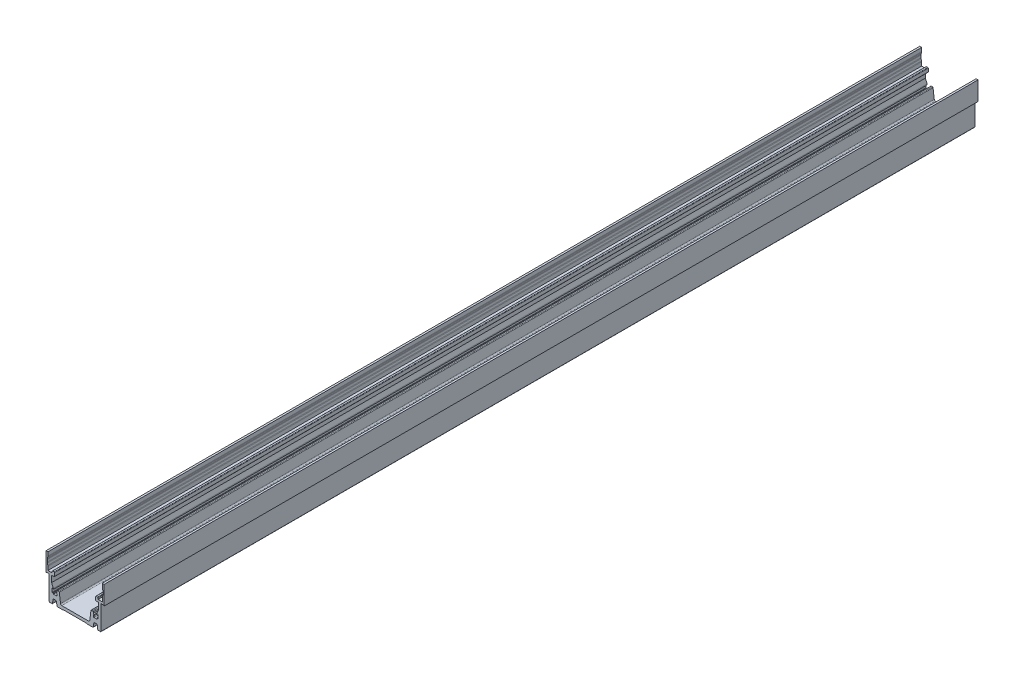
ISO-10303-21;
HEADER;
FILE_DESCRIPTION(('STEP AP214'),'2;1');
FILE_NAME('part.step','',(''),(''),'','','');
FILE_SCHEMA(('AUTOMOTIVE_DESIGN { 1 0 10303 214 1 1 1 1 }'));
ENDSEC;
DATA;
#1=APPLICATION_CONTEXT('core data for automotive mechanical design processes');
#2=APPLICATION_PROTOCOL_DEFINITION('international standard','automotive_design',2000,#1);
#3=PRODUCT_CONTEXT('',#1,'mechanical');
#4=PRODUCT('Part','Part','',(#3));
#5=PRODUCT_RELATED_PRODUCT_CATEGORY('part','',(#4));
#6=PRODUCT_DEFINITION_FORMATION('','',#4);
#7=PRODUCT_DEFINITION_CONTEXT('part definition',#1,'design');
#8=PRODUCT_DEFINITION('design','',#6,#7);
#9=PRODUCT_DEFINITION_SHAPE('','',#8);
#10=(LENGTH_UNIT() NAMED_UNIT(*) SI_UNIT(.MILLI.,.METRE.));
#11=(NAMED_UNIT(*) PLANE_ANGLE_UNIT() SI_UNIT($,.RADIAN.));
#12=(NAMED_UNIT(*) SI_UNIT($,.STERADIAN.) SOLID_ANGLE_UNIT());
#13=UNCERTAINTY_MEASURE_WITH_UNIT(LENGTH_MEASURE(1.E-05),#10,'distance_accuracy_value','');
#14=(GEOMETRIC_REPRESENTATION_CONTEXT(3) GLOBAL_UNCERTAINTY_ASSIGNED_CONTEXT((#13)) GLOBAL_UNIT_ASSIGNED_CONTEXT((#10,
#11,#12)) REPRESENTATION_CONTEXT('',''));
#15=CARTESIAN_POINT('',(0.,0.,0.));
#16=DIRECTION('',(0.,0.,1.));
#17=DIRECTION('',(1.,0.,0.));
#18=AXIS2_PLACEMENT_3D('',#15,#16,#17);
#19=CARTESIAN_POINT('',(-18.,26.302,270.));
#20=DIRECTION('',(1.,0.,0.));
#21=DIRECTION('',(0.,0.,-1.));
#22=AXIS2_PLACEMENT_3D('',#19,#20,#21);
#23=PLANE('',#22);
#24=DIRECTION('',(0.,-1.,0.));
#25=VECTOR('',#24,1.);
#26=CARTESIAN_POINT('',(-18.,26.302,0.));
#27=LINE('',#26,#25);
#28=CARTESIAN_POINT('',(-18.,26.302,0.));
#29=VERTEX_POINT('',#28);
#30=CARTESIAN_POINT('',(-18.,14.6986296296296,0.));
#31=VERTEX_POINT('',#30);
#32=EDGE_CURVE('E688',#29,#31,#27,.T.);
#33=ORIENTED_EDGE('',*,*,#32,.T.);
#34=DIRECTION('',(0.,0.,-1.));
#35=VECTOR('',#34,1.);
#36=CARTESIAN_POINT('',(-18.,14.6986296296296,270.));
#37=LINE('',#36,#35);
#38=CARTESIAN_POINT('',(-18.,14.6986296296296,540.));
#39=VERTEX_POINT('',#38);
#40=EDGE_CURVE('E9',#39,#31,#37,.T.);
#41=ORIENTED_EDGE('',*,*,#40,.F.);
#42=DIRECTION('',(0.,1.,0.));
#43=VECTOR('',#42,1.);
#44=CARTESIAN_POINT('',(-18.,14.6986296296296,540.));
#45=LINE('',#44,#43);
#46=CARTESIAN_POINT('',(-18.,26.302,540.));
#47=VERTEX_POINT('',#46);
#48=EDGE_CURVE('E686',#39,#47,#45,.T.);
#49=ORIENTED_EDGE('',*,*,#48,.T.);
#50=DIRECTION('',(0.,0.,-1.));
#51=VECTOR('',#50,1.);
#52=CARTESIAN_POINT('',(-18.,26.302,270.));
#53=LINE('',#52,#51);
#54=EDGE_CURVE('E1281',#47,#29,#53,.T.);
#55=ORIENTED_EDGE('',*,*,#54,.T.);
#56=EDGE_LOOP('',(#33,#41,#49,#55));
#57=FACE_BOUND('',#56,.T.);
#58=ADVANCED_FACE('F14',(#57),#23,.F.);
#59=CARTESIAN_POINT('',(-18.,14.6986296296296,270.));
#60=DIRECTION('',(-0.287144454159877,0.957887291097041,0.));
#61=DIRECTION('',(-0.957887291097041,-0.287144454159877,0.));
#62=AXIS2_PLACEMENT_3D('',#59,#60,#61);
#63=PLANE('',#62);
#64=DIRECTION('',(0.957887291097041,0.287144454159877,0.));
#65=VECTOR('',#64,1.);
#66=CARTESIAN_POINT('',(-18.,14.6986296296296,0.));
#67=LINE('',#66,#65);
#68=CARTESIAN_POINT('',(-17.008,14.996,0.));
#69=VERTEX_POINT('',#68);
#70=EDGE_CURVE('E1025',#31,#69,#67,.T.);
#71=ORIENTED_EDGE('',*,*,#70,.T.);
#72=DIRECTION('',(0.,0.,-1.));
#73=VECTOR('',#72,1.);
#74=CARTESIAN_POINT('',(-17.008,14.996,270.));
#75=LINE('',#74,#73);
#76=CARTESIAN_POINT('',(-17.008,14.996,540.));
#77=VERTEX_POINT('',#76);
#78=EDGE_CURVE('E21',#77,#69,#75,.T.);
#79=ORIENTED_EDGE('',*,*,#78,.F.);
#80=DIRECTION('',(-0.957887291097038,-0.287144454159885,0.));
#81=VECTOR('',#80,1.);
#82=CARTESIAN_POINT('',(-17.008,14.996,540.));
#83=LINE('',#82,#81);
#84=EDGE_CURVE('E696',#77,#39,#83,.T.);
#85=ORIENTED_EDGE('',*,*,#84,.T.);
#86=ORIENTED_EDGE('',*,*,#40,.T.);
#87=EDGE_LOOP('',(#71,#79,#85,#86));
#88=FACE_BOUND('',#87,.T.);
#89=ADVANCED_FACE('F702',(#88),#63,.F.);
#90=CARTESIAN_POINT('',(-17.008,14.996,270.));
#91=DIRECTION('',(0.,1.,0.));
#92=DIRECTION('',(0.,0.,1.));
#93=AXIS2_PLACEMENT_3D('',#90,#91,#92);
#94=PLANE('',#93);
#95=DIRECTION('',(1.,0.,0.));
#96=VECTOR('',#95,1.);
#97=CARTESIAN_POINT('',(-17.008,14.996,0.));
#98=LINE('',#97,#96);
#99=CARTESIAN_POINT('',(-16.,14.996,0.));
#100=VERTEX_POINT('',#99);
#101=EDGE_CURVE('E1027',#69,#100,#98,.T.);
#102=ORIENTED_EDGE('',*,*,#101,.T.);
#103=DIRECTION('',(0.,0.,-1.));
#104=VECTOR('',#103,1.);
#105=CARTESIAN_POINT('',(-16.,14.996,270.));
#106=LINE('',#105,#104);
#107=CARTESIAN_POINT('',(-16.,14.996,540.));
#108=VERTEX_POINT('',#107);
#109=EDGE_CURVE('E1554',#108,#100,#106,.T.);
#110=ORIENTED_EDGE('',*,*,#109,.F.);
#111=DIRECTION('',(-1.,0.,0.));
#112=VECTOR('',#111,1.);
#113=CARTESIAN_POINT('',(-16.,14.996,540.));
#114=LINE('',#113,#112);
#115=EDGE_CURVE('E1022',#108,#77,#114,.T.);
#116=ORIENTED_EDGE('',*,*,#115,.T.);
#117=ORIENTED_EDGE('',*,*,#78,.T.);
#118=EDGE_LOOP('',(#102,#110,#116,#117));
#119=FACE_BOUND('',#118,.T.);
#120=ADVANCED_FACE('F1558',(#119),#94,.F.);
#121=CARTESIAN_POINT('',(-16.,14.996,270.));
#122=DIRECTION('',(1.,0.,0.));
#123=DIRECTION('',(0.,0.,-1.));
#124=AXIS2_PLACEMENT_3D('',#121,#122,#123);
#125=PLANE('',#124);
#126=DIRECTION('',(0.,-1.,0.));
#127=VECTOR('',#126,1.);
#128=CARTESIAN_POINT('',(-16.,14.996,0.));
#129=LINE('',#128,#127);
#130=CARTESIAN_POINT('',(-16.,0.0999999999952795,0.));
#131=VERTEX_POINT('',#130);
#132=EDGE_CURVE('E1029',#100,#131,#129,.T.);
#133=ORIENTED_EDGE('',*,*,#132,.T.);
#134=DIRECTION('',(0.,0.,-1.));
#135=VECTOR('',#134,1.);
#136=CARTESIAN_POINT('',(-16.,0.0999999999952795,270.));
#137=LINE('',#136,#135);
#138=CARTESIAN_POINT('',(-16.,0.0999999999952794,540.));
#139=VERTEX_POINT('',#138);
#140=EDGE_CURVE('E1551',#139,#131,#137,.T.);
#141=ORIENTED_EDGE('',*,*,#140,.F.);
#142=DIRECTION('',(0.,1.,0.));
#143=VECTOR('',#142,1.);
#144=CARTESIAN_POINT('',(-16.,0.0999999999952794,540.));
#145=LINE('',#144,#143);
#146=EDGE_CURVE('E1019',#139,#108,#145,.T.);
#147=ORIENTED_EDGE('',*,*,#146,.T.);
#148=ORIENTED_EDGE('',*,*,#109,.T.);
#149=EDGE_LOOP('',(#133,#141,#147,#148));
#150=FACE_BOUND('',#149,.T.);
#151=ADVANCED_FACE('F1565',(#150),#125,.F.);
#152=CARTESIAN_POINT('',(-15.702,0.0999999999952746,270.));
#153=DIRECTION('',(0.,0.,-1.));
#154=DIRECTION('',(-1.,0.,0.));
#155=AXIS2_PLACEMENT_3D('',#152,#153,#154);
#156=CYLINDRICAL_SURFACE('',#155,0.298);
#157=CARTESIAN_POINT('',(-15.702,0.0999999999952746,0.));
#158=DIRECTION('',(0.,0.,1.));
#159=DIRECTION('',(1.,0.,0.));
#160=AXIS2_PLACEMENT_3D('',#157,#158,#159);
#161=CIRCLE('',#160,0.298);
#162=CARTESIAN_POINT('',(-15.7020016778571,-0.198,0.));
#163=VERTEX_POINT('',#162);
#164=EDGE_CURVE('E1031',#131,#163,#161,.T.);
#165=ORIENTED_EDGE('',*,*,#164,.T.);
#166=DIRECTION('',(0.,0.,-1.));
#167=VECTOR('',#166,1.);
#168=CARTESIAN_POINT('',(-15.7020016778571,-0.198,270.));
#169=LINE('',#168,#167);
#170=CARTESIAN_POINT('',(-15.7020016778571,-0.198,540.));
#171=VERTEX_POINT('',#170);
#172=EDGE_CURVE('E1548',#171,#163,#169,.T.);
#173=ORIENTED_EDGE('',*,*,#172,.F.);
#174=CARTESIAN_POINT('',(-15.702,0.0999999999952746,540.));
#175=DIRECTION('',(0.,0.,-1.));
#176=DIRECTION('',(-1.,0.,0.));
#177=AXIS2_PLACEMENT_3D('',#174,#175,#176);
#178=CIRCLE('',#177,0.298);
#179=EDGE_CURVE('E1016',#171,#139,#178,.T.);
#180=ORIENTED_EDGE('',*,*,#179,.T.);
#181=ORIENTED_EDGE('',*,*,#140,.T.);
#182=EDGE_LOOP('',(#165,#173,#180,#181));
#183=FACE_BOUND('',#182,.T.);
#184=ADVANCED_FACE('F1568',(#183),#156,.T.);
#185=CARTESIAN_POINT('',(-15.7020016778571,-0.198,270.));
#186=DIRECTION('',(0.,1.,0.));
#187=DIRECTION('',(0.,0.,1.));
#188=AXIS2_PLACEMENT_3D('',#185,#186,#187);
#189=PLANE('',#188);
#190=DIRECTION('',(1.,0.,0.));
#191=VECTOR('',#190,1.);
#192=CARTESIAN_POINT('',(-15.7020016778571,-0.198,0.));
#193=LINE('',#192,#191);
#194=CARTESIAN_POINT('',(-14.2773032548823,-0.198,0.));
#195=VERTEX_POINT('',#194);
#196=EDGE_CURVE('E1033',#163,#195,#193,.T.);
#197=ORIENTED_EDGE('',*,*,#196,.T.);
#198=DIRECTION('',(0.,0.,-1.));
#199=VECTOR('',#198,1.);
#200=CARTESIAN_POINT('',(-14.2773032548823,-0.198,270.));
#201=LINE('',#200,#199);
#202=CARTESIAN_POINT('',(-14.2773032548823,-0.197999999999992,540.));
#203=VERTEX_POINT('',#202);
#204=EDGE_CURVE('E1545',#203,#195,#201,.T.);
#205=ORIENTED_EDGE('',*,*,#204,.F.);
#206=DIRECTION('',(-1.,0.,0.));
#207=VECTOR('',#206,1.);
#208=CARTESIAN_POINT('',(-14.2773032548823,-0.197999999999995,540.));
#209=LINE('',#208,#207);
#210=EDGE_CURVE('E1013',#203,#171,#209,.T.);
#211=ORIENTED_EDGE('',*,*,#210,.T.);
#212=ORIENTED_EDGE('',*,*,#172,.T.);
#213=EDGE_LOOP('',(#197,#205,#211,#212));
#214=FACE_BOUND('',#213,.T.);
#215=ADVANCED_FACE('F1573',(#214),#189,.F.);
#216=CARTESIAN_POINT('',(-14.2773038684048,0.0999999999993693,270.));
#217=DIRECTION('',(0.,0.,-1.));
#218=DIRECTION('',(-1.,0.,0.));
#219=AXIS2_PLACEMENT_3D('',#216,#217,#218);
#220=CYLINDRICAL_SURFACE('',#219,0.298);
#221=CARTESIAN_POINT('',(-14.2773038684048,0.0999999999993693,0.));
#222=DIRECTION('',(0.,0.,1.));
#223=DIRECTION('',(1.,0.,0.));
#224=AXIS2_PLACEMENT_3D('',#221,#222,#223);
#225=CIRCLE('',#224,0.298);
#226=CARTESIAN_POINT('',(-13.9819190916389,0.0606066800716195,0.));
#227=VERTEX_POINT('',#226);
#228=EDGE_CURVE('E1035',#195,#227,#225,.T.);
#229=ORIENTED_EDGE('',*,*,#228,.T.);
#230=DIRECTION('',(0.,0.,-1.));
#231=VECTOR('',#230,1.);
#232=CARTESIAN_POINT('',(-13.9819190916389,0.0606066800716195,270.));
#233=LINE('',#232,#231);
#234=CARTESIAN_POINT('',(-13.9819190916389,0.0606066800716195,540.));
#235=VERTEX_POINT('',#234);
#236=EDGE_CURVE('E1542',#235,#227,#233,.T.);
#237=ORIENTED_EDGE('',*,*,#236,.F.);
#238=CARTESIAN_POINT('',(-14.2773038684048,0.0999999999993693,540.));
#239=DIRECTION('',(0.,0.,-1.));
#240=DIRECTION('',(-1.,0.,0.));
#241=AXIS2_PLACEMENT_3D('',#238,#239,#240);
#242=CIRCLE('',#241,0.297999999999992);
#243=EDGE_CURVE('E1010',#235,#203,#242,.T.);
#244=ORIENTED_EDGE('',*,*,#243,.T.);
#245=ORIENTED_EDGE('',*,*,#204,.T.);
#246=EDGE_LOOP('',(#229,#237,#244,#245));
#247=FACE_BOUND('',#246,.T.);
#248=ADVANCED_FACE('F1576',(#247),#220,.T.);
#249=CARTESIAN_POINT('',(-13.9819190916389,0.0606066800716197,270.));
#250=DIRECTION('',(-0.991224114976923,0.132192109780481,0.));
#251=DIRECTION('',(-0.132192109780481,-0.991224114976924,0.));
#252=AXIS2_PLACEMENT_3D('',#249,#250,#251);
#253=PLANE('',#252);
#254=DIRECTION('',(0.132192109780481,0.991224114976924,0.));
#255=VECTOR('',#254,1.);
#256=CARTESIAN_POINT('',(-13.9819190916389,0.0606066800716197,0.));
#257=LINE('',#256,#255);
#258=CARTESIAN_POINT('',(-13.6770576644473,2.34656761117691,0.));
#259=VERTEX_POINT('',#258);
#260=EDGE_CURVE('E1037',#227,#259,#257,.T.);
#261=ORIENTED_EDGE('',*,*,#260,.T.);
#262=DIRECTION('',(0.,0.,-1.));
#263=VECTOR('',#262,1.);
#264=CARTESIAN_POINT('',(-13.6770576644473,2.34656761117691,270.));
#265=LINE('',#264,#263);
#266=CARTESIAN_POINT('',(-13.6770576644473,2.34656761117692,540.));
#267=VERTEX_POINT('',#266);
#268=EDGE_CURVE('E1540',#267,#259,#265,.T.);
#269=ORIENTED_EDGE('',*,*,#268,.F.);
#270=DIRECTION('',(-0.132192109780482,-0.991224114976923,0.));
#271=VECTOR('',#270,1.);
#272=CARTESIAN_POINT('',(-13.6770576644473,2.34656761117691,540.));
#273=LINE('',#272,#271);
#274=EDGE_CURVE('E1007',#267,#235,#273,.T.);
#275=ORIENTED_EDGE('',*,*,#274,.T.);
#276=ORIENTED_EDGE('',*,*,#236,.T.);
#277=EDGE_LOOP('',(#261,#269,#275,#276));
#278=FACE_BOUND('',#277,.T.);
#279=ADVANCED_FACE('F1581',(#278),#253,.F.);
#280=CARTESIAN_POINT('',(-13.1854105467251,2.281,270.));
#281=DIRECTION('',(0.,0.,-1.));
#282=DIRECTION('',(-1.,0.,0.));
#283=AXIS2_PLACEMENT_3D('',#280,#281,#282);
#284=CYLINDRICAL_SURFACE('',#283,0.496);
#285=CARTESIAN_POINT('',(-13.1854105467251,2.281,0.));
#286=DIRECTION('',(0.,0.,1.));
#287=DIRECTION('',(1.,0.,0.));
#288=AXIS2_PLACEMENT_3D('',#285,#286,#287);
#289=CIRCLE('',#288,0.496);
#290=CARTESIAN_POINT('',(-13.1854106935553,2.777,0.));
#291=VERTEX_POINT('',#290);
#292=EDGE_CURVE('E1040',#291,#259,#289,.T.);
#293=ORIENTED_EDGE('',*,*,#292,.F.);
#294=DIRECTION('',(0.,0.,-1.));
#295=VECTOR('',#294,1.);
#296=CARTESIAN_POINT('',(-13.1854106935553,2.777,270.));
#297=LINE('',#296,#295);
#298=CARTESIAN_POINT('',(-13.1854106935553,2.777,540.));
#299=VERTEX_POINT('',#298);
#300=EDGE_CURVE('E1538',#299,#291,#297,.T.);
#301=ORIENTED_EDGE('',*,*,#300,.F.);
#302=CARTESIAN_POINT('',(-13.1854105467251,2.281,540.));
#303=DIRECTION('',(0.,0.,1.));
#304=DIRECTION('',(-1.,0.,0.));
#305=AXIS2_PLACEMENT_3D('',#302,#303,#304);
#306=CIRCLE('',#305,0.496000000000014);
#307=EDGE_CURVE('E1004',#299,#267,#306,.T.);
#308=ORIENTED_EDGE('',*,*,#307,.T.);
#309=ORIENTED_EDGE('',*,*,#268,.T.);
#310=EDGE_LOOP('',(#293,#301,#308,#309));
#311=FACE_BOUND('',#310,.T.);
#312=ADVANCED_FACE('F1586',(#311),#284,.F.);
#313=CARTESIAN_POINT('',(-13.1854106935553,2.777,270.));
#314=DIRECTION('',(0.,1.,0.));
#315=DIRECTION('',(0.,0.,1.));
#316=AXIS2_PLACEMENT_3D('',#313,#314,#315);
#317=PLANE('',#316);
#318=DIRECTION('',(1.,0.,0.));
#319=VECTOR('',#318,1.);
#320=CARTESIAN_POINT('',(-13.1854106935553,2.777,0.));
#321=LINE('',#320,#319);
#322=CARTESIAN_POINT('',(-12.0205892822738,2.777,0.));
#323=VERTEX_POINT('',#322);
#324=EDGE_CURVE('E1043',#291,#323,#321,.T.);
#325=ORIENTED_EDGE('',*,*,#324,.T.);
#326=DIRECTION('',(0.,0.,-1.));
#327=VECTOR('',#326,1.);
#328=CARTESIAN_POINT('',(-12.0205892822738,2.777,270.));
#329=LINE('',#328,#327);
#330=CARTESIAN_POINT('',(-12.0205892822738,2.777,540.));
#331=VERTEX_POINT('',#330);
#332=EDGE_CURVE('E1536',#331,#323,#329,.T.);
#333=ORIENTED_EDGE('',*,*,#332,.F.);
#334=DIRECTION('',(-1.,0.,0.));
#335=VECTOR('',#334,1.);
#336=CARTESIAN_POINT('',(-12.0205892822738,2.777,540.));
#337=LINE('',#336,#335);
#338=EDGE_CURVE('E1001',#331,#299,#337,.T.);
#339=ORIENTED_EDGE('',*,*,#338,.T.);
#340=ORIENTED_EDGE('',*,*,#300,.T.);
#341=EDGE_LOOP('',(#325,#333,#339,#340));
#342=FACE_BOUND('',#341,.T.);
#343=ADVANCED_FACE('F1588',(#342),#317,.F.);
#344=CARTESIAN_POINT('',(-12.0205895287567,2.28100000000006,270.));
#345=DIRECTION('',(0.,0.,-1.));
#346=DIRECTION('',(-1.,0.,0.));
#347=AXIS2_PLACEMENT_3D('',#344,#345,#346);
#348=CYLINDRICAL_SURFACE('',#347,0.496);
#349=CARTESIAN_POINT('',(-12.0205895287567,2.28100000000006,0.));
#350=DIRECTION('',(0.,0.,1.));
#351=DIRECTION('',(1.,0.,0.));
#352=AXIS2_PLACEMENT_3D('',#349,#350,#351);
#353=CIRCLE('',#352,0.496);
#354=CARTESIAN_POINT('',(-11.5289320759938,2.34649006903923,0.));
#355=VERTEX_POINT('',#354);
#356=EDGE_CURVE('E1046',#355,#323,#353,.T.);
#357=ORIENTED_EDGE('',*,*,#356,.F.);
#358=DIRECTION('',(0.,0.,-1.));
#359=VECTOR('',#358,1.);
#360=CARTESIAN_POINT('',(-11.5289320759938,2.34649006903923,270.));
#361=LINE('',#360,#359);
#362=CARTESIAN_POINT('',(-11.5289320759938,2.34649006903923,540.));
#363=VERTEX_POINT('',#362);
#364=EDGE_CURVE('E1534',#363,#355,#361,.T.);
#365=ORIENTED_EDGE('',*,*,#364,.F.);
#366=CARTESIAN_POINT('',(-12.0205895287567,2.28100000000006,540.));
#367=DIRECTION('',(0.,0.,1.));
#368=DIRECTION('',(-1.,0.,0.));
#369=AXIS2_PLACEMENT_3D('',#366,#367,#368);
#370=CIRCLE('',#369,0.496);
#371=EDGE_CURVE('E998',#363,#331,#370,.T.);
#372=ORIENTED_EDGE('',*,*,#371,.T.);
#373=ORIENTED_EDGE('',*,*,#332,.T.);
#374=EDGE_LOOP('',(#357,#365,#372,#373));
#375=FACE_BOUND('',#374,.T.);
#376=ADVANCED_FACE('F1593',(#375),#348,.F.);
#377=CARTESIAN_POINT('',(-11.5289320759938,2.34649006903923,270.));
#378=DIRECTION('',(0.991244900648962,0.132036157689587,0.));
#379=DIRECTION('',(-0.132036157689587,0.991244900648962,0.));
#380=AXIS2_PLACEMENT_3D('',#377,#378,#379);
#381=PLANE('',#380);
#382=DIRECTION('',(0.132036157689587,-0.991244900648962,0.));
#383=VECTOR('',#382,1.);
#384=CARTESIAN_POINT('',(-11.5289320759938,2.34649006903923,0.));
#385=LINE('',#384,#383);
#386=CARTESIAN_POINT('',(-11.19,-0.198,0.));
#387=VERTEX_POINT('',#386);
#388=EDGE_CURVE('E1049',#355,#387,#385,.T.);
#389=ORIENTED_EDGE('',*,*,#388,.T.);
#390=DIRECTION('',(0.,0.,-1.));
#391=VECTOR('',#390,1.);
#392=CARTESIAN_POINT('',(-11.19,-0.198,270.));
#393=LINE('',#392,#391);
#394=CARTESIAN_POINT('',(-11.19,-0.198,540.));
#395=VERTEX_POINT('',#394);
#396=EDGE_CURVE('E1531',#395,#387,#393,.T.);
#397=ORIENTED_EDGE('',*,*,#396,.F.);
#398=DIRECTION('',(-0.13203615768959,0.991244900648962,0.));
#399=VECTOR('',#398,1.);
#400=CARTESIAN_POINT('',(-11.19,-0.198,540.));
#401=LINE('',#400,#399);
#402=EDGE_CURVE('E995',#395,#363,#401,.T.);
#403=ORIENTED_EDGE('',*,*,#402,.T.);
#404=ORIENTED_EDGE('',*,*,#364,.T.);
#405=EDGE_LOOP('',(#389,#397,#403,#404));
#406=FACE_BOUND('',#405,.T.);
#407=ADVANCED_FACE('F1598',(#406),#381,.F.);
#408=CARTESIAN_POINT('',(-11.19,-0.198,270.));
#409=DIRECTION('',(0.,1.,0.));
#410=DIRECTION('',(-1.,0.,0.));
#411=AXIS2_PLACEMENT_3D('',#408,#409,#410);
#412=PLANE('',#411);
#413=DIRECTION('',(1.,0.,0.));
#414=VECTOR('',#413,1.);
#415=CARTESIAN_POINT('',(-11.19,-0.198,0.));
#416=LINE('',#415,#414);
#417=CARTESIAN_POINT('',(-7.663,-0.198,0.));
#418=VERTEX_POINT('',#417);
#419=EDGE_CURVE('E1051',#387,#418,#416,.T.);
#420=ORIENTED_EDGE('',*,*,#419,.T.);
#421=DIRECTION('',(0.,0.,-1.));
#422=VECTOR('',#421,1.);
#423=CARTESIAN_POINT('',(-7.663,-0.198,270.));
#424=LINE('',#423,#422);
#425=CARTESIAN_POINT('',(-7.663,-0.198,540.));
#426=VERTEX_POINT('',#425);
#427=EDGE_CURVE('E1529',#426,#418,#424,.T.);
#428=ORIENTED_EDGE('',*,*,#427,.F.);
#429=DIRECTION('',(-1.,0.,0.));
#430=VECTOR('',#429,1.);
#431=CARTESIAN_POINT('',(-7.663,-0.198,540.));
#432=LINE('',#431,#430);
#433=EDGE_CURVE('E992',#426,#395,#432,.T.);
#434=ORIENTED_EDGE('',*,*,#433,.T.);
#435=ORIENTED_EDGE('',*,*,#396,.T.);
#436=EDGE_LOOP('',(#420,#428,#434,#435));
#437=FACE_BOUND('',#436,.T.);
#438=ADVANCED_FACE('F1600',(#437),#412,.F.);
#439=CARTESIAN_POINT('',(-7.14898437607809,-0.752368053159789,270.));
#440=DIRECTION('',(0.,0.,-1.));
#441=DIRECTION('',(-1.,0.,0.));
#442=AXIS2_PLACEMENT_3D('',#439,#440,#441);
#443=CYLINDRICAL_SURFACE('',#442,0.756);
#444=CARTESIAN_POINT('',(-7.14898437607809,-0.752368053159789,0.));
#445=DIRECTION('',(0.,0.,1.));
#446=DIRECTION('',(1.,0.,0.));
#447=AXIS2_PLACEMENT_3D('',#444,#445,#446);
#448=CIRCLE('',#447,0.756);
#449=CARTESIAN_POINT('',(-7.223,0.,0.));
#450=VERTEX_POINT('',#449);
#451=EDGE_CURVE('E1054',#450,#418,#448,.T.);
#452=ORIENTED_EDGE('',*,*,#451,.F.);
#453=DIRECTION('',(0.,0.,-1.));
#454=VECTOR('',#453,1.);
#455=CARTESIAN_POINT('',(-7.223,0.,270.));
#456=LINE('',#455,#454);
#457=CARTESIAN_POINT('',(-7.223,0.,540.));
#458=VERTEX_POINT('',#457);
#459=EDGE_CURVE('E1527',#458,#450,#456,.T.);
#460=ORIENTED_EDGE('',*,*,#459,.F.);
#461=CARTESIAN_POINT('',(-7.14898437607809,-0.752368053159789,540.));
#462=DIRECTION('',(0.,0.,1.));
#463=DIRECTION('',(-1.,0.,0.));
#464=AXIS2_PLACEMENT_3D('',#461,#462,#463);
#465=CIRCLE('',#464,0.756);
#466=EDGE_CURVE('E989',#458,#426,#465,.T.);
#467=ORIENTED_EDGE('',*,*,#466,.T.);
#468=ORIENTED_EDGE('',*,*,#427,.T.);
#469=EDGE_LOOP('',(#452,#460,#467,#468));
#470=FACE_BOUND('',#469,.T.);
#471=ADVANCED_FACE('F1604',(#470),#443,.F.);
#472=CARTESIAN_POINT('',(-7.223,0.,270.));
#473=DIRECTION('',(0.,1.,0.));
#474=DIRECTION('',(0.,0.,1.));
#475=AXIS2_PLACEMENT_3D('',#472,#473,#474);
#476=PLANE('',#475);
#477=DIRECTION('',(1.,0.,0.));
#478=VECTOR('',#477,1.);
#479=CARTESIAN_POINT('',(-7.223,0.,0.));
#480=LINE('',#479,#478);
#481=CARTESIAN_POINT('',(7.223,0.,0.));
#482=VERTEX_POINT('',#481);
#483=EDGE_CURVE('E1057',#450,#482,#480,.T.);
#484=ORIENTED_EDGE('',*,*,#483,.T.);
#485=DIRECTION('',(0.,0.,-1.));
#486=VECTOR('',#485,1.);
#487=CARTESIAN_POINT('',(7.223,0.,270.));
#488=LINE('',#487,#486);
#489=CARTESIAN_POINT('',(7.223,0.,540.));
#490=VERTEX_POINT('',#489);
#491=EDGE_CURVE('E1525',#490,#482,#488,.T.);
#492=ORIENTED_EDGE('',*,*,#491,.F.);
#493=DIRECTION('',(-1.,0.,0.));
#494=VECTOR('',#493,1.);
#495=CARTESIAN_POINT('',(7.223,0.,540.));
#496=LINE('',#495,#494);
#497=EDGE_CURVE('E986',#490,#458,#496,.T.);
#498=ORIENTED_EDGE('',*,*,#497,.T.);
#499=ORIENTED_EDGE('',*,*,#459,.T.);
#500=EDGE_LOOP('',(#484,#492,#498,#499));
#501=FACE_BOUND('',#500,.T.);
#502=ADVANCED_FACE('F1609',(#501),#476,.F.);
#503=CARTESIAN_POINT('',(7.14898437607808,-0.752368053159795,270.));
#504=DIRECTION('',(0.,0.,-1.));
#505=DIRECTION('',(-1.,0.,0.));
#506=AXIS2_PLACEMENT_3D('',#503,#504,#505);
#507=CYLINDRICAL_SURFACE('',#506,0.756);
#508=CARTESIAN_POINT('',(7.14898437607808,-0.752368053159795,0.));
#509=DIRECTION('',(0.,0.,1.));
#510=DIRECTION('',(1.,0.,0.));
#511=AXIS2_PLACEMENT_3D('',#508,#509,#510);
#512=CIRCLE('',#511,0.756);
#513=CARTESIAN_POINT('',(7.663,-0.198,0.));
#514=VERTEX_POINT('',#513);
#515=EDGE_CURVE('E1060',#514,#482,#512,.T.);
#516=ORIENTED_EDGE('',*,*,#515,.F.);
#517=DIRECTION('',(0.,0.,-1.));
#518=VECTOR('',#517,1.);
#519=CARTESIAN_POINT('',(7.663,-0.198,270.));
#520=LINE('',#519,#518);
#521=CARTESIAN_POINT('',(7.663,-0.198,540.));
#522=VERTEX_POINT('',#521);
#523=EDGE_CURVE('E1523',#522,#514,#520,.T.);
#524=ORIENTED_EDGE('',*,*,#523,.F.);
#525=CARTESIAN_POINT('',(7.14898437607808,-0.752368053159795,540.));
#526=DIRECTION('',(0.,0.,1.));
#527=DIRECTION('',(-1.,0.,0.));
#528=AXIS2_PLACEMENT_3D('',#525,#526,#527);
#529=CIRCLE('',#528,0.756000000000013);
#530=EDGE_CURVE('E983',#522,#490,#529,.T.);
#531=ORIENTED_EDGE('',*,*,#530,.T.);
#532=ORIENTED_EDGE('',*,*,#491,.T.);
#533=EDGE_LOOP('',(#516,#524,#531,#532));
#534=FACE_BOUND('',#533,.T.);
#535=ADVANCED_FACE('F1612',(#534),#507,.F.);
#536=CARTESIAN_POINT('',(7.663,-0.198,270.));
#537=DIRECTION('',(0.,1.,0.));
#538=DIRECTION('',(-1.,0.,0.));
#539=AXIS2_PLACEMENT_3D('',#536,#537,#538);
#540=PLANE('',#539);
#541=DIRECTION('',(1.,0.,0.));
#542=VECTOR('',#541,1.);
#543=CARTESIAN_POINT('',(7.663,-0.198,0.));
#544=LINE('',#543,#542);
#545=CARTESIAN_POINT('',(10.93,-0.198,0.));
#546=VERTEX_POINT('',#545);
#547=EDGE_CURVE('E1063',#514,#546,#544,.T.);
#548=ORIENTED_EDGE('',*,*,#547,.T.);
#549=DIRECTION('',(0.,0.,-1.));
#550=VECTOR('',#549,1.);
#551=CARTESIAN_POINT('',(10.93,-0.198,270.));
#552=LINE('',#551,#550);
#553=CARTESIAN_POINT('',(10.93,-0.197999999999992,540.));
#554=VERTEX_POINT('',#553);
#555=EDGE_CURVE('E1520',#554,#546,#552,.T.);
#556=ORIENTED_EDGE('',*,*,#555,.F.);
#557=DIRECTION('',(-1.,0.,0.));
#558=VECTOR('',#557,1.);
#559=CARTESIAN_POINT('',(10.93,-0.197999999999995,540.));
#560=LINE('',#559,#558);
#561=EDGE_CURVE('E980',#554,#522,#560,.T.);
#562=ORIENTED_EDGE('',*,*,#561,.T.);
#563=ORIENTED_EDGE('',*,*,#523,.T.);
#564=EDGE_LOOP('',(#548,#556,#562,#563));
#565=FACE_BOUND('',#564,.T.);
#566=ADVANCED_FACE('F1616',(#565),#540,.F.);
#567=CARTESIAN_POINT('',(10.9286957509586,0.0999971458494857,270.));
#568=DIRECTION('',(0.,0.,-1.));
#569=DIRECTION('',(-1.,0.,0.));
#570=AXIS2_PLACEMENT_3D('',#567,#568,#569);
#571=CYLINDRICAL_SURFACE('',#570,0.298);
#572=CARTESIAN_POINT('',(10.9286957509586,0.0999971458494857,0.));
#573=DIRECTION('',(0.,0.,1.));
#574=DIRECTION('',(1.,0.,0.));
#575=AXIS2_PLACEMENT_3D('',#572,#573,#574);
#576=CIRCLE('',#575,0.298);
#577=CARTESIAN_POINT('',(11.2240805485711,0.0606039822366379,0.));
#578=VERTEX_POINT('',#577);
#579=EDGE_CURVE('E1065',#546,#578,#576,.T.);
#580=ORIENTED_EDGE('',*,*,#579,.T.);
#581=DIRECTION('',(0.,0.,-1.));
#582=VECTOR('',#581,1.);
#583=CARTESIAN_POINT('',(11.2240805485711,0.0606039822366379,270.));
#584=LINE('',#583,#582);
#585=CARTESIAN_POINT('',(11.2240805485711,0.0606039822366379,540.));
#586=VERTEX_POINT('',#585);
#587=EDGE_CURVE('E1517',#586,#578,#584,.T.);
#588=ORIENTED_EDGE('',*,*,#587,.F.);
#589=CARTESIAN_POINT('',(10.9286957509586,0.0999971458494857,540.));
#590=DIRECTION('',(0.,0.,-1.));
#591=DIRECTION('',(-1.,0.,0.));
#592=AXIS2_PLACEMENT_3D('',#589,#590,#591);
#593=CIRCLE('',#592,0.297999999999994);
#594=EDGE_CURVE('E977',#586,#554,#593,.T.);
#595=ORIENTED_EDGE('',*,*,#594,.T.);
#596=ORIENTED_EDGE('',*,*,#555,.T.);
#597=EDGE_LOOP('',(#580,#588,#595,#596));
#598=FACE_BOUND('',#597,.T.);
#599=ADVANCED_FACE('F1620',(#598),#571,.T.);
#600=CARTESIAN_POINT('',(11.2240805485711,0.0606039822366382,270.));
#601=DIRECTION('',(-0.991224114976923,0.132192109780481,0.));
#602=DIRECTION('',(-0.132192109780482,-0.991224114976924,0.));
#603=AXIS2_PLACEMENT_3D('',#600,#601,#602);
#604=PLANE('',#603);
#605=DIRECTION('',(0.132192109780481,0.991224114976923,0.));
#606=VECTOR('',#605,1.);
#607=CARTESIAN_POINT('',(11.2240805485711,0.0606039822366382,0.));
#608=LINE('',#607,#606);
#609=CARTESIAN_POINT('',(11.5289423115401,2.3465674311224,0.));
#610=VERTEX_POINT('',#609);
#611=EDGE_CURVE('E1067',#578,#610,#608,.T.);
#612=ORIENTED_EDGE('',*,*,#611,.T.);
#613=DIRECTION('',(0.,0.,-1.));
#614=VECTOR('',#613,1.);
#615=CARTESIAN_POINT('',(11.5289423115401,2.3465674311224,270.));
#616=LINE('',#615,#614);
#617=CARTESIAN_POINT('',(11.5289423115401,2.3465674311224,540.));
#618=VERTEX_POINT('',#617);
#619=EDGE_CURVE('E1515',#618,#610,#616,.T.);
#620=ORIENTED_EDGE('',*,*,#619,.F.);
#621=DIRECTION('',(-0.132192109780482,-0.991224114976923,0.));
#622=VECTOR('',#621,1.);
#623=CARTESIAN_POINT('',(11.5289423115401,2.3465674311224,540.));
#624=LINE('',#623,#622);
#625=EDGE_CURVE('E974',#618,#586,#624,.T.);
#626=ORIENTED_EDGE('',*,*,#625,.T.);
#627=ORIENTED_EDGE('',*,*,#587,.T.);
#628=EDGE_LOOP('',(#612,#620,#626,#627));
#629=FACE_BOUND('',#628,.T.);
#630=ADVANCED_FACE('F1625',(#629),#604,.F.);
#631=CARTESIAN_POINT('',(12.020589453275,2.28100000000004,270.));
#632=DIRECTION('',(0.,0.,-1.));
#633=DIRECTION('',(-1.,0.,0.));
#634=AXIS2_PLACEMENT_3D('',#631,#632,#633);
#635=CYLINDRICAL_SURFACE('',#634,0.496);
#636=CARTESIAN_POINT('',(12.020589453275,2.28100000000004,0.));
#637=DIRECTION('',(0.,0.,1.));
#638=DIRECTION('',(1.,0.,0.));
#639=AXIS2_PLACEMENT_3D('',#636,#637,#638);
#640=CIRCLE('',#639,0.496);
#641=CARTESIAN_POINT('',(12.0205892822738,2.777,0.));
#642=VERTEX_POINT('',#641);
#643=EDGE_CURVE('E1070',#642,#610,#640,.T.);
#644=ORIENTED_EDGE('',*,*,#643,.F.);
#645=DIRECTION('',(0.,0.,-1.));
#646=VECTOR('',#645,1.);
#647=CARTESIAN_POINT('',(12.0205892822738,2.777,270.));
#648=LINE('',#647,#646);
#649=CARTESIAN_POINT('',(12.0205892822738,2.777,540.));
#650=VERTEX_POINT('',#649);
#651=EDGE_CURVE('E1513',#650,#642,#648,.T.);
#652=ORIENTED_EDGE('',*,*,#651,.F.);
#653=CARTESIAN_POINT('',(12.020589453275,2.28100000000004,540.));
#654=DIRECTION('',(0.,0.,1.));
#655=DIRECTION('',(-1.,0.,0.));
#656=AXIS2_PLACEMENT_3D('',#653,#654,#655);
#657=CIRCLE('',#656,0.496);
#658=EDGE_CURVE('E971',#650,#618,#657,.T.);
#659=ORIENTED_EDGE('',*,*,#658,.T.);
#660=ORIENTED_EDGE('',*,*,#619,.T.);
#661=EDGE_LOOP('',(#644,#652,#659,#660));
#662=FACE_BOUND('',#661,.T.);
#663=ADVANCED_FACE('F1630',(#662),#635,.F.);
#664=CARTESIAN_POINT('',(12.0205892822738,2.777,270.));
#665=DIRECTION('',(0.,1.,0.));
#666=DIRECTION('',(0.,0.,1.));
#667=AXIS2_PLACEMENT_3D('',#664,#665,#666);
#668=PLANE('',#667);
#669=DIRECTION('',(1.,0.,0.));
#670=VECTOR('',#669,1.);
#671=CARTESIAN_POINT('',(12.0205892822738,2.777,0.));
#672=LINE('',#671,#670);
#673=CARTESIAN_POINT('',(13.1854106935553,2.777,0.));
#674=VERTEX_POINT('',#673);
#675=EDGE_CURVE('E1073',#642,#674,#672,.T.);
#676=ORIENTED_EDGE('',*,*,#675,.T.);
#677=DIRECTION('',(0.,0.,-1.));
#678=VECTOR('',#677,1.);
#679=CARTESIAN_POINT('',(13.1854106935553,2.777,270.));
#680=LINE('',#679,#678);
#681=CARTESIAN_POINT('',(13.1854106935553,2.777,540.));
#682=VERTEX_POINT('',#681);
#683=EDGE_CURVE('E1511',#682,#674,#680,.T.);
#684=ORIENTED_EDGE('',*,*,#683,.F.);
#685=DIRECTION('',(-1.,0.,0.));
#686=VECTOR('',#685,1.);
#687=CARTESIAN_POINT('',(13.1854106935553,2.777,540.));
#688=LINE('',#687,#686);
#689=EDGE_CURVE('E968',#682,#650,#688,.T.);
#690=ORIENTED_EDGE('',*,*,#689,.T.);
#691=ORIENTED_EDGE('',*,*,#651,.T.);
#692=EDGE_LOOP('',(#676,#684,#690,#691));
#693=FACE_BOUND('',#692,.T.);
#694=ADVANCED_FACE('F1632',(#693),#668,.F.);
#695=CARTESIAN_POINT('',(13.1854105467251,2.281,270.));
#696=DIRECTION('',(0.,0.,-1.));
#697=DIRECTION('',(-1.,0.,0.));
#698=AXIS2_PLACEMENT_3D('',#695,#696,#697);
#699=CYLINDRICAL_SURFACE('',#698,0.496);
#700=CARTESIAN_POINT('',(13.1854105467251,2.281,0.));
#701=DIRECTION('',(0.,0.,1.));
#702=DIRECTION('',(1.,0.,0.));
#703=AXIS2_PLACEMENT_3D('',#700,#701,#702);
#704=CIRCLE('',#703,0.496);
#705=CARTESIAN_POINT('',(13.6770576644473,2.34656761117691,0.));
#706=VERTEX_POINT('',#705);
#707=EDGE_CURVE('E1076',#706,#674,#704,.T.);
#708=ORIENTED_EDGE('',*,*,#707,.F.);
#709=DIRECTION('',(0.,0.,-1.));
#710=VECTOR('',#709,1.);
#711=CARTESIAN_POINT('',(13.6770576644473,2.34656761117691,270.));
#712=LINE('',#711,#710);
#713=CARTESIAN_POINT('',(13.6770576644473,2.34656761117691,540.));
#714=VERTEX_POINT('',#713);
#715=EDGE_CURVE('E1509',#714,#706,#712,.T.);
#716=ORIENTED_EDGE('',*,*,#715,.F.);
#717=CARTESIAN_POINT('',(13.1854105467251,2.281,540.));
#718=DIRECTION('',(0.,0.,1.));
#719=DIRECTION('',(-1.,0.,0.));
#720=AXIS2_PLACEMENT_3D('',#717,#718,#719);
#721=CIRCLE('',#720,0.496);
#722=EDGE_CURVE('E965',#714,#682,#721,.T.);
#723=ORIENTED_EDGE('',*,*,#722,.T.);
#724=ORIENTED_EDGE('',*,*,#683,.T.);
#725=EDGE_LOOP('',(#708,#716,#723,#724));
#726=FACE_BOUND('',#725,.T.);
#727=ADVANCED_FACE('F1637',(#726),#699,.F.);
#728=CARTESIAN_POINT('',(13.6770576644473,2.34656761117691,270.));
#729=DIRECTION('',(0.991224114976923,0.132192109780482,0.));
#730=DIRECTION('',(-0.132192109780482,0.991224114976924,0.));
#731=AXIS2_PLACEMENT_3D('',#728,#729,#730);
#732=PLANE('',#731);
#733=DIRECTION('',(0.132192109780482,-0.991224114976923,0.));
#734=VECTOR('',#733,1.);
#735=CARTESIAN_POINT('',(13.6770576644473,2.34656761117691,0.));
#736=LINE('',#735,#734);
#737=CARTESIAN_POINT('',(13.9819190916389,0.0606066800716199,0.));
#738=VERTEX_POINT('',#737);
#739=EDGE_CURVE('E1079',#706,#738,#736,.T.);
#740=ORIENTED_EDGE('',*,*,#739,.T.);
#741=DIRECTION('',(0.,0.,-1.));
#742=VECTOR('',#741,1.);
#743=CARTESIAN_POINT('',(13.9819190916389,0.0606066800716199,270.));
#744=LINE('',#743,#742);
#745=CARTESIAN_POINT('',(13.9819190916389,0.0606066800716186,540.));
#746=VERTEX_POINT('',#745);
#747=EDGE_CURVE('E1506',#746,#738,#744,.T.);
#748=ORIENTED_EDGE('',*,*,#747,.F.);
#749=DIRECTION('',(-0.132192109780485,0.991224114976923,0.));
#750=VECTOR('',#749,1.);
#751=CARTESIAN_POINT('',(13.9819190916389,0.0606066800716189,540.));
#752=LINE('',#751,#750);
#753=EDGE_CURVE('E962',#746,#714,#752,.T.);
#754=ORIENTED_EDGE('',*,*,#753,.T.);
#755=ORIENTED_EDGE('',*,*,#715,.T.);
#756=EDGE_LOOP('',(#740,#748,#754,#755));
#757=FACE_BOUND('',#756,.T.);
#758=ADVANCED_FACE('F1642',(#757),#732,.F.);
#759=CARTESIAN_POINT('',(14.2773038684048,0.0999999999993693,270.));
#760=DIRECTION('',(0.,0.,-1.));
#761=DIRECTION('',(-1.,0.,0.));
#762=AXIS2_PLACEMENT_3D('',#759,#760,#761);
#763=CYLINDRICAL_SURFACE('',#762,0.298);
#764=CARTESIAN_POINT('',(14.2773038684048,0.0999999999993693,0.));
#765=DIRECTION('',(0.,0.,1.));
#766=DIRECTION('',(1.,0.,0.));
#767=AXIS2_PLACEMENT_3D('',#764,#765,#766);
#768=CIRCLE('',#767,0.298);
#769=CARTESIAN_POINT('',(14.2773032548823,-0.198,0.));
#770=VERTEX_POINT('',#769);
#771=EDGE_CURVE('E1081',#738,#770,#768,.T.);
#772=ORIENTED_EDGE('',*,*,#771,.T.);
#773=DIRECTION('',(0.,0.,-1.));
#774=VECTOR('',#773,1.);
#775=CARTESIAN_POINT('',(14.2773032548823,-0.198,270.));
#776=LINE('',#775,#774);
#777=CARTESIAN_POINT('',(14.2773032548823,-0.198,540.));
#778=VERTEX_POINT('',#777);
#779=EDGE_CURVE('E1503',#778,#770,#776,.T.);
#780=ORIENTED_EDGE('',*,*,#779,.F.);
#781=CARTESIAN_POINT('',(14.2773038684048,0.0999999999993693,540.));
#782=DIRECTION('',(0.,0.,-1.));
#783=DIRECTION('',(-1.,0.,0.));
#784=AXIS2_PLACEMENT_3D('',#781,#782,#783);
#785=CIRCLE('',#784,0.298);
#786=EDGE_CURVE('E959',#778,#746,#785,.T.);
#787=ORIENTED_EDGE('',*,*,#786,.T.);
#788=ORIENTED_EDGE('',*,*,#747,.T.);
#789=EDGE_LOOP('',(#772,#780,#787,#788));
#790=FACE_BOUND('',#789,.T.);
#791=ADVANCED_FACE('F1644',(#790),#763,.T.);
#792=CARTESIAN_POINT('',(14.2773032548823,-0.198,270.));
#793=DIRECTION('',(0.,1.,0.));
#794=DIRECTION('',(0.,0.,1.));
#795=AXIS2_PLACEMENT_3D('',#792,#793,#794);
#796=PLANE('',#795);
#797=DIRECTION('',(1.,0.,0.));
#798=VECTOR('',#797,1.);
#799=CARTESIAN_POINT('',(14.2773032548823,-0.198,0.));
#800=LINE('',#799,#798);
#801=CARTESIAN_POINT('',(15.7020016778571,-0.198,0.));
#802=VERTEX_POINT('',#801);
#803=EDGE_CURVE('E1083',#770,#802,#800,.T.);
#804=ORIENTED_EDGE('',*,*,#803,.T.);
#805=DIRECTION('',(0.,0.,-1.));
#806=VECTOR('',#805,1.);
#807=CARTESIAN_POINT('',(15.7020016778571,-0.198,270.));
#808=LINE('',#807,#806);
#809=CARTESIAN_POINT('',(15.7020016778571,-0.198,540.));
#810=VERTEX_POINT('',#809);
#811=EDGE_CURVE('E1500',#810,#802,#808,.T.);
#812=ORIENTED_EDGE('',*,*,#811,.F.);
#813=DIRECTION('',(-1.,0.,0.));
#814=VECTOR('',#813,1.);
#815=CARTESIAN_POINT('',(15.7020016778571,-0.198,540.));
#816=LINE('',#815,#814);
#817=EDGE_CURVE('E956',#810,#778,#816,.T.);
#818=ORIENTED_EDGE('',*,*,#817,.T.);
#819=ORIENTED_EDGE('',*,*,#779,.T.);
#820=EDGE_LOOP('',(#804,#812,#818,#819));
#821=FACE_BOUND('',#820,.T.);
#822=ADVANCED_FACE('F1649',(#821),#796,.F.);
#823=CARTESIAN_POINT('',(15.702,0.0999999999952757,270.));
#824=DIRECTION('',(0.,0.,-1.));
#825=DIRECTION('',(-1.,0.,0.));
#826=AXIS2_PLACEMENT_3D('',#823,#824,#825);
#827=CYLINDRICAL_SURFACE('',#826,0.298);
#828=CARTESIAN_POINT('',(15.702,0.0999999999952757,0.));
#829=DIRECTION('',(0.,0.,1.));
#830=DIRECTION('',(1.,0.,0.));
#831=AXIS2_PLACEMENT_3D('',#828,#829,#830);
#832=CIRCLE('',#831,0.298);
#833=CARTESIAN_POINT('',(16.,0.100000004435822,0.));
#834=VERTEX_POINT('',#833);
#835=EDGE_CURVE('E1085',#802,#834,#832,.T.);
#836=ORIENTED_EDGE('',*,*,#835,.T.);
#837=DIRECTION('',(0.,0.,-1.));
#838=VECTOR('',#837,1.);
#839=CARTESIAN_POINT('',(16.,0.100000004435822,270.));
#840=LINE('',#839,#838);
#841=CARTESIAN_POINT('',(16.,0.100000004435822,540.));
#842=VERTEX_POINT('',#841);
#843=EDGE_CURVE('E1497',#842,#834,#840,.T.);
#844=ORIENTED_EDGE('',*,*,#843,.F.);
#845=CARTESIAN_POINT('',(15.702,0.0999999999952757,540.));
#846=DIRECTION('',(0.,0.,-1.));
#847=DIRECTION('',(-1.,0.,0.));
#848=AXIS2_PLACEMENT_3D('',#845,#846,#847);
#849=CIRCLE('',#848,0.298);
#850=EDGE_CURVE('E953',#842,#810,#849,.T.);
#851=ORIENTED_EDGE('',*,*,#850,.T.);
#852=ORIENTED_EDGE('',*,*,#811,.T.);
#853=EDGE_LOOP('',(#836,#844,#851,#852));
#854=FACE_BOUND('',#853,.T.);
#855=ADVANCED_FACE('F1652',(#854),#827,.T.);
#856=CARTESIAN_POINT('',(16.,0.0999999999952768,270.));
#857=DIRECTION('',(-1.,0.,0.));
#858=DIRECTION('',(0.,0.,1.));
#859=AXIS2_PLACEMENT_3D('',#856,#857,#858);
#860=PLANE('',#859);
#861=DIRECTION('',(0.,1.,0.));
#862=VECTOR('',#861,1.);
#863=CARTESIAN_POINT('',(16.,0.0999999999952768,0.));
#864=LINE('',#863,#862);
#865=CARTESIAN_POINT('',(16.,14.996,0.));
#866=VERTEX_POINT('',#865);
#867=EDGE_CURVE('E1087',#834,#866,#864,.T.);
#868=ORIENTED_EDGE('',*,*,#867,.T.);
#869=DIRECTION('',(0.,0.,-1.));
#870=VECTOR('',#869,1.);
#871=CARTESIAN_POINT('',(16.,14.996,270.));
#872=LINE('',#871,#870);
#873=CARTESIAN_POINT('',(16.,14.996,540.));
#874=VERTEX_POINT('',#873);
#875=EDGE_CURVE('E1494',#874,#866,#872,.T.);
#876=ORIENTED_EDGE('',*,*,#875,.F.);
#877=DIRECTION('',(0.,-1.,0.));
#878=VECTOR('',#877,1.);
#879=CARTESIAN_POINT('',(16.,14.996,540.));
#880=LINE('',#879,#878);
#881=EDGE_CURVE('E950',#874,#842,#880,.T.);
#882=ORIENTED_EDGE('',*,*,#881,.T.);
#883=ORIENTED_EDGE('',*,*,#843,.T.);
#884=EDGE_LOOP('',(#868,#876,#882,#883));
#885=FACE_BOUND('',#884,.T.);
#886=ADVANCED_FACE('F1657',(#885),#860,.F.);
#887=CARTESIAN_POINT('',(16.,14.996,270.));
#888=DIRECTION('',(0.,1.,0.));
#889=DIRECTION('',(0.,0.,1.));
#890=AXIS2_PLACEMENT_3D('',#887,#888,#889);
#891=PLANE('',#890);
#892=DIRECTION('',(1.,0.,0.));
#893=VECTOR('',#892,1.);
#894=CARTESIAN_POINT('',(16.,14.996,0.));
#895=LINE('',#894,#893);
#896=CARTESIAN_POINT('',(17.008,14.996,0.));
#897=VERTEX_POINT('',#896);
#898=EDGE_CURVE('E1089',#866,#897,#895,.T.);
#899=ORIENTED_EDGE('',*,*,#898,.T.);
#900=DIRECTION('',(0.,0.,-1.));
#901=VECTOR('',#900,1.);
#902=CARTESIAN_POINT('',(17.008,14.996,270.));
#903=LINE('',#902,#901);
#904=CARTESIAN_POINT('',(17.008,14.996,540.));
#905=VERTEX_POINT('',#904);
#906=EDGE_CURVE('E1491',#905,#897,#903,.T.);
#907=ORIENTED_EDGE('',*,*,#906,.F.);
#908=DIRECTION('',(-1.,0.,0.));
#909=VECTOR('',#908,1.);
#910=CARTESIAN_POINT('',(17.008,14.996,540.));
#911=LINE('',#910,#909);
#912=EDGE_CURVE('E947',#905,#874,#911,.T.);
#913=ORIENTED_EDGE('',*,*,#912,.T.);
#914=ORIENTED_EDGE('',*,*,#875,.T.);
#915=EDGE_LOOP('',(#899,#907,#913,#914));
#916=FACE_BOUND('',#915,.T.);
#917=ADVANCED_FACE('F1660',(#916),#891,.F.);
#918=CARTESIAN_POINT('',(17.008,14.996,270.));
#919=DIRECTION('',(0.287144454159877,0.957887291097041,0.));
#920=DIRECTION('',(-0.957887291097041,0.287144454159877,0.));
#921=AXIS2_PLACEMENT_3D('',#918,#919,#920);
#922=PLANE('',#921);
#923=DIRECTION('',(0.957887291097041,-0.287144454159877,0.));
#924=VECTOR('',#923,1.);
#925=CARTESIAN_POINT('',(17.008,14.996,0.));
#926=LINE('',#925,#924);
#927=CARTESIAN_POINT('',(18.,14.6986296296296,0.));
#928=VERTEX_POINT('',#927);
#929=EDGE_CURVE('E1091',#897,#928,#926,.T.);
#930=ORIENTED_EDGE('',*,*,#929,.T.);
#931=DIRECTION('',(0.,0.,-1.));
#932=VECTOR('',#931,1.);
#933=CARTESIAN_POINT('',(18.,14.6986296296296,270.));
#934=LINE('',#933,#932);
#935=CARTESIAN_POINT('',(18.,14.6986296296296,540.));
#936=VERTEX_POINT('',#935);
#937=EDGE_CURVE('E1488',#936,#928,#934,.T.);
#938=ORIENTED_EDGE('',*,*,#937,.F.);
#939=DIRECTION('',(-0.957887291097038,0.287144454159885,0.));
#940=VECTOR('',#939,1.);
#941=CARTESIAN_POINT('',(18.,14.6986296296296,540.));
#942=LINE('',#941,#940);
#943=EDGE_CURVE('E944',#936,#905,#942,.T.);
#944=ORIENTED_EDGE('',*,*,#943,.T.);
#945=ORIENTED_EDGE('',*,*,#906,.T.);
#946=EDGE_LOOP('',(#930,#938,#944,#945));
#947=FACE_BOUND('',#946,.T.);
#948=ADVANCED_FACE('F1665',(#947),#922,.F.);
#949=CARTESIAN_POINT('',(18.,14.6986296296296,270.));
#950=DIRECTION('',(-1.,0.,0.));
#951=DIRECTION('',(0.,0.,1.));
#952=AXIS2_PLACEMENT_3D('',#949,#950,#951);
#953=PLANE('',#952);
#954=DIRECTION('',(0.,1.,0.));
#955=VECTOR('',#954,1.);
#956=CARTESIAN_POINT('',(18.,14.6986296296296,0.));
#957=LINE('',#956,#955);
#958=CARTESIAN_POINT('',(18.,26.302,0.));
#959=VERTEX_POINT('',#958);
#960=EDGE_CURVE('E1093',#928,#959,#957,.T.);
#961=ORIENTED_EDGE('',*,*,#960,.T.);
#962=DIRECTION('',(0.,0.,-1.));
#963=VECTOR('',#962,1.);
#964=CARTESIAN_POINT('',(18.,26.302,270.));
#965=LINE('',#964,#963);
#966=CARTESIAN_POINT('',(18.,26.302,540.));
#967=VERTEX_POINT('',#966);
#968=EDGE_CURVE('E1485',#967,#959,#965,.T.);
#969=ORIENTED_EDGE('',*,*,#968,.F.);
#970=DIRECTION('',(0.,-1.,0.));
#971=VECTOR('',#970,1.);
#972=CARTESIAN_POINT('',(18.,26.302,540.));
#973=LINE('',#972,#971);
#974=EDGE_CURVE('E941',#967,#936,#973,.T.);
#975=ORIENTED_EDGE('',*,*,#974,.T.);
#976=ORIENTED_EDGE('',*,*,#937,.T.);
#977=EDGE_LOOP('',(#961,#969,#975,#976));
#978=FACE_BOUND('',#977,.T.);
#979=ADVANCED_FACE('F1668',(#978),#953,.F.);
#980=CARTESIAN_POINT('',(18.,26.302,270.));
#981=DIRECTION('',(0.,-1.,0.));
#982=DIRECTION('',(0.,0.,-1.));
#983=AXIS2_PLACEMENT_3D('',#980,#981,#982);
#984=PLANE('',#983);
#985=DIRECTION('',(-1.,0.,0.));
#986=VECTOR('',#985,1.);
#987=CARTESIAN_POINT('',(18.,26.302,0.));
#988=LINE('',#987,#986);
#989=CARTESIAN_POINT('',(16.81,26.302,0.));
#990=VERTEX_POINT('',#989);
#991=EDGE_CURVE('E1095',#959,#990,#988,.T.);
#992=ORIENTED_EDGE('',*,*,#991,.T.);
#993=DIRECTION('',(0.,0.,-1.));
#994=VECTOR('',#993,1.);
#995=CARTESIAN_POINT('',(16.81,26.302,270.));
#996=LINE('',#995,#994);
#997=CARTESIAN_POINT('',(16.81,26.302,540.));
#998=VERTEX_POINT('',#997);
#999=EDGE_CURVE('E1482',#998,#990,#996,.T.);
#1000=ORIENTED_EDGE('',*,*,#999,.F.);
#1001=DIRECTION('',(1.,0.,0.));
#1002=VECTOR('',#1001,1.);
#1003=CARTESIAN_POINT('',(16.81,26.302,540.));
#1004=LINE('',#1003,#1002);
#1005=EDGE_CURVE('E938',#998,#967,#1004,.T.);
#1006=ORIENTED_EDGE('',*,*,#1005,.T.);
#1007=ORIENTED_EDGE('',*,*,#968,.T.);
#1008=EDGE_LOOP('',(#992,#1000,#1006,#1007));
#1009=FACE_BOUND('',#1008,.T.);
#1010=ADVANCED_FACE('F1673',(#1009),#984,.F.);
#1011=CARTESIAN_POINT('',(16.81,26.302,270.));
#1012=DIRECTION('',(1.,0.,0.));
#1013=DIRECTION('',(0.,0.,-1.));
#1014=AXIS2_PLACEMENT_3D('',#1011,#1012,#1013);
#1015=PLANE('',#1014);
#1016=DIRECTION('',(0.,-1.,0.));
#1017=VECTOR('',#1016,1.);
#1018=CARTESIAN_POINT('',(16.81,26.302,0.));
#1019=LINE('',#1018,#1017);
#1020=CARTESIAN_POINT('',(16.81,24.0331095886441,0.));
#1021=VERTEX_POINT('',#1020);
#1022=EDGE_CURVE('E1097',#990,#1021,#1019,.T.);
#1023=ORIENTED_EDGE('',*,*,#1022,.T.);
#1024=DIRECTION('',(0.,0.,-1.));
#1025=VECTOR('',#1024,1.);
#1026=CARTESIAN_POINT('',(16.81,24.0331095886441,270.));
#1027=LINE('',#1026,#1025);
#1028=CARTESIAN_POINT('',(16.81,24.0331095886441,540.));
#1029=VERTEX_POINT('',#1028);
#1030=EDGE_CURVE('E1479',#1029,#1021,#1027,.T.);
#1031=ORIENTED_EDGE('',*,*,#1030,.F.);
#1032=DIRECTION('',(0.,1.,0.));
#1033=VECTOR('',#1032,1.);
#1034=CARTESIAN_POINT('',(16.81,24.0331095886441,540.));
#1035=LINE('',#1034,#1033);
#1036=EDGE_CURVE('E935',#1029,#998,#1035,.T.);
#1037=ORIENTED_EDGE('',*,*,#1036,.T.);
#1038=ORIENTED_EDGE('',*,*,#999,.T.);
#1039=EDGE_LOOP('',(#1023,#1031,#1037,#1038));
#1040=FACE_BOUND('',#1039,.T.);
#1041=ADVANCED_FACE('F1676',(#1040),#1015,.F.);
#1042=CARTESIAN_POINT('',(18.7929999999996,24.0331097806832,270.));
#1043=DIRECTION('',(0.,0.,-1.));
#1044=DIRECTION('',(-1.,0.,0.));
#1045=AXIS2_PLACEMENT_3D('',#1042,#1043,#1044);
#1046=CYLINDRICAL_SURFACE('',#1045,1.98299999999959);
#1047=CARTESIAN_POINT('',(18.7929999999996,24.0331097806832,0.));
#1048=DIRECTION('',(0.,0.,1.));
#1049=DIRECTION('',(1.,0.,0.));
#1050=AXIS2_PLACEMENT_3D('',#1047,#1048,#1049);
#1051=CIRCLE('',#1050,1.98299999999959);
#1052=CARTESIAN_POINT('',(16.8771176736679,23.521559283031,0.));
#1053=VERTEX_POINT('',#1052);
#1054=EDGE_CURVE('E1099',#1021,#1053,#1051,.T.);
#1055=ORIENTED_EDGE('',*,*,#1054,.T.);
#1056=DIRECTION('',(0.,0.,-1.));
#1057=VECTOR('',#1056,1.);
#1058=CARTESIAN_POINT('',(16.8771176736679,23.521559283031,270.));
#1059=LINE('',#1058,#1057);
#1060=CARTESIAN_POINT('',(16.8771176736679,23.521559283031,540.));
#1061=VERTEX_POINT('',#1060);
#1062=EDGE_CURVE('E1476',#1061,#1053,#1059,.T.);
#1063=ORIENTED_EDGE('',*,*,#1062,.F.);
#1064=CARTESIAN_POINT('',(18.7929999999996,24.0331097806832,540.));
#1065=DIRECTION('',(0.,0.,-1.));
#1066=DIRECTION('',(-1.,0.,0.));
#1067=AXIS2_PLACEMENT_3D('',#1064,#1065,#1066);
#1068=CIRCLE('',#1067,1.98299999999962);
#1069=EDGE_CURVE('E932',#1061,#1029,#1068,.T.);
#1070=ORIENTED_EDGE('',*,*,#1069,.T.);
#1071=ORIENTED_EDGE('',*,*,#1030,.T.);
#1072=EDGE_LOOP('',(#1055,#1063,#1070,#1071));
#1073=FACE_BOUND('',#1072,.T.);
#1074=ADVANCED_FACE('F1680',(#1073),#1046,.T.);
#1075=CARTESIAN_POINT('',(16.8771176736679,23.521559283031,270.));
#1076=DIRECTION('',(0.966153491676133,0.257967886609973,0.));
#1077=DIRECTION('',(-0.257967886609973,0.966153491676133,0.));
#1078=AXIS2_PLACEMENT_3D('',#1075,#1076,#1077);
#1079=PLANE('',#1078);
#1080=DIRECTION('',(0.257967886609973,-0.966153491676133,0.));
#1081=VECTOR('',#1080,1.);
#1082=CARTESIAN_POINT('',(16.8771176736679,23.521559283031,0.));
#1083=LINE('',#1082,#1081);
#1084=CARTESIAN_POINT('',(17.1398823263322,22.5374407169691,0.));
#1085=VERTEX_POINT('',#1084);
#1086=EDGE_CURVE('E1101',#1053,#1085,#1083,.T.);
#1087=ORIENTED_EDGE('',*,*,#1086,.T.);
#1088=DIRECTION('',(0.,0.,-1.));
#1089=VECTOR('',#1088,1.);
#1090=CARTESIAN_POINT('',(17.1398823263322,22.5374407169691,270.));
#1091=LINE('',#1090,#1089);
#1092=CARTESIAN_POINT('',(17.1398823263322,22.5374407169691,540.));
#1093=VERTEX_POINT('',#1092);
#1094=EDGE_CURVE('E1474',#1093,#1085,#1091,.T.);
#1095=ORIENTED_EDGE('',*,*,#1094,.F.);
#1096=DIRECTION('',(-0.257967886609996,0.966153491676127,0.));
#1097=VECTOR('',#1096,1.);
#1098=CARTESIAN_POINT('',(17.1398823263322,22.5374407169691,540.));
#1099=LINE('',#1098,#1097);
#1100=EDGE_CURVE('E929',#1093,#1061,#1099,.T.);
#1101=ORIENTED_EDGE('',*,*,#1100,.T.);
#1102=ORIENTED_EDGE('',*,*,#1062,.T.);
#1103=EDGE_LOOP('',(#1087,#1095,#1101,#1102));
#1104=FACE_BOUND('',#1103,.T.);
#1105=ADVANCED_FACE('F1683',(#1104),#1079,.F.);
#1106=CARTESIAN_POINT('',(15.224,22.0258902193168,270.));
#1107=DIRECTION('',(0.,0.,-1.));
#1108=DIRECTION('',(-1.,0.,0.));
#1109=AXIS2_PLACEMENT_3D('',#1106,#1107,#1108);
#1110=CYLINDRICAL_SURFACE('',#1109,1.98300000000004);
#1111=CARTESIAN_POINT('',(15.224,22.0258902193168,0.));
#1112=DIRECTION('',(0.,0.,1.));
#1113=DIRECTION('',(1.,0.,0.));
#1114=AXIS2_PLACEMENT_3D('',#1111,#1112,#1113);
#1115=CIRCLE('',#1114,1.98300000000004);
#1116=CARTESIAN_POINT('',(17.207,22.0258904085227,0.));
#1117=VERTEX_POINT('',#1116);
#1118=EDGE_CURVE('E1104',#1117,#1085,#1115,.T.);
#1119=ORIENTED_EDGE('',*,*,#1118,.F.);
#1120=DIRECTION('',(0.,0.,-1.));
#1121=VECTOR('',#1120,1.);
#1122=CARTESIAN_POINT('',(17.207,22.0258904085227,270.));
#1123=LINE('',#1122,#1121);
#1124=CARTESIAN_POINT('',(17.207,22.0258904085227,540.));
#1125=VERTEX_POINT('',#1124);
#1126=EDGE_CURVE('E1472',#1125,#1117,#1123,.T.);
#1127=ORIENTED_EDGE('',*,*,#1126,.F.);
#1128=CARTESIAN_POINT('',(15.224,22.0258902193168,540.));
#1129=DIRECTION('',(0.,0.,1.));
#1130=DIRECTION('',(-1.,0.,0.));
#1131=AXIS2_PLACEMENT_3D('',#1128,#1129,#1130);
#1132=CIRCLE('',#1131,1.983);
#1133=EDGE_CURVE('E926',#1125,#1093,#1132,.T.);
#1134=ORIENTED_EDGE('',*,*,#1133,.T.);
#1135=ORIENTED_EDGE('',*,*,#1094,.T.);
#1136=EDGE_LOOP('',(#1119,#1127,#1134,#1135));
#1137=FACE_BOUND('',#1136,.T.);
#1138=ADVANCED_FACE('F1689',(#1137),#1110,.F.);
#1139=CARTESIAN_POINT('',(17.207,22.0258904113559,270.));
#1140=DIRECTION('',(1.,0.,0.));
#1141=DIRECTION('',(0.,0.,-1.));
#1142=AXIS2_PLACEMENT_3D('',#1139,#1140,#1141);
#1143=PLANE('',#1142);
#1144=DIRECTION('',(0.,-1.,0.));
#1145=VECTOR('',#1144,1.);
#1146=CARTESIAN_POINT('',(17.207,22.0258904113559,0.));
#1147=LINE('',#1146,#1145);
#1148=CARTESIAN_POINT('',(17.207,20.5621095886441,0.));
#1149=VERTEX_POINT('',#1148);
#1150=EDGE_CURVE('E1107',#1117,#1149,#1147,.T.);
#1151=ORIENTED_EDGE('',*,*,#1150,.T.);
#1152=DIRECTION('',(0.,0.,-1.));
#1153=VECTOR('',#1152,1.);
#1154=CARTESIAN_POINT('',(17.207,20.5621095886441,270.));
#1155=LINE('',#1154,#1153);
#1156=CARTESIAN_POINT('',(17.207,20.5621095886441,540.));
#1157=VERTEX_POINT('',#1156);
#1158=EDGE_CURVE('E1470',#1157,#1149,#1155,.T.);
#1159=ORIENTED_EDGE('',*,*,#1158,.F.);
#1160=DIRECTION('',(0.,1.,0.));
#1161=VECTOR('',#1160,1.);
#1162=CARTESIAN_POINT('',(17.207,20.5621095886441,540.));
#1163=LINE('',#1162,#1161);
#1164=EDGE_CURVE('E923',#1157,#1125,#1163,.T.);
#1165=ORIENTED_EDGE('',*,*,#1164,.T.);
#1166=ORIENTED_EDGE('',*,*,#1126,.T.);
#1167=EDGE_LOOP('',(#1151,#1159,#1165,#1166));
#1168=FACE_BOUND('',#1167,.T.);
#1169=ADVANCED_FACE('F1692',(#1168),#1143,.F.);
#1170=CARTESIAN_POINT('',(15.224,20.5621097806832,270.));
#1171=DIRECTION('',(0.,0.,-1.));
#1172=DIRECTION('',(-1.,0.,0.));
#1173=AXIS2_PLACEMENT_3D('',#1170,#1171,#1172);
#1174=CYLINDRICAL_SURFACE('',#1173,1.98300000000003);
#1175=CARTESIAN_POINT('',(15.224,20.5621097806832,0.));
#1176=DIRECTION('',(0.,0.,1.));
#1177=DIRECTION('',(1.,0.,0.));
#1178=AXIS2_PLACEMENT_3D('',#1175,#1176,#1177);
#1179=CIRCLE('',#1178,1.98300000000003);
#1180=CARTESIAN_POINT('',(17.1398823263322,20.050559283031,0.));
#1181=VERTEX_POINT('',#1180);
#1182=EDGE_CURVE('E1110',#1181,#1149,#1179,.T.);
#1183=ORIENTED_EDGE('',*,*,#1182,.F.);
#1184=DIRECTION('',(0.,0.,-1.));
#1185=VECTOR('',#1184,1.);
#1186=CARTESIAN_POINT('',(17.1398823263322,20.050559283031,270.));
#1187=LINE('',#1186,#1185);
#1188=CARTESIAN_POINT('',(17.1398823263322,20.050559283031,540.));
#1189=VERTEX_POINT('',#1188);
#1190=EDGE_CURVE('E1468',#1189,#1181,#1187,.T.);
#1191=ORIENTED_EDGE('',*,*,#1190,.F.);
#1192=CARTESIAN_POINT('',(15.224,20.5621097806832,540.));
#1193=DIRECTION('',(0.,0.,1.));
#1194=DIRECTION('',(-1.,0.,0.));
#1195=AXIS2_PLACEMENT_3D('',#1192,#1193,#1194);
#1196=CIRCLE('',#1195,1.98300000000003);
#1197=EDGE_CURVE('E920',#1189,#1157,#1196,.T.);
#1198=ORIENTED_EDGE('',*,*,#1197,.T.);
#1199=ORIENTED_EDGE('',*,*,#1158,.T.);
#1200=EDGE_LOOP('',(#1183,#1191,#1198,#1199));
#1201=FACE_BOUND('',#1200,.T.);
#1202=ADVANCED_FACE('F1697',(#1201),#1174,.F.);
#1203=CARTESIAN_POINT('',(17.1398823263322,20.050559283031,270.));
#1204=DIRECTION('',(0.966153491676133,-0.257967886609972,0.));
#1205=DIRECTION('',(0.257967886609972,0.966153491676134,0.));
#1206=AXIS2_PLACEMENT_3D('',#1203,#1204,#1205);
#1207=PLANE('',#1206);
#1208=DIRECTION('',(-0.257967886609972,-0.966153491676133,0.));
#1209=VECTOR('',#1208,1.);
#1210=CARTESIAN_POINT('',(17.1398823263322,20.050559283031,0.));
#1211=LINE('',#1210,#1209);
#1212=CARTESIAN_POINT('',(16.8771176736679,19.0664407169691,0.));
#1213=VERTEX_POINT('',#1212);
#1214=EDGE_CURVE('E1113',#1181,#1213,#1211,.T.);
#1215=ORIENTED_EDGE('',*,*,#1214,.T.);
#1216=DIRECTION('',(0.,0.,-1.));
#1217=VECTOR('',#1216,1.);
#1218=CARTESIAN_POINT('',(16.8771176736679,19.0664407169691,270.));
#1219=LINE('',#1218,#1217);
#1220=CARTESIAN_POINT('',(16.8771176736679,19.0664407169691,540.));
#1221=VERTEX_POINT('',#1220);
#1222=EDGE_CURVE('E1465',#1221,#1213,#1219,.T.);
#1223=ORIENTED_EDGE('',*,*,#1222,.F.);
#1224=DIRECTION('',(0.257967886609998,0.966153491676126,0.));
#1225=VECTOR('',#1224,1.);
#1226=CARTESIAN_POINT('',(16.8771176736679,19.0664407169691,540.));
#1227=LINE('',#1226,#1225);
#1228=EDGE_CURVE('E917',#1221,#1189,#1227,.T.);
#1229=ORIENTED_EDGE('',*,*,#1228,.T.);
#1230=ORIENTED_EDGE('',*,*,#1190,.T.);
#1231=EDGE_LOOP('',(#1215,#1223,#1229,#1230));
#1232=FACE_BOUND('',#1231,.T.);
#1233=ADVANCED_FACE('F1702',(#1232),#1207,.F.);
#1234=CARTESIAN_POINT('',(18.7929999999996,18.5548902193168,270.));
#1235=DIRECTION('',(0.,0.,-1.));
#1236=DIRECTION('',(-1.,0.,0.));
#1237=AXIS2_PLACEMENT_3D('',#1234,#1235,#1236);
#1238=CYLINDRICAL_SURFACE('',#1237,1.98299999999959);
#1239=CARTESIAN_POINT('',(18.7929999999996,18.5548902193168,0.));
#1240=DIRECTION('',(0.,0.,1.));
#1241=DIRECTION('',(1.,0.,0.));
#1242=AXIS2_PLACEMENT_3D('',#1239,#1240,#1241);
#1243=CIRCLE('',#1242,1.98299999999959);
#1244=CARTESIAN_POINT('',(16.81,18.5548904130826,0.));
#1245=VERTEX_POINT('',#1244);
#1246=EDGE_CURVE('E1115',#1213,#1245,#1243,.T.);
#1247=ORIENTED_EDGE('',*,*,#1246,.T.);
#1248=DIRECTION('',(0.,0.,-1.));
#1249=VECTOR('',#1248,1.);
#1250=CARTESIAN_POINT('',(16.81,18.5548904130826,270.));
#1251=LINE('',#1250,#1249);
#1252=CARTESIAN_POINT('',(16.81,18.5548904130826,540.));
#1253=VERTEX_POINT('',#1252);
#1254=EDGE_CURVE('E1462',#1253,#1245,#1251,.T.);
#1255=ORIENTED_EDGE('',*,*,#1254,.F.);
#1256=CARTESIAN_POINT('',(18.7929999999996,18.5548902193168,540.));
#1257=DIRECTION('',(0.,0.,-1.));
#1258=DIRECTION('',(-1.,0.,0.));
#1259=AXIS2_PLACEMENT_3D('',#1256,#1257,#1258);
#1260=CIRCLE('',#1259,1.98299999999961);
#1261=EDGE_CURVE('E914',#1253,#1221,#1260,.T.);
#1262=ORIENTED_EDGE('',*,*,#1261,.T.);
#1263=ORIENTED_EDGE('',*,*,#1222,.T.);
#1264=EDGE_LOOP('',(#1247,#1255,#1262,#1263));
#1265=FACE_BOUND('',#1264,.T.);
#1266=ADVANCED_FACE('F1704',(#1265),#1238,.T.);
#1267=CARTESIAN_POINT('',(16.81,18.5548904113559,270.));
#1268=DIRECTION('',(1.,0.,0.));
#1269=DIRECTION('',(0.,0.,-1.));
#1270=AXIS2_PLACEMENT_3D('',#1267,#1268,#1269);
#1271=PLANE('',#1270);
#1272=DIRECTION('',(0.,-1.,0.));
#1273=VECTOR('',#1272,1.);
#1274=CARTESIAN_POINT('',(16.81,18.5548904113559,0.));
#1275=LINE('',#1274,#1273);
#1276=CARTESIAN_POINT('',(16.81,16.286,0.));
#1277=VERTEX_POINT('',#1276);
#1278=EDGE_CURVE('E1117',#1245,#1277,#1275,.T.);
#1279=ORIENTED_EDGE('',*,*,#1278,.T.);
#1280=DIRECTION('',(0.,0.,-1.));
#1281=VECTOR('',#1280,1.);
#1282=CARTESIAN_POINT('',(16.81,16.286,270.));
#1283=LINE('',#1282,#1281);
#1284=CARTESIAN_POINT('',(16.81,16.286,540.));
#1285=VERTEX_POINT('',#1284);
#1286=EDGE_CURVE('E1459',#1285,#1277,#1283,.T.);
#1287=ORIENTED_EDGE('',*,*,#1286,.F.);
#1288=DIRECTION('',(0.,1.,0.));
#1289=VECTOR('',#1288,1.);
#1290=CARTESIAN_POINT('',(16.81,16.286,540.));
#1291=LINE('',#1290,#1289);
#1292=EDGE_CURVE('E911',#1285,#1253,#1291,.T.);
#1293=ORIENTED_EDGE('',*,*,#1292,.T.);
#1294=ORIENTED_EDGE('',*,*,#1254,.T.);
#1295=EDGE_LOOP('',(#1279,#1287,#1293,#1294));
#1296=FACE_BOUND('',#1295,.T.);
#1297=ADVANCED_FACE('F1709',(#1296),#1271,.F.);
#1298=CARTESIAN_POINT('',(16.81,16.286,270.));
#1299=DIRECTION('',(0.,-1.,0.));
#1300=DIRECTION('',(0.,0.,-1.));
#1301=AXIS2_PLACEMENT_3D('',#1298,#1299,#1300);
#1302=PLANE('',#1301);
#1303=DIRECTION('',(-1.,0.,0.));
#1304=VECTOR('',#1303,1.);
#1305=CARTESIAN_POINT('',(16.81,16.286,0.));
#1306=LINE('',#1305,#1304);
#1307=CARTESIAN_POINT('',(14.165,16.286,0.));
#1308=VERTEX_POINT('',#1307);
#1309=EDGE_CURVE('E1119',#1277,#1308,#1306,.T.);
#1310=ORIENTED_EDGE('',*,*,#1309,.T.);
#1311=DIRECTION('',(0.,0.,-1.));
#1312=VECTOR('',#1311,1.);
#1313=CARTESIAN_POINT('',(14.165,16.286,270.));
#1314=LINE('',#1313,#1312);
#1315=CARTESIAN_POINT('',(14.165,16.286,540.));
#1316=VERTEX_POINT('',#1315);
#1317=EDGE_CURVE('E1456',#1316,#1308,#1314,.T.);
#1318=ORIENTED_EDGE('',*,*,#1317,.F.);
#1319=DIRECTION('',(1.,0.,0.));
#1320=VECTOR('',#1319,1.);
#1321=CARTESIAN_POINT('',(14.165,16.286,540.));
#1322=LINE('',#1321,#1320);
#1323=EDGE_CURVE('E908',#1316,#1285,#1322,.T.);
#1324=ORIENTED_EDGE('',*,*,#1323,.T.);
#1325=ORIENTED_EDGE('',*,*,#1286,.T.);
#1326=EDGE_LOOP('',(#1310,#1318,#1324,#1325));
#1327=FACE_BOUND('',#1326,.T.);
#1328=ADVANCED_FACE('F1712',(#1327),#1302,.F.);
#1329=CARTESIAN_POINT('',(14.165,16.286,270.));
#1330=DIRECTION('',(-1.,0.,0.));
#1331=DIRECTION('',(0.,0.,1.));
#1332=AXIS2_PLACEMENT_3D('',#1329,#1330,#1331);
#1333=PLANE('',#1332);
#1334=DIRECTION('',(0.,1.,0.));
#1335=VECTOR('',#1334,1.);
#1336=CARTESIAN_POINT('',(14.165,16.286,0.));
#1337=LINE('',#1336,#1335);
#1338=CARTESIAN_POINT('',(14.165,17.1780016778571,0.));
#1339=VERTEX_POINT('',#1338);
#1340=EDGE_CURVE('E1121',#1308,#1339,#1337,.T.);
#1341=ORIENTED_EDGE('',*,*,#1340,.T.);
#1342=DIRECTION('',(0.,0.,-1.));
#1343=VECTOR('',#1342,1.);
#1344=CARTESIAN_POINT('',(14.165,17.1780016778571,270.));
#1345=LINE('',#1344,#1343);
#1346=CARTESIAN_POINT('',(14.165,17.1780016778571,540.));
#1347=VERTEX_POINT('',#1346);
#1348=EDGE_CURVE('E1453',#1347,#1339,#1345,.T.);
#1349=ORIENTED_EDGE('',*,*,#1348,.F.);
#1350=DIRECTION('',(0.,-1.,0.));
#1351=VECTOR('',#1350,1.);
#1352=CARTESIAN_POINT('',(14.165,17.1780016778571,540.));
#1353=LINE('',#1352,#1351);
#1354=EDGE_CURVE('E905',#1347,#1316,#1353,.T.);
#1355=ORIENTED_EDGE('',*,*,#1354,.T.);
#1356=ORIENTED_EDGE('',*,*,#1317,.T.);
#1357=EDGE_LOOP('',(#1341,#1349,#1355,#1356));
#1358=FACE_BOUND('',#1357,.T.);
#1359=ADVANCED_FACE('F1717',(#1358),#1333,.F.);
#1360=CARTESIAN_POINT('',(13.8670000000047,17.178,270.));
#1361=DIRECTION('',(0.,0.,-1.));
#1362=DIRECTION('',(-1.,0.,0.));
#1363=AXIS2_PLACEMENT_3D('',#1360,#1361,#1362);
#1364=CYLINDRICAL_SURFACE('',#1363,0.298);
#1365=CARTESIAN_POINT('',(13.8670000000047,17.178,0.));
#1366=DIRECTION('',(0.,0.,1.));
#1367=DIRECTION('',(1.,0.,0.));
#1368=AXIS2_PLACEMENT_3D('',#1365,#1366,#1367);
#1369=CIRCLE('',#1368,0.298);
#1370=CARTESIAN_POINT('',(13.8670000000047,17.476,0.));
#1371=VERTEX_POINT('',#1370);
#1372=EDGE_CURVE('E1123',#1339,#1371,#1369,.T.);
#1373=ORIENTED_EDGE('',*,*,#1372,.T.);
#1374=DIRECTION('',(0.,0.,-1.));
#1375=VECTOR('',#1374,1.);
#1376=CARTESIAN_POINT('',(13.8670000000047,17.476,270.));
#1377=LINE('',#1376,#1375);
#1378=CARTESIAN_POINT('',(13.8670000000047,17.476,540.));
#1379=VERTEX_POINT('',#1378);
#1380=EDGE_CURVE('E1450',#1379,#1371,#1377,.T.);
#1381=ORIENTED_EDGE('',*,*,#1380,.F.);
#1382=CARTESIAN_POINT('',(13.8670000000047,17.178,540.));
#1383=DIRECTION('',(0.,0.,-1.));
#1384=DIRECTION('',(-1.,0.,0.));
#1385=AXIS2_PLACEMENT_3D('',#1382,#1383,#1384);
#1386=CIRCLE('',#1385,0.298);
#1387=EDGE_CURVE('E902',#1379,#1347,#1386,.T.);
#1388=ORIENTED_EDGE('',*,*,#1387,.T.);
#1389=ORIENTED_EDGE('',*,*,#1348,.T.);
#1390=EDGE_LOOP('',(#1373,#1381,#1388,#1389));
#1391=FACE_BOUND('',#1390,.T.);
#1392=ADVANCED_FACE('F1720',(#1391),#1364,.T.);
#1393=CARTESIAN_POINT('',(13.8670000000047,17.476,270.));
#1394=DIRECTION('',(0.,-1.,0.));
#1395=DIRECTION('',(0.,0.,-1.));
#1396=AXIS2_PLACEMENT_3D('',#1393,#1394,#1395);
#1397=PLANE('',#1396);
#1398=DIRECTION('',(-1.,0.,0.));
#1399=VECTOR('',#1398,1.);
#1400=CARTESIAN_POINT('',(13.8670000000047,17.476,0.));
#1401=LINE('',#1400,#1399);
#1402=CARTESIAN_POINT('',(13.025,17.476,0.));
#1403=VERTEX_POINT('',#1402);
#1404=EDGE_CURVE('E1125',#1371,#1403,#1401,.T.);
#1405=ORIENTED_EDGE('',*,*,#1404,.T.);
#1406=DIRECTION('',(0.,0.,-1.));
#1407=VECTOR('',#1406,1.);
#1408=CARTESIAN_POINT('',(13.025,17.476,270.));
#1409=LINE('',#1408,#1407);
#1410=CARTESIAN_POINT('',(13.025,17.476,540.));
#1411=VERTEX_POINT('',#1410);
#1412=EDGE_CURVE('E1447',#1411,#1403,#1409,.T.);
#1413=ORIENTED_EDGE('',*,*,#1412,.F.);
#1414=DIRECTION('',(1.,0.,0.));
#1415=VECTOR('',#1414,1.);
#1416=CARTESIAN_POINT('',(13.025,17.476,540.));
#1417=LINE('',#1416,#1415);
#1418=EDGE_CURVE('E899',#1411,#1379,#1417,.T.);
#1419=ORIENTED_EDGE('',*,*,#1418,.T.);
#1420=ORIENTED_EDGE('',*,*,#1380,.T.);
#1421=EDGE_LOOP('',(#1405,#1413,#1419,#1420));
#1422=FACE_BOUND('',#1421,.T.);
#1423=ADVANCED_FACE('F1725',(#1422),#1397,.F.);
#1424=CARTESIAN_POINT('',(13.025,17.178,270.));
#1425=DIRECTION('',(0.,0.,-1.));
#1426=DIRECTION('',(-1.,0.,0.));
#1427=AXIS2_PLACEMENT_3D('',#1424,#1425,#1426);
#1428=CYLINDRICAL_SURFACE('',#1427,0.298);
#1429=CARTESIAN_POINT('',(13.025,17.178,0.));
#1430=DIRECTION('',(0.,0.,1.));
#1431=DIRECTION('',(1.,0.,0.));
#1432=AXIS2_PLACEMENT_3D('',#1429,#1430,#1431);
#1433=CIRCLE('',#1432,0.298);
#1434=CARTESIAN_POINT('',(12.727,17.178,0.));
#1435=VERTEX_POINT('',#1434);
#1436=EDGE_CURVE('E1127',#1403,#1435,#1433,.T.);
#1437=ORIENTED_EDGE('',*,*,#1436,.T.);
#1438=DIRECTION('',(0.,0.,-1.));
#1439=VECTOR('',#1438,1.);
#1440=CARTESIAN_POINT('',(12.727,17.178,270.));
#1441=LINE('',#1440,#1439);
#1442=CARTESIAN_POINT('',(12.727,17.178,540.));
#1443=VERTEX_POINT('',#1442);
#1444=EDGE_CURVE('E1444',#1443,#1435,#1441,.T.);
#1445=ORIENTED_EDGE('',*,*,#1444,.F.);
#1446=CARTESIAN_POINT('',(13.025,17.178,540.));
#1447=DIRECTION('',(0.,0.,-1.));
#1448=DIRECTION('',(-1.,0.,0.));
#1449=AXIS2_PLACEMENT_3D('',#1446,#1447,#1448);
#1450=CIRCLE('',#1449,0.298);
#1451=EDGE_CURVE('E896',#1443,#1411,#1450,.T.);
#1452=ORIENTED_EDGE('',*,*,#1451,.T.);
#1453=ORIENTED_EDGE('',*,*,#1412,.T.);
#1454=EDGE_LOOP('',(#1437,#1445,#1452,#1453));
#1455=FACE_BOUND('',#1454,.T.);
#1456=ADVANCED_FACE('F1728',(#1455),#1428,.T.);
#1457=CARTESIAN_POINT('',(12.727,17.178,270.));
#1458=DIRECTION('',(1.,0.,0.));
#1459=DIRECTION('',(0.,0.,-1.));
#1460=AXIS2_PLACEMENT_3D('',#1457,#1458,#1459);
#1461=PLANE('',#1460);
#1462=DIRECTION('',(0.,-1.,0.));
#1463=VECTOR('',#1462,1.);
#1464=CARTESIAN_POINT('',(12.727,17.178,0.));
#1465=LINE('',#1464,#1463);
#1466=CARTESIAN_POINT('',(12.727,15.195,0.));
#1467=VERTEX_POINT('',#1466);
#1468=EDGE_CURVE('E1129',#1435,#1467,#1465,.T.);
#1469=ORIENTED_EDGE('',*,*,#1468,.T.);
#1470=DIRECTION('',(0.,0.,-1.));
#1471=VECTOR('',#1470,1.);
#1472=CARTESIAN_POINT('',(12.727,15.195,270.));
#1473=LINE('',#1472,#1471);
#1474=CARTESIAN_POINT('',(12.727,15.195,540.));
#1475=VERTEX_POINT('',#1474);
#1476=EDGE_CURVE('E1441',#1475,#1467,#1473,.T.);
#1477=ORIENTED_EDGE('',*,*,#1476,.F.);
#1478=DIRECTION('',(0.,1.,0.));
#1479=VECTOR('',#1478,1.);
#1480=CARTESIAN_POINT('',(12.727,15.195,540.));
#1481=LINE('',#1480,#1479);
#1482=EDGE_CURVE('E893',#1475,#1443,#1481,.T.);
#1483=ORIENTED_EDGE('',*,*,#1482,.T.);
#1484=ORIENTED_EDGE('',*,*,#1444,.T.);
#1485=EDGE_LOOP('',(#1469,#1477,#1483,#1484));
#1486=FACE_BOUND('',#1485,.T.);
#1487=ADVANCED_FACE('F1733',(#1486),#1461,.F.);
#1488=CARTESIAN_POINT('',(13.025,15.195,270.));
#1489=DIRECTION('',(0.,0.,-1.));
#1490=DIRECTION('',(-1.,0.,0.));
#1491=AXIS2_PLACEMENT_3D('',#1488,#1489,#1490);
#1492=CYLINDRICAL_SURFACE('',#1491,0.297999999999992);
#1493=CARTESIAN_POINT('',(13.025,15.195,0.));
#1494=DIRECTION('',(0.,0.,1.));
#1495=DIRECTION('',(1.,0.,0.));
#1496=AXIS2_PLACEMENT_3D('',#1493,#1494,#1495);
#1497=CIRCLE('',#1496,0.297999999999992);
#1498=CARTESIAN_POINT('',(13.025,14.897,0.));
#1499=VERTEX_POINT('',#1498);
#1500=EDGE_CURVE('E1131',#1467,#1499,#1497,.T.);
#1501=ORIENTED_EDGE('',*,*,#1500,.T.);
#1502=DIRECTION('',(0.,0.,-1.));
#1503=VECTOR('',#1502,1.);
#1504=CARTESIAN_POINT('',(13.025,14.897,270.));
#1505=LINE('',#1504,#1503);
#1506=CARTESIAN_POINT('',(13.025,14.897,540.));
#1507=VERTEX_POINT('',#1506);
#1508=EDGE_CURVE('E1438',#1507,#1499,#1505,.T.);
#1509=ORIENTED_EDGE('',*,*,#1508,.F.);
#1510=CARTESIAN_POINT('',(13.025,15.195,540.));
#1511=DIRECTION('',(0.,0.,-1.));
#1512=DIRECTION('',(-1.,0.,0.));
#1513=AXIS2_PLACEMENT_3D('',#1510,#1511,#1512);
#1514=CIRCLE('',#1513,0.298);
#1515=EDGE_CURVE('E890',#1507,#1475,#1514,.T.);
#1516=ORIENTED_EDGE('',*,*,#1515,.T.);
#1517=ORIENTED_EDGE('',*,*,#1476,.T.);
#1518=EDGE_LOOP('',(#1501,#1509,#1516,#1517));
#1519=FACE_BOUND('',#1518,.T.);
#1520=ADVANCED_FACE('F1736',(#1519),#1492,.T.);
#1521=CARTESIAN_POINT('',(13.025,14.897,270.));
#1522=DIRECTION('',(0.,1.,0.));
#1523=DIRECTION('',(0.,0.,1.));
#1524=AXIS2_PLACEMENT_3D('',#1521,#1522,#1523);
#1525=PLANE('',#1524);
#1526=DIRECTION('',(1.,0.,0.));
#1527=VECTOR('',#1526,1.);
#1528=CARTESIAN_POINT('',(13.025,14.897,0.));
#1529=LINE('',#1528,#1527);
#1530=CARTESIAN_POINT('',(14.2630016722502,14.897,0.));
#1531=VERTEX_POINT('',#1530);
#1532=EDGE_CURVE('E1133',#1499,#1531,#1529,.T.);
#1533=ORIENTED_EDGE('',*,*,#1532,.T.);
#1534=DIRECTION('',(0.,0.,-1.));
#1535=VECTOR('',#1534,1.);
#1536=CARTESIAN_POINT('',(14.2630016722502,14.897,270.));
#1537=LINE('',#1536,#1535);
#1538=CARTESIAN_POINT('',(14.2630016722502,14.897,540.));
#1539=VERTEX_POINT('',#1538);
#1540=EDGE_CURVE('E1436',#1539,#1531,#1537,.T.);
#1541=ORIENTED_EDGE('',*,*,#1540,.F.);
#1542=DIRECTION('',(-1.,0.,0.));
#1543=VECTOR('',#1542,1.);
#1544=CARTESIAN_POINT('',(14.2630016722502,14.897,540.));
#1545=LINE('',#1544,#1543);
#1546=EDGE_CURVE('E887',#1539,#1507,#1545,.T.);
#1547=ORIENTED_EDGE('',*,*,#1546,.T.);
#1548=ORIENTED_EDGE('',*,*,#1508,.T.);
#1549=EDGE_LOOP('',(#1533,#1541,#1547,#1548));
#1550=FACE_BOUND('',#1549,.T.);
#1551=ADVANCED_FACE('F1741',(#1550),#1525,.F.);
#1552=CARTESIAN_POINT('',(14.2630000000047,14.5990000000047,270.));
#1553=DIRECTION('',(0.,0.,-1.));
#1554=DIRECTION('',(-1.,0.,0.));
#1555=AXIS2_PLACEMENT_3D('',#1552,#1553,#1554);
#1556=CYLINDRICAL_SURFACE('',#1555,0.297999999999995);
#1557=CARTESIAN_POINT('',(14.2630000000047,14.5990000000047,0.));
#1558=DIRECTION('',(0.,0.,1.));
#1559=DIRECTION('',(1.,0.,0.));
#1560=AXIS2_PLACEMENT_3D('',#1557,#1558,#1559);
#1561=CIRCLE('',#1560,0.297999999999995);
#1562=CARTESIAN_POINT('',(14.561,14.5990016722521,0.));
#1563=VERTEX_POINT('',#1562);
#1564=EDGE_CURVE('E1136',#1563,#1531,#1561,.T.);
#1565=ORIENTED_EDGE('',*,*,#1564,.F.);
#1566=DIRECTION('',(0.,0.,-1.));
#1567=VECTOR('',#1566,1.);
#1568=CARTESIAN_POINT('',(14.561,14.5990016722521,270.));
#1569=LINE('',#1568,#1567);
#1570=CARTESIAN_POINT('',(14.561,14.5990016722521,540.));
#1571=VERTEX_POINT('',#1570);
#1572=EDGE_CURVE('E1434',#1571,#1563,#1569,.T.);
#1573=ORIENTED_EDGE('',*,*,#1572,.F.);
#1574=CARTESIAN_POINT('',(14.2630000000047,14.5990000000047,540.));
#1575=DIRECTION('',(0.,0.,1.));
#1576=DIRECTION('',(-1.,0.,0.));
#1577=AXIS2_PLACEMENT_3D('',#1574,#1575,#1576);
#1578=CIRCLE('',#1577,0.297999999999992);
#1579=EDGE_CURVE('E884',#1571,#1539,#1578,.T.);
#1580=ORIENTED_EDGE('',*,*,#1579,.T.);
#1581=ORIENTED_EDGE('',*,*,#1540,.T.);
#1582=EDGE_LOOP('',(#1565,#1573,#1580,#1581));
#1583=FACE_BOUND('',#1582,.T.);
#1584=ADVANCED_FACE('F1746',(#1583),#1556,.F.);
#1585=CARTESIAN_POINT('',(14.561,14.5990016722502,270.));
#1586=DIRECTION('',(1.,0.,0.));
#1587=DIRECTION('',(0.,0.,-1.));
#1588=AXIS2_PLACEMENT_3D('',#1585,#1586,#1587);
#1589=PLANE('',#1588);
#1590=DIRECTION('',(0.,-1.,0.));
#1591=VECTOR('',#1590,1.);
#1592=CARTESIAN_POINT('',(14.561,14.5990016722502,0.));
#1593=LINE('',#1592,#1591);
#1594=CARTESIAN_POINT('',(14.561,10.9308686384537,0.));
#1595=VERTEX_POINT('',#1594);
#1596=EDGE_CURVE('E1139',#1563,#1595,#1593,.T.);
#1597=ORIENTED_EDGE('',*,*,#1596,.T.);
#1598=DIRECTION('',(0.,0.,-1.));
#1599=VECTOR('',#1598,1.);
#1600=CARTESIAN_POINT('',(14.561,10.9308686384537,270.));
#1601=LINE('',#1600,#1599);
#1602=CARTESIAN_POINT('',(14.561,10.9308686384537,540.));
#1603=VERTEX_POINT('',#1602);
#1604=EDGE_CURVE('E1431',#1603,#1595,#1601,.T.);
#1605=ORIENTED_EDGE('',*,*,#1604,.F.);
#1606=DIRECTION('',(0.,1.,0.));
#1607=VECTOR('',#1606,1.);
#1608=CARTESIAN_POINT('',(14.561,10.9308686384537,540.));
#1609=LINE('',#1608,#1607);
#1610=EDGE_CURVE('E881',#1603,#1571,#1609,.T.);
#1611=ORIENTED_EDGE('',*,*,#1610,.T.);
#1612=ORIENTED_EDGE('',*,*,#1572,.T.);
#1613=EDGE_LOOP('',(#1597,#1605,#1611,#1612));
#1614=FACE_BOUND('',#1613,.T.);
#1615=ADVANCED_FACE('F1748',(#1614),#1589,.F.);
#1616=CARTESIAN_POINT('',(14.561,10.9308686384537,270.));
#1617=DIRECTION('',(0.913872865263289,-0.40600047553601,0.));
#1618=DIRECTION('',(0.40600047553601,0.913872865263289,0.));
#1619=AXIS2_PLACEMENT_3D('',#1616,#1617,#1618);
#1620=PLANE('',#1619);
#1621=DIRECTION('',(-0.40600047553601,-0.913872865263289,0.));
#1622=VECTOR('',#1621,1.);
#1623=CARTESIAN_POINT('',(14.561,10.9308686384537,0.));
#1624=LINE('',#1623,#1622);
#1625=CARTESIAN_POINT('',(13.444,8.41659574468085,0.));
#1626=VERTEX_POINT('',#1625);
#1627=EDGE_CURVE('E1141',#1595,#1626,#1624,.T.);
#1628=ORIENTED_EDGE('',*,*,#1627,.T.);
#1629=DIRECTION('',(0.,0.,-1.));
#1630=VECTOR('',#1629,1.);
#1631=CARTESIAN_POINT('',(13.444,8.41659574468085,270.));
#1632=LINE('',#1631,#1630);
#1633=CARTESIAN_POINT('',(13.444,8.41659574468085,540.));
#1634=VERTEX_POINT('',#1633);
#1635=EDGE_CURVE('E1428',#1634,#1626,#1632,.T.);
#1636=ORIENTED_EDGE('',*,*,#1635,.F.);
#1637=DIRECTION('',(0.40600047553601,0.913872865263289,0.));
#1638=VECTOR('',#1637,1.);
#1639=CARTESIAN_POINT('',(13.444,8.41659574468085,540.));
#1640=LINE('',#1639,#1638);
#1641=EDGE_CURVE('E878',#1634,#1603,#1640,.T.);
#1642=ORIENTED_EDGE('',*,*,#1641,.T.);
#1643=ORIENTED_EDGE('',*,*,#1604,.T.);
#1644=EDGE_LOOP('',(#1628,#1636,#1642,#1643));
#1645=FACE_BOUND('',#1644,.T.);
#1646=ADVANCED_FACE('F1752',(#1645),#1620,.F.);
#1647=CARTESIAN_POINT('',(13.444,8.41659574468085,270.));
#1648=DIRECTION('',(0.982092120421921,-0.188401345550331,0.));
#1649=DIRECTION('',(0.188401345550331,0.982092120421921,0.));
#1650=AXIS2_PLACEMENT_3D('',#1647,#1648,#1649);
#1651=PLANE('',#1650);
#1652=DIRECTION('',(-0.188401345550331,-0.982092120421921,0.));
#1653=VECTOR('',#1652,1.);
#1654=CARTESIAN_POINT('',(13.444,8.41659574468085,0.));
#1655=LINE('',#1654,#1653);
#1656=CARTESIAN_POINT('',(13.35,7.92659574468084,0.));
#1657=VERTEX_POINT('',#1656);
#1658=EDGE_CURVE('E1143',#1626,#1657,#1655,.T.);
#1659=ORIENTED_EDGE('',*,*,#1658,.T.);
#1660=DIRECTION('',(0.,0.,-1.));
#1661=VECTOR('',#1660,1.);
#1662=CARTESIAN_POINT('',(13.35,7.92659574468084,270.));
#1663=LINE('',#1662,#1661);
#1664=CARTESIAN_POINT('',(13.35,7.92659574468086,540.));
#1665=VERTEX_POINT('',#1664);
#1666=EDGE_CURVE('E1426',#1665,#1657,#1663,.T.);
#1667=ORIENTED_EDGE('',*,*,#1666,.F.);
#1668=DIRECTION('',(0.188401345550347,0.982092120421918,0.));
#1669=VECTOR('',#1668,1.);
#1670=CARTESIAN_POINT('',(13.35,7.92659574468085,540.));
#1671=LINE('',#1670,#1669);
#1672=EDGE_CURVE('E875',#1665,#1634,#1671,.T.);
#1673=ORIENTED_EDGE('',*,*,#1672,.T.);
#1674=ORIENTED_EDGE('',*,*,#1635,.T.);
#1675=EDGE_LOOP('',(#1659,#1667,#1673,#1674));
#1676=FACE_BOUND('',#1675,.T.);
#1677=ADVANCED_FACE('F1755',(#1676),#1651,.F.);
#1678=CARTESIAN_POINT('',(14.5088921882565,6.59403246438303,270.));
#1679=DIRECTION('',(0.,0.,-1.));
#1680=DIRECTION('',(-1.,0.,0.));
#1681=AXIS2_PLACEMENT_3D('',#1678,#1679,#1680);
#1682=CYLINDRICAL_SURFACE('',#1681,1.766);
#1683=CARTESIAN_POINT('',(14.5088921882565,6.59403246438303,0.));
#1684=DIRECTION('',(0.,0.,1.));
#1685=DIRECTION('',(1.,0.,0.));
#1686=AXIS2_PLACEMENT_3D('',#1683,#1684,#1685);
#1687=CIRCLE('',#1686,1.766);
#1688=CARTESIAN_POINT('',(13.951,8.26959574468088,0.));
#1689=VERTEX_POINT('',#1688);
#1690=EDGE_CURVE('E1146',#1689,#1657,#1687,.T.);
#1691=ORIENTED_EDGE('',*,*,#1690,.F.);
#1692=DIRECTION('',(0.,0.,-1.));
#1693=VECTOR('',#1692,1.);
#1694=CARTESIAN_POINT('',(13.951,8.26959574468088,270.));
#1695=LINE('',#1694,#1693);
#1696=CARTESIAN_POINT('',(13.951,8.26959574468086,540.));
#1697=VERTEX_POINT('',#1696);
#1698=EDGE_CURVE('E1424',#1697,#1689,#1695,.T.);
#1699=ORIENTED_EDGE('',*,*,#1698,.F.);
#1700=CARTESIAN_POINT('',(14.5088921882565,6.59403246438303,540.));
#1701=DIRECTION('',(0.,0.,1.));
#1702=DIRECTION('',(-1.,0.,0.));
#1703=AXIS2_PLACEMENT_3D('',#1700,#1701,#1702);
#1704=CIRCLE('',#1703,1.766);
#1705=EDGE_CURVE('E872',#1697,#1665,#1704,.T.);
#1706=ORIENTED_EDGE('',*,*,#1705,.T.);
#1707=ORIENTED_EDGE('',*,*,#1666,.T.);
#1708=EDGE_LOOP('',(#1691,#1699,#1706,#1707));
#1709=FACE_BOUND('',#1708,.T.);
#1710=ADVANCED_FACE('F1761',(#1709),#1682,.F.);
#1711=CARTESIAN_POINT('',(14.0160000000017,8.08256900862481,270.));
#1712=DIRECTION('',(0.,0.,-1.));
#1713=DIRECTION('',(-1.,0.,0.));
#1714=AXIS2_PLACEMENT_3D('',#1711,#1712,#1713);
#1715=CYLINDRICAL_SURFACE('',#1714,0.198);
#1716=CARTESIAN_POINT('',(14.0160000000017,8.08256900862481,0.));
#1717=DIRECTION('',(0.,0.,1.));
#1718=DIRECTION('',(1.,0.,0.));
#1719=AXIS2_PLACEMENT_3D('',#1716,#1717,#1718);
#1720=CIRCLE('',#1719,0.198);
#1721=CARTESIAN_POINT('',(14.214,8.08256984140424,0.));
#1722=VERTEX_POINT('',#1721);
#1723=EDGE_CURVE('E1149',#1722,#1689,#1720,.T.);
#1724=ORIENTED_EDGE('',*,*,#1723,.F.);
#1725=DIRECTION('',(0.,0.,-1.));
#1726=VECTOR('',#1725,1.);
#1727=CARTESIAN_POINT('',(14.214,8.08256984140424,270.));
#1728=LINE('',#1727,#1726);
#1729=CARTESIAN_POINT('',(14.214,8.08256984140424,540.));
#1730=VERTEX_POINT('',#1729);
#1731=EDGE_CURVE('E1422',#1730,#1722,#1728,.T.);
#1732=ORIENTED_EDGE('',*,*,#1731,.F.);
#1733=CARTESIAN_POINT('',(14.0160000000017,8.08256900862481,540.));
#1734=DIRECTION('',(0.,0.,1.));
#1735=DIRECTION('',(-1.,0.,0.));
#1736=AXIS2_PLACEMENT_3D('',#1733,#1734,#1735);
#1737=CIRCLE('',#1736,0.198000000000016);
#1738=EDGE_CURVE('E869',#1730,#1697,#1737,.T.);
#1739=ORIENTED_EDGE('',*,*,#1738,.T.);
#1740=ORIENTED_EDGE('',*,*,#1698,.T.);
#1741=EDGE_LOOP('',(#1724,#1732,#1739,#1740));
#1742=FACE_BOUND('',#1741,.T.);
#1743=ADVANCED_FACE('F1764',(#1742),#1715,.F.);
#1744=CARTESIAN_POINT('',(14.214,8.08256984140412,270.));
#1745=DIRECTION('',(1.,0.,0.));
#1746=DIRECTION('',(0.,0.,-1.));
#1747=AXIS2_PLACEMENT_3D('',#1744,#1745,#1746);
#1748=PLANE('',#1747);
#1749=DIRECTION('',(0.,-1.,0.));
#1750=VECTOR('',#1749,1.);
#1751=CARTESIAN_POINT('',(14.214,8.08256984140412,0.));
#1752=LINE('',#1751,#1750);
#1753=CARTESIAN_POINT('',(14.214,5.91662248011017,0.));
#1754=VERTEX_POINT('',#1753);
#1755=EDGE_CURVE('E1152',#1722,#1754,#1752,.T.);
#1756=ORIENTED_EDGE('',*,*,#1755,.T.);
#1757=DIRECTION('',(0.,0.,-1.));
#1758=VECTOR('',#1757,1.);
#1759=CARTESIAN_POINT('',(14.214,5.91662248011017,270.));
#1760=LINE('',#1759,#1758);
#1761=CARTESIAN_POINT('',(14.214,5.91662248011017,540.));
#1762=VERTEX_POINT('',#1761);
#1763=EDGE_CURVE('E1420',#1762,#1754,#1760,.T.);
#1764=ORIENTED_EDGE('',*,*,#1763,.F.);
#1765=DIRECTION('',(0.,1.,0.));
#1766=VECTOR('',#1765,1.);
#1767=CARTESIAN_POINT('',(14.214,5.91662248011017,540.));
#1768=LINE('',#1767,#1766);
#1769=EDGE_CURVE('E866',#1762,#1730,#1768,.T.);
#1770=ORIENTED_EDGE('',*,*,#1769,.T.);
#1771=ORIENTED_EDGE('',*,*,#1731,.T.);
#1772=EDGE_LOOP('',(#1756,#1764,#1770,#1771));
#1773=FACE_BOUND('',#1772,.T.);
#1774=ADVANCED_FACE('F1768',(#1773),#1748,.F.);
#1775=CARTESIAN_POINT('',(14.016,5.91662248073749,270.));
#1776=DIRECTION('',(0.,0.,-1.));
#1777=DIRECTION('',(-1.,0.,0.));
#1778=AXIS2_PLACEMENT_3D('',#1775,#1776,#1777);
#1779=CYLINDRICAL_SURFACE('',#1778,0.198);
#1780=CARTESIAN_POINT('',(14.016,5.91662248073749,0.));
#1781=DIRECTION('',(0.,0.,1.));
#1782=DIRECTION('',(1.,0.,0.));
#1783=AXIS2_PLACEMENT_3D('',#1780,#1781,#1782);
#1784=CIRCLE('',#1783,0.198);
#1785=CARTESIAN_POINT('',(13.951,5.72959574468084,0.));
#1786=VERTEX_POINT('',#1785);
#1787=EDGE_CURVE('E1155',#1786,#1754,#1784,.T.);
#1788=ORIENTED_EDGE('',*,*,#1787,.F.);
#1789=DIRECTION('',(0.,0.,-1.));
#1790=VECTOR('',#1789,1.);
#1791=CARTESIAN_POINT('',(13.951,5.72959574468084,270.));
#1792=LINE('',#1791,#1790);
#1793=CARTESIAN_POINT('',(13.951,5.72959574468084,540.));
#1794=VERTEX_POINT('',#1793);
#1795=EDGE_CURVE('E1418',#1794,#1786,#1792,.T.);
#1796=ORIENTED_EDGE('',*,*,#1795,.F.);
#1797=CARTESIAN_POINT('',(14.016,5.91662248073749,540.));
#1798=DIRECTION('',(0.,0.,1.));
#1799=DIRECTION('',(-1.,0.,0.));
#1800=AXIS2_PLACEMENT_3D('',#1797,#1798,#1799);
#1801=CIRCLE('',#1800,0.198000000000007);
#1802=EDGE_CURVE('E863',#1794,#1762,#1801,.T.);
#1803=ORIENTED_EDGE('',*,*,#1802,.T.);
#1804=ORIENTED_EDGE('',*,*,#1763,.T.);
#1805=EDGE_LOOP('',(#1788,#1796,#1803,#1804));
#1806=FACE_BOUND('',#1805,.T.);
#1807=ADVANCED_FACE('F1772',(#1806),#1779,.F.);
#1808=CARTESIAN_POINT('',(13.951,5.72959574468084,270.));
#1809=DIRECTION('',(-0.494680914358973,-0.869074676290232,0.));
#1810=DIRECTION('',(0.869074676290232,-0.494680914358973,0.));
#1811=AXIS2_PLACEMENT_3D('',#1808,#1809,#1810);
#1812=PLANE('',#1811);
#1813=DIRECTION('',(-0.869074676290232,0.494680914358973,0.));
#1814=VECTOR('',#1813,1.);
#1815=CARTESIAN_POINT('',(13.951,5.72959574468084,0.));
#1816=LINE('',#1815,#1814);
#1817=CARTESIAN_POINT('',(13.373,6.05859574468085,0.));
#1818=VERTEX_POINT('',#1817);
#1819=EDGE_CURVE('E1158',#1786,#1818,#1816,.T.);
#1820=ORIENTED_EDGE('',*,*,#1819,.T.);
#1821=DIRECTION('',(0.,0.,-1.));
#1822=VECTOR('',#1821,1.);
#1823=CARTESIAN_POINT('',(13.373,6.05859574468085,270.));
#1824=LINE('',#1823,#1822);
#1825=CARTESIAN_POINT('',(13.373,6.05859574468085,540.));
#1826=VERTEX_POINT('',#1825);
#1827=EDGE_CURVE('E1415',#1826,#1818,#1824,.T.);
#1828=ORIENTED_EDGE('',*,*,#1827,.F.);
#1829=DIRECTION('',(0.869074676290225,-0.494680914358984,0.));
#1830=VECTOR('',#1829,1.);
#1831=CARTESIAN_POINT('',(13.373,6.05859574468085,540.));
#1832=LINE('',#1831,#1830);
#1833=EDGE_CURVE('E860',#1826,#1794,#1832,.T.);
#1834=ORIENTED_EDGE('',*,*,#1833,.T.);
#1835=ORIENTED_EDGE('',*,*,#1795,.T.);
#1836=EDGE_LOOP('',(#1820,#1828,#1834,#1835));
#1837=FACE_BOUND('',#1836,.T.);
#1838=ADVANCED_FACE('F1776',(#1837),#1812,.F.);
#1839=CARTESIAN_POINT('',(13.373,6.05859574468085,270.));
#1840=DIRECTION('',(1.,0.,0.));
#1841=DIRECTION('',(0.,0.,-1.));
#1842=AXIS2_PLACEMENT_3D('',#1839,#1840,#1841);
#1843=PLANE('',#1842);
#1844=DIRECTION('',(0.,-1.,0.));
#1845=VECTOR('',#1844,1.);
#1846=CARTESIAN_POINT('',(13.373,6.05859574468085,0.));
#1847=LINE('',#1846,#1845);
#1848=CARTESIAN_POINT('',(13.373,5.37859574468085,0.));
#1849=VERTEX_POINT('',#1848);
#1850=EDGE_CURVE('E1160',#1818,#1849,#1847,.T.);
#1851=ORIENTED_EDGE('',*,*,#1850,.T.);
#1852=DIRECTION('',(0.,0.,-1.));
#1853=VECTOR('',#1852,1.);
#1854=CARTESIAN_POINT('',(13.373,5.37859574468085,270.));
#1855=LINE('',#1854,#1853);
#1856=CARTESIAN_POINT('',(13.373,5.37859574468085,540.));
#1857=VERTEX_POINT('',#1856);
#1858=EDGE_CURVE('E1412',#1857,#1849,#1855,.T.);
#1859=ORIENTED_EDGE('',*,*,#1858,.F.);
#1860=DIRECTION('',(0.,1.,0.));
#1861=VECTOR('',#1860,1.);
#1862=CARTESIAN_POINT('',(13.373,5.37859574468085,540.));
#1863=LINE('',#1862,#1861);
#1864=EDGE_CURVE('E857',#1857,#1826,#1863,.T.);
#1865=ORIENTED_EDGE('',*,*,#1864,.T.);
#1866=ORIENTED_EDGE('',*,*,#1827,.T.);
#1867=EDGE_LOOP('',(#1851,#1859,#1865,#1866));
#1868=FACE_BOUND('',#1867,.T.);
#1869=ADVANCED_FACE('F1780',(#1868),#1843,.F.);
#1870=CARTESIAN_POINT('',(13.373,5.37859574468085,270.));
#1871=DIRECTION('',(0.,-1.,0.));
#1872=DIRECTION('',(0.,0.,-1.));
#1873=AXIS2_PLACEMENT_3D('',#1870,#1871,#1872);
#1874=PLANE('',#1873);
#1875=DIRECTION('',(-1.,0.,0.));
#1876=VECTOR('',#1875,1.);
#1877=CARTESIAN_POINT('',(13.373,5.37859574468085,0.));
#1878=LINE('',#1877,#1876);
#1879=CARTESIAN_POINT('',(11.602,5.37859574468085,0.));
#1880=VERTEX_POINT('',#1879);
#1881=EDGE_CURVE('E1162',#1849,#1880,#1878,.T.);
#1882=ORIENTED_EDGE('',*,*,#1881,.T.);
#1883=DIRECTION('',(0.,0.,-1.));
#1884=VECTOR('',#1883,1.);
#1885=CARTESIAN_POINT('',(11.602,5.37859574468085,270.));
#1886=LINE('',#1885,#1884);
#1887=CARTESIAN_POINT('',(11.602,5.37859574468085,540.));
#1888=VERTEX_POINT('',#1887);
#1889=EDGE_CURVE('E1410',#1888,#1880,#1886,.T.);
#1890=ORIENTED_EDGE('',*,*,#1889,.F.);
#1891=DIRECTION('',(1.,0.,0.));
#1892=VECTOR('',#1891,1.);
#1893=CARTESIAN_POINT('',(11.602,5.37859574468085,540.));
#1894=LINE('',#1893,#1892);
#1895=EDGE_CURVE('E854',#1888,#1857,#1894,.T.);
#1896=ORIENTED_EDGE('',*,*,#1895,.T.);
#1897=ORIENTED_EDGE('',*,*,#1858,.T.);
#1898=EDGE_LOOP('',(#1882,#1890,#1896,#1897));
#1899=FACE_BOUND('',#1898,.T.);
#1900=ADVANCED_FACE('F1785',(#1899),#1874,.F.);
#1901=CARTESIAN_POINT('',(11.602,5.77559574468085,270.));
#1902=DIRECTION('',(0.,0.,-1.));
#1903=DIRECTION('',(-1.,0.,0.));
#1904=AXIS2_PLACEMENT_3D('',#1901,#1902,#1903);
#1905=CYLINDRICAL_SURFACE('',#1904,0.397);
#1906=CARTESIAN_POINT('',(11.602,5.77559574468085,0.));
#1907=DIRECTION('',(0.,0.,1.));
#1908=DIRECTION('',(1.,0.,0.));
#1909=AXIS2_PLACEMENT_3D('',#1906,#1907,#1908);
#1910=CIRCLE('',#1909,0.397);
#1911=CARTESIAN_POINT('',(11.205,5.77559574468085,0.));
#1912=VERTEX_POINT('',#1911);
#1913=EDGE_CURVE('E1165',#1912,#1880,#1910,.T.);
#1914=ORIENTED_EDGE('',*,*,#1913,.F.);
#1915=DIRECTION('',(0.,0.,-1.));
#1916=VECTOR('',#1915,1.);
#1917=CARTESIAN_POINT('',(11.205,5.77559574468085,270.));
#1918=LINE('',#1917,#1916);
#1919=CARTESIAN_POINT('',(11.205,5.77559574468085,540.));
#1920=VERTEX_POINT('',#1919);
#1921=EDGE_CURVE('E1408',#1920,#1912,#1918,.T.);
#1922=ORIENTED_EDGE('',*,*,#1921,.F.);
#1923=CARTESIAN_POINT('',(11.602,5.77559574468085,540.));
#1924=DIRECTION('',(0.,0.,1.));
#1925=DIRECTION('',(-1.,0.,0.));
#1926=AXIS2_PLACEMENT_3D('',#1923,#1924,#1925);
#1927=CIRCLE('',#1926,0.397);
#1928=EDGE_CURVE('E851',#1920,#1888,#1927,.T.);
#1929=ORIENTED_EDGE('',*,*,#1928,.T.);
#1930=ORIENTED_EDGE('',*,*,#1889,.T.);
#1931=EDGE_LOOP('',(#1914,#1922,#1929,#1930));
#1932=FACE_BOUND('',#1931,.T.);
#1933=ADVANCED_FACE('F1790',(#1932),#1905,.F.);
#1934=CARTESIAN_POINT('',(11.205,5.77559574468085,270.));
#1935=DIRECTION('',(-1.,0.,0.));
#1936=DIRECTION('',(0.,0.,1.));
#1937=AXIS2_PLACEMENT_3D('',#1934,#1935,#1936);
#1938=PLANE('',#1937);
#1939=DIRECTION('',(0.,1.,0.));
#1940=VECTOR('',#1939,1.);
#1941=CARTESIAN_POINT('',(11.205,5.77559574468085,0.));
#1942=LINE('',#1941,#1940);
#1943=CARTESIAN_POINT('',(11.205,6.70159574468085,0.));
#1944=VERTEX_POINT('',#1943);
#1945=EDGE_CURVE('E1168',#1912,#1944,#1942,.T.);
#1946=ORIENTED_EDGE('',*,*,#1945,.T.);
#1947=DIRECTION('',(0.,0.,-1.));
#1948=VECTOR('',#1947,1.);
#1949=CARTESIAN_POINT('',(11.205,6.70159574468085,270.));
#1950=LINE('',#1949,#1948);
#1951=CARTESIAN_POINT('',(11.205,6.70159574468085,540.));
#1952=VERTEX_POINT('',#1951);
#1953=EDGE_CURVE('E1405',#1952,#1944,#1950,.T.);
#1954=ORIENTED_EDGE('',*,*,#1953,.F.);
#1955=DIRECTION('',(0.,-1.,0.));
#1956=VECTOR('',#1955,1.);
#1957=CARTESIAN_POINT('',(11.205,6.70159574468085,540.));
#1958=LINE('',#1957,#1956);
#1959=EDGE_CURVE('E848',#1952,#1920,#1958,.T.);
#1960=ORIENTED_EDGE('',*,*,#1959,.T.);
#1961=ORIENTED_EDGE('',*,*,#1921,.T.);
#1962=EDGE_LOOP('',(#1946,#1954,#1960,#1961));
#1963=FACE_BOUND('',#1962,.T.);
#1964=ADVANCED_FACE('F1792',(#1963),#1938,.F.);
#1965=CARTESIAN_POINT('',(11.205,6.70159574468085,270.));
#1966=DIRECTION('',(-0.448300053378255,0.893883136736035,0.));
#1967=DIRECTION('',(-0.893883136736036,-0.448300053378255,0.));
#1968=AXIS2_PLACEMENT_3D('',#1965,#1966,#1967);
#1969=PLANE('',#1968);
#1970=DIRECTION('',(0.893883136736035,0.448300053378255,0.));
#1971=VECTOR('',#1970,1.);
#1972=CARTESIAN_POINT('',(11.205,6.70159574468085,0.));
#1973=LINE('',#1972,#1971);
#1974=CARTESIAN_POINT('',(11.8,7.,0.));
#1975=VERTEX_POINT('',#1974);
#1976=EDGE_CURVE('E1170',#1944,#1975,#1973,.T.);
#1977=ORIENTED_EDGE('',*,*,#1976,.T.);
#1978=DIRECTION('',(0.,0.,-1.));
#1979=VECTOR('',#1978,1.);
#1980=CARTESIAN_POINT('',(11.8,7.,270.));
#1981=LINE('',#1980,#1979);
#1982=CARTESIAN_POINT('',(11.8,7.,540.));
#1983=VERTEX_POINT('',#1982);
#1984=EDGE_CURVE('E1402',#1983,#1975,#1981,.T.);
#1985=ORIENTED_EDGE('',*,*,#1984,.F.);
#1986=DIRECTION('',(-0.893883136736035,-0.448300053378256,0.));
#1987=VECTOR('',#1986,1.);
#1988=CARTESIAN_POINT('',(11.8,7.,540.));
#1989=LINE('',#1988,#1987);
#1990=EDGE_CURVE('E845',#1983,#1952,#1989,.T.);
#1991=ORIENTED_EDGE('',*,*,#1990,.T.);
#1992=ORIENTED_EDGE('',*,*,#1953,.T.);
#1993=EDGE_LOOP('',(#1977,#1985,#1991,#1992));
#1994=FACE_BOUND('',#1993,.T.);
#1995=ADVANCED_FACE('F1797',(#1994),#1969,.F.);
#1996=CARTESIAN_POINT('',(11.8,7.,270.));
#1997=DIRECTION('',(-0.446125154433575,-0.894970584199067,0.));
#1998=DIRECTION('',(0.894970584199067,-0.446125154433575,0.));
#1999=AXIS2_PLACEMENT_3D('',#1996,#1997,#1998);
#2000=PLANE('',#1999);
#2001=DIRECTION('',(-0.894970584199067,0.446125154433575,0.));
#2002=VECTOR('',#2001,1.);
#2003=CARTESIAN_POINT('',(11.8,7.,0.));
#2004=LINE('',#2003,#2002);
#2005=CARTESIAN_POINT('',(11.205,7.29659574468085,0.));
#2006=VERTEX_POINT('',#2005);
#2007=EDGE_CURVE('E1172',#1975,#2006,#2004,.T.);
#2008=ORIENTED_EDGE('',*,*,#2007,.T.);
#2009=DIRECTION('',(0.,0.,-1.));
#2010=VECTOR('',#2009,1.);
#2011=CARTESIAN_POINT('',(11.205,7.29659574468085,270.));
#2012=LINE('',#2011,#2010);
#2013=CARTESIAN_POINT('',(11.205,7.29659574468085,540.));
#2014=VERTEX_POINT('',#2013);
#2015=EDGE_CURVE('E1399',#2014,#2006,#2012,.T.);
#2016=ORIENTED_EDGE('',*,*,#2015,.F.);
#2017=DIRECTION('',(0.894970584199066,-0.446125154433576,0.));
#2018=VECTOR('',#2017,1.);
#2019=CARTESIAN_POINT('',(11.205,7.29659574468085,540.));
#2020=LINE('',#2019,#2018);
#2021=EDGE_CURVE('E842',#2014,#1983,#2020,.T.);
#2022=ORIENTED_EDGE('',*,*,#2021,.T.);
#2023=ORIENTED_EDGE('',*,*,#1984,.T.);
#2024=EDGE_LOOP('',(#2008,#2016,#2022,#2023));
#2025=FACE_BOUND('',#2024,.T.);
#2026=ADVANCED_FACE('F1800',(#2025),#2000,.F.);
#2027=CARTESIAN_POINT('',(11.205,7.29659574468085,270.));
#2028=DIRECTION('',(-1.,0.,0.));
#2029=DIRECTION('',(0.,0.,1.));
#2030=AXIS2_PLACEMENT_3D('',#2027,#2028,#2029);
#2031=PLANE('',#2030);
#2032=DIRECTION('',(0.,1.,0.));
#2033=VECTOR('',#2032,1.);
#2034=CARTESIAN_POINT('',(11.205,7.29659574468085,0.));
#2035=LINE('',#2034,#2033);
#2036=CARTESIAN_POINT('',(11.205,8.15559700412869,0.));
#2037=VERTEX_POINT('',#2036);
#2038=EDGE_CURVE('E1174',#2006,#2037,#2035,.T.);
#2039=ORIENTED_EDGE('',*,*,#2038,.T.);
#2040=DIRECTION('',(0.,0.,-1.));
#2041=VECTOR('',#2040,1.);
#2042=CARTESIAN_POINT('',(11.205,8.15559700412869,270.));
#2043=LINE('',#2042,#2041);
#2044=CARTESIAN_POINT('',(11.205,8.15559700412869,540.));
#2045=VERTEX_POINT('',#2044);
#2046=EDGE_CURVE('E1396',#2045,#2037,#2043,.T.);
#2047=ORIENTED_EDGE('',*,*,#2046,.F.);
#2048=DIRECTION('',(0.,-1.,0.));
#2049=VECTOR('',#2048,1.);
#2050=CARTESIAN_POINT('',(11.205,8.15559700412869,540.));
#2051=LINE('',#2050,#2049);
#2052=EDGE_CURVE('E839',#2045,#2014,#2051,.T.);
#2053=ORIENTED_EDGE('',*,*,#2052,.T.);
#2054=ORIENTED_EDGE('',*,*,#2015,.T.);
#2055=EDGE_LOOP('',(#2039,#2047,#2053,#2054));
#2056=FACE_BOUND('',#2055,.T.);
#2057=ADVANCED_FACE('F1805',(#2056),#2031,.F.);
#2058=CARTESIAN_POINT('',(10.808000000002,8.15559574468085,270.));
#2059=DIRECTION('',(0.,0.,-1.));
#2060=DIRECTION('',(-1.,0.,0.));
#2061=AXIS2_PLACEMENT_3D('',#2058,#2059,#2060);
#2062=CYLINDRICAL_SURFACE('',#2061,0.397);
#2063=CARTESIAN_POINT('',(10.808000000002,8.15559574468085,0.));
#2064=DIRECTION('',(0.,0.,1.));
#2065=DIRECTION('',(1.,0.,0.));
#2066=AXIS2_PLACEMENT_3D('',#2063,#2064,#2065);
#2067=CIRCLE('',#2066,0.397);
#2068=CARTESIAN_POINT('',(10.808000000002,8.55259574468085,0.));
#2069=VERTEX_POINT('',#2068);
#2070=EDGE_CURVE('E1176',#2037,#2069,#2067,.T.);
#2071=ORIENTED_EDGE('',*,*,#2070,.T.);
#2072=DIRECTION('',(0.,0.,-1.));
#2073=VECTOR('',#2072,1.);
#2074=CARTESIAN_POINT('',(10.808000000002,8.55259574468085,270.));
#2075=LINE('',#2074,#2073);
#2076=CARTESIAN_POINT('',(10.808000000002,8.55259574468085,540.));
#2077=VERTEX_POINT('',#2076);
#2078=EDGE_CURVE('E1393',#2077,#2069,#2075,.T.);
#2079=ORIENTED_EDGE('',*,*,#2078,.F.);
#2080=CARTESIAN_POINT('',(10.808000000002,8.15559574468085,540.));
#2081=DIRECTION('',(0.,0.,-1.));
#2082=DIRECTION('',(-1.,0.,0.));
#2083=AXIS2_PLACEMENT_3D('',#2080,#2081,#2082);
#2084=CIRCLE('',#2083,0.397);
#2085=EDGE_CURVE('E836',#2077,#2045,#2084,.T.);
#2086=ORIENTED_EDGE('',*,*,#2085,.T.);
#2087=ORIENTED_EDGE('',*,*,#2046,.T.);
#2088=EDGE_LOOP('',(#2071,#2079,#2086,#2087));
#2089=FACE_BOUND('',#2088,.T.);
#2090=ADVANCED_FACE('F1808',(#2089),#2062,.T.);
#2091=CARTESIAN_POINT('',(10.808000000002,8.55259574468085,270.));
#2092=DIRECTION('',(0.,-1.,0.));
#2093=DIRECTION('',(0.,0.,-1.));
#2094=AXIS2_PLACEMENT_3D('',#2091,#2092,#2093);
#2095=PLANE('',#2094);
#2096=DIRECTION('',(-1.,0.,0.));
#2097=VECTOR('',#2096,1.);
#2098=CARTESIAN_POINT('',(10.808000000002,8.55259574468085,0.));
#2099=LINE('',#2098,#2097);
#2100=CARTESIAN_POINT('',(10.1607588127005,8.55259574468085,0.));
#2101=VERTEX_POINT('',#2100);
#2102=EDGE_CURVE('E1178',#2069,#2101,#2099,.T.);
#2103=ORIENTED_EDGE('',*,*,#2102,.T.);
#2104=DIRECTION('',(0.,0.,-1.));
#2105=VECTOR('',#2104,1.);
#2106=CARTESIAN_POINT('',(10.1607588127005,8.55259574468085,270.));
#2107=LINE('',#2106,#2105);
#2108=CARTESIAN_POINT('',(10.1607588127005,8.55259574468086,540.));
#2109=VERTEX_POINT('',#2108);
#2110=EDGE_CURVE('E1390',#2109,#2101,#2107,.T.);
#2111=ORIENTED_EDGE('',*,*,#2110,.F.);
#2112=DIRECTION('',(1.,0.,0.));
#2113=VECTOR('',#2112,1.);
#2114=CARTESIAN_POINT('',(10.1607588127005,8.55259574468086,540.));
#2115=LINE('',#2114,#2113);
#2116=EDGE_CURVE('E833',#2109,#2077,#2115,.T.);
#2117=ORIENTED_EDGE('',*,*,#2116,.T.);
#2118=ORIENTED_EDGE('',*,*,#2078,.T.);
#2119=EDGE_LOOP('',(#2103,#2111,#2117,#2118));
#2120=FACE_BOUND('',#2119,.T.);
#2121=ADVANCED_FACE('F1813',(#2120),#2095,.F.);
#2122=CARTESIAN_POINT('',(10.1607588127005,8.15259574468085,270.));
#2123=DIRECTION('',(0.,0.,-1.));
#2124=DIRECTION('',(-1.,0.,0.));
#2125=AXIS2_PLACEMENT_3D('',#2122,#2123,#2124);
#2126=CYLINDRICAL_SURFACE('',#2125,0.4);
#2127=CARTESIAN_POINT('',(10.1607588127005,8.15259574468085,0.));
#2128=DIRECTION('',(0.,0.,1.));
#2129=DIRECTION('',(1.,0.,0.));
#2130=AXIS2_PLACEMENT_3D('',#2127,#2128,#2129);
#2131=CIRCLE('',#2130,0.4);
#2132=CARTESIAN_POINT('',(9.76387822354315,8.20245352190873,0.));
#2133=VERTEX_POINT('',#2132);
#2134=EDGE_CURVE('E1180',#2101,#2133,#2131,.T.);
#2135=ORIENTED_EDGE('',*,*,#2134,.T.);
#2136=DIRECTION('',(0.,0.,-1.));
#2137=VECTOR('',#2136,1.);
#2138=CARTESIAN_POINT('',(9.76387822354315,8.20245352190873,270.));
#2139=LINE('',#2138,#2137);
#2140=CARTESIAN_POINT('',(9.76387822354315,8.20245352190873,540.));
#2141=VERTEX_POINT('',#2140);
#2142=EDGE_CURVE('E1387',#2141,#2133,#2139,.T.);
#2143=ORIENTED_EDGE('',*,*,#2142,.F.);
#2144=CARTESIAN_POINT('',(10.1607588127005,8.15259574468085,540.));
#2145=DIRECTION('',(0.,0.,-1.));
#2146=DIRECTION('',(-1.,0.,0.));
#2147=AXIS2_PLACEMENT_3D('',#2144,#2145,#2146);
#2148=CIRCLE('',#2147,0.400000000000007);
#2149=EDGE_CURVE('E830',#2141,#2109,#2148,.T.);
#2150=ORIENTED_EDGE('',*,*,#2149,.T.);
#2151=ORIENTED_EDGE('',*,*,#2110,.T.);
#2152=EDGE_LOOP('',(#2135,#2143,#2150,#2151));
#2153=FACE_BOUND('',#2152,.T.);
#2154=ADVANCED_FACE('F1816',(#2153),#2126,.T.);
#2155=CARTESIAN_POINT('',(9.76387822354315,8.20245352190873,270.));
#2156=DIRECTION('',(0.992201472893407,-0.124644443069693,0.));
#2157=DIRECTION('',(0.124644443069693,0.992201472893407,0.));
#2158=AXIS2_PLACEMENT_3D('',#2155,#2156,#2157);
#2159=PLANE('',#2158);
#2160=DIRECTION('',(-0.124644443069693,-0.992201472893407,0.));
#2161=VECTOR('',#2160,1.);
#2162=CARTESIAN_POINT('',(9.76387822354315,8.20245352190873,0.));
#2163=LINE('',#2162,#2161);
#2164=CARTESIAN_POINT('',(9.04489410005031,2.47915700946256,0.));
#2165=VERTEX_POINT('',#2164);
#2166=EDGE_CURVE('E1182',#2133,#2165,#2163,.T.);
#2167=ORIENTED_EDGE('',*,*,#2166,.T.);
#2168=DIRECTION('',(0.,0.,-1.));
#2169=VECTOR('',#2168,1.);
#2170=CARTESIAN_POINT('',(9.04489410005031,2.47915700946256,270.));
#2171=LINE('',#2170,#2169);
#2172=CARTESIAN_POINT('',(9.04489410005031,2.47915700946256,540.));
#2173=VERTEX_POINT('',#2172);
#2174=EDGE_CURVE('E1385',#2173,#2165,#2171,.T.);
#2175=ORIENTED_EDGE('',*,*,#2174,.F.);
#2176=DIRECTION('',(0.124644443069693,0.992201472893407,0.));
#2177=VECTOR('',#2176,1.);
#2178=CARTESIAN_POINT('',(9.04489410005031,2.47915700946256,540.));
#2179=LINE('',#2178,#2177);
#2180=EDGE_CURVE('E827',#2173,#2141,#2179,.T.);
#2181=ORIENTED_EDGE('',*,*,#2180,.T.);
#2182=ORIENTED_EDGE('',*,*,#2142,.T.);
#2183=EDGE_LOOP('',(#2167,#2175,#2181,#2182));
#2184=FACE_BOUND('',#2183,.T.);
#2185=ADVANCED_FACE('F1821',(#2184),#2159,.F.);
#2186=CARTESIAN_POINT('',(8.25807832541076,2.57799999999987,270.));
#2187=DIRECTION('',(0.,0.,-1.));
#2188=DIRECTION('',(-1.,0.,0.));
#2189=AXIS2_PLACEMENT_3D('',#2186,#2187,#2188);
#2190=CYLINDRICAL_SURFACE('',#2189,0.793);
#2191=CARTESIAN_POINT('',(8.25807832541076,2.57799999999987,0.));
#2192=DIRECTION('',(0.,0.,1.));
#2193=DIRECTION('',(1.,0.,0.));
#2194=AXIS2_PLACEMENT_3D('',#2191,#2192,#2193);
#2195=CIRCLE('',#2194,0.793);
#2196=CARTESIAN_POINT('',(8.25807878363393,1.785,0.));
#2197=VERTEX_POINT('',#2196);
#2198=EDGE_CURVE('E1185',#2197,#2165,#2195,.T.);
#2199=ORIENTED_EDGE('',*,*,#2198,.F.);
#2200=DIRECTION('',(0.,0.,-1.));
#2201=VECTOR('',#2200,1.);
#2202=CARTESIAN_POINT('',(8.25807878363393,1.785,270.));
#2203=LINE('',#2202,#2201);
#2204=CARTESIAN_POINT('',(8.25807878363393,1.785,540.));
#2205=VERTEX_POINT('',#2204);
#2206=EDGE_CURVE('E1383',#2205,#2197,#2203,.T.);
#2207=ORIENTED_EDGE('',*,*,#2206,.F.);
#2208=CARTESIAN_POINT('',(8.25807832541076,2.57799999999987,540.));
#2209=DIRECTION('',(0.,0.,1.));
#2210=DIRECTION('',(-1.,0.,0.));
#2211=AXIS2_PLACEMENT_3D('',#2208,#2209,#2210);
#2212=CIRCLE('',#2211,0.793);
#2213=EDGE_CURVE('E824',#2205,#2173,#2212,.T.);
#2214=ORIENTED_EDGE('',*,*,#2213,.T.);
#2215=ORIENTED_EDGE('',*,*,#2174,.T.);
#2216=EDGE_LOOP('',(#2199,#2207,#2214,#2215));
#2217=FACE_BOUND('',#2216,.T.);
#2218=ADVANCED_FACE('F1824',(#2217),#2190,.F.);
#2219=CARTESIAN_POINT('',(8.25807878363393,1.785,270.));
#2220=DIRECTION('',(0.,-1.,0.));
#2221=DIRECTION('',(0.,0.,-1.));
#2222=AXIS2_PLACEMENT_3D('',#2219,#2220,#2221);
#2223=PLANE('',#2222);
#2224=DIRECTION('',(-1.,0.,0.));
#2225=VECTOR('',#2224,1.);
#2226=CARTESIAN_POINT('',(8.25807878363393,1.785,0.));
#2227=LINE('',#2226,#2225);
#2228=CARTESIAN_POINT('',(-8.25807878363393,1.785,0.));
#2229=VERTEX_POINT('',#2228);
#2230=EDGE_CURVE('E1188',#2197,#2229,#2227,.T.);
#2231=ORIENTED_EDGE('',*,*,#2230,.T.);
#2232=DIRECTION('',(0.,0.,-1.));
#2233=VECTOR('',#2232,1.);
#2234=CARTESIAN_POINT('',(-8.25807878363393,1.785,270.));
#2235=LINE('',#2234,#2233);
#2236=CARTESIAN_POINT('',(-8.25807878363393,1.785,540.));
#2237=VERTEX_POINT('',#2236);
#2238=EDGE_CURVE('E1381',#2237,#2229,#2235,.T.);
#2239=ORIENTED_EDGE('',*,*,#2238,.F.);
#2240=DIRECTION('',(1.,0.,0.));
#2241=VECTOR('',#2240,1.);
#2242=CARTESIAN_POINT('',(-8.25807878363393,1.785,540.));
#2243=LINE('',#2242,#2241);
#2244=EDGE_CURVE('E821',#2237,#2205,#2243,.T.);
#2245=ORIENTED_EDGE('',*,*,#2244,.T.);
#2246=ORIENTED_EDGE('',*,*,#2206,.T.);
#2247=EDGE_LOOP('',(#2231,#2239,#2245,#2246));
#2248=FACE_BOUND('',#2247,.T.);
#2249=ADVANCED_FACE('F1828',(#2248),#2223,.F.);
#2250=CARTESIAN_POINT('',(-8.25807832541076,2.57799999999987,270.));
#2251=DIRECTION('',(0.,0.,-1.));
#2252=DIRECTION('',(-1.,0.,0.));
#2253=AXIS2_PLACEMENT_3D('',#2250,#2251,#2252);
#2254=CYLINDRICAL_SURFACE('',#2253,0.793);
#2255=CARTESIAN_POINT('',(-8.25807832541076,2.57799999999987,0.));
#2256=DIRECTION('',(0.,0.,1.));
#2257=DIRECTION('',(1.,0.,0.));
#2258=AXIS2_PLACEMENT_3D('',#2255,#2256,#2257);
#2259=CIRCLE('',#2258,0.793);
#2260=CARTESIAN_POINT('',(-9.04489410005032,2.47915700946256,0.));
#2261=VERTEX_POINT('',#2260);
#2262=EDGE_CURVE('E1191',#2261,#2229,#2259,.T.);
#2263=ORIENTED_EDGE('',*,*,#2262,.F.);
#2264=DIRECTION('',(0.,0.,-1.));
#2265=VECTOR('',#2264,1.);
#2266=CARTESIAN_POINT('',(-9.04489410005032,2.47915700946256,270.));
#2267=LINE('',#2266,#2265);
#2268=CARTESIAN_POINT('',(-9.04489410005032,2.47915700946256,540.));
#2269=VERTEX_POINT('',#2268);
#2270=EDGE_CURVE('E1379',#2269,#2261,#2267,.T.);
#2271=ORIENTED_EDGE('',*,*,#2270,.F.);
#2272=CARTESIAN_POINT('',(-8.25807832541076,2.57799999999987,540.));
#2273=DIRECTION('',(0.,0.,1.));
#2274=DIRECTION('',(-1.,0.,0.));
#2275=AXIS2_PLACEMENT_3D('',#2272,#2273,#2274);
#2276=CIRCLE('',#2275,0.793);
#2277=EDGE_CURVE('E818',#2269,#2237,#2276,.T.);
#2278=ORIENTED_EDGE('',*,*,#2277,.T.);
#2279=ORIENTED_EDGE('',*,*,#2238,.T.);
#2280=EDGE_LOOP('',(#2263,#2271,#2278,#2279));
#2281=FACE_BOUND('',#2280,.T.);
#2282=ADVANCED_FACE('F1832',(#2281),#2254,.F.);
#2283=CARTESIAN_POINT('',(-9.04489410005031,2.47915700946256,270.));
#2284=DIRECTION('',(-0.992201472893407,-0.124644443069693,0.));
#2285=DIRECTION('',(0.124644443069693,-0.992201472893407,0.));
#2286=AXIS2_PLACEMENT_3D('',#2283,#2284,#2285);
#2287=PLANE('',#2286);
#2288=DIRECTION('',(-0.124644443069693,0.992201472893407,0.));
#2289=VECTOR('',#2288,1.);
#2290=CARTESIAN_POINT('',(-9.04489410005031,2.47915700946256,0.));
#2291=LINE('',#2290,#2289);
#2292=CARTESIAN_POINT('',(-9.76387822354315,8.20245352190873,0.));
#2293=VERTEX_POINT('',#2292);
#2294=EDGE_CURVE('E1194',#2261,#2293,#2291,.T.);
#2295=ORIENTED_EDGE('',*,*,#2294,.T.);
#2296=DIRECTION('',(0.,0.,-1.));
#2297=VECTOR('',#2296,1.);
#2298=CARTESIAN_POINT('',(-9.76387822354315,8.20245352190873,270.));
#2299=LINE('',#2298,#2297);
#2300=CARTESIAN_POINT('',(-9.76387822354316,8.20245352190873,540.));
#2301=VERTEX_POINT('',#2300);
#2302=EDGE_CURVE('E1376',#2301,#2293,#2299,.T.);
#2303=ORIENTED_EDGE('',*,*,#2302,.F.);
#2304=DIRECTION('',(0.124644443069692,-0.992201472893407,0.));
#2305=VECTOR('',#2304,1.);
#2306=CARTESIAN_POINT('',(-9.76387822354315,8.20245352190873,540.));
#2307=LINE('',#2306,#2305);
#2308=EDGE_CURVE('E815',#2301,#2269,#2307,.T.);
#2309=ORIENTED_EDGE('',*,*,#2308,.T.);
#2310=ORIENTED_EDGE('',*,*,#2270,.T.);
#2311=EDGE_LOOP('',(#2295,#2303,#2309,#2310));
#2312=FACE_BOUND('',#2311,.T.);
#2313=ADVANCED_FACE('F1836',(#2312),#2287,.F.);
#2314=CARTESIAN_POINT('',(-10.1607588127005,8.15259574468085,270.));
#2315=DIRECTION('',(0.,0.,-1.));
#2316=DIRECTION('',(-1.,0.,0.));
#2317=AXIS2_PLACEMENT_3D('',#2314,#2315,#2316);
#2318=CYLINDRICAL_SURFACE('',#2317,0.4);
#2319=CARTESIAN_POINT('',(-10.1607588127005,8.15259574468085,0.));
#2320=DIRECTION('',(0.,0.,1.));
#2321=DIRECTION('',(1.,0.,0.));
#2322=AXIS2_PLACEMENT_3D('',#2319,#2320,#2321);
#2323=CIRCLE('',#2322,0.4);
#2324=CARTESIAN_POINT('',(-10.1607588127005,8.55259574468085,0.));
#2325=VERTEX_POINT('',#2324);
#2326=EDGE_CURVE('E1196',#2293,#2325,#2323,.T.);
#2327=ORIENTED_EDGE('',*,*,#2326,.T.);
#2328=DIRECTION('',(0.,0.,-1.));
#2329=VECTOR('',#2328,1.);
#2330=CARTESIAN_POINT('',(-10.1607588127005,8.55259574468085,270.));
#2331=LINE('',#2330,#2329);
#2332=CARTESIAN_POINT('',(-10.1607588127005,8.55259574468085,540.));
#2333=VERTEX_POINT('',#2332);
#2334=EDGE_CURVE('E1373',#2333,#2325,#2331,.T.);
#2335=ORIENTED_EDGE('',*,*,#2334,.F.);
#2336=CARTESIAN_POINT('',(-10.1607588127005,8.15259574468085,540.));
#2337=DIRECTION('',(0.,0.,-1.));
#2338=DIRECTION('',(-1.,0.,0.));
#2339=AXIS2_PLACEMENT_3D('',#2336,#2337,#2338);
#2340=CIRCLE('',#2339,0.4);
#2341=EDGE_CURVE('E812',#2333,#2301,#2340,.T.);
#2342=ORIENTED_EDGE('',*,*,#2341,.T.);
#2343=ORIENTED_EDGE('',*,*,#2302,.T.);
#2344=EDGE_LOOP('',(#2327,#2335,#2342,#2343));
#2345=FACE_BOUND('',#2344,.T.);
#2346=ADVANCED_FACE('F1840',(#2345),#2318,.T.);
#2347=CARTESIAN_POINT('',(-10.1607588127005,8.55259574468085,270.));
#2348=DIRECTION('',(0.,-1.,0.));
#2349=DIRECTION('',(0.,0.,-1.));
#2350=AXIS2_PLACEMENT_3D('',#2347,#2348,#2349);
#2351=PLANE('',#2350);
#2352=DIRECTION('',(-1.,0.,0.));
#2353=VECTOR('',#2352,1.);
#2354=CARTESIAN_POINT('',(-10.1607588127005,8.55259574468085,0.));
#2355=LINE('',#2354,#2353);
#2356=CARTESIAN_POINT('',(-10.808000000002,8.55259574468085,0.));
#2357=VERTEX_POINT('',#2356);
#2358=EDGE_CURVE('E1198',#2325,#2357,#2355,.T.);
#2359=ORIENTED_EDGE('',*,*,#2358,.T.);
#2360=DIRECTION('',(0.,0.,-1.));
#2361=VECTOR('',#2360,1.);
#2362=CARTESIAN_POINT('',(-10.808000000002,8.55259574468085,270.));
#2363=LINE('',#2362,#2361);
#2364=CARTESIAN_POINT('',(-10.808000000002,8.55259574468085,540.));
#2365=VERTEX_POINT('',#2364);
#2366=EDGE_CURVE('E1370',#2365,#2357,#2363,.T.);
#2367=ORIENTED_EDGE('',*,*,#2366,.F.);
#2368=DIRECTION('',(1.,0.,0.));
#2369=VECTOR('',#2368,1.);
#2370=CARTESIAN_POINT('',(-10.808000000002,8.55259574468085,540.));
#2371=LINE('',#2370,#2369);
#2372=EDGE_CURVE('E809',#2365,#2333,#2371,.T.);
#2373=ORIENTED_EDGE('',*,*,#2372,.T.);
#2374=ORIENTED_EDGE('',*,*,#2334,.T.);
#2375=EDGE_LOOP('',(#2359,#2367,#2373,#2374));
#2376=FACE_BOUND('',#2375,.T.);
#2377=ADVANCED_FACE('F1845',(#2376),#2351,.F.);
#2378=CARTESIAN_POINT('',(-10.808000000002,8.15559574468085,270.));
#2379=DIRECTION('',(0.,0.,-1.));
#2380=DIRECTION('',(-1.,0.,0.));
#2381=AXIS2_PLACEMENT_3D('',#2378,#2379,#2380);
#2382=CYLINDRICAL_SURFACE('',#2381,0.397);
#2383=CARTESIAN_POINT('',(-10.808000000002,8.15559574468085,0.));
#2384=DIRECTION('',(0.,0.,1.));
#2385=DIRECTION('',(1.,0.,0.));
#2386=AXIS2_PLACEMENT_3D('',#2383,#2384,#2385);
#2387=CIRCLE('',#2386,0.397);
#2388=CARTESIAN_POINT('',(-11.205,8.15559700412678,0.));
#2389=VERTEX_POINT('',#2388);
#2390=EDGE_CURVE('E1200',#2357,#2389,#2387,.T.);
#2391=ORIENTED_EDGE('',*,*,#2390,.T.);
#2392=DIRECTION('',(0.,0.,-1.));
#2393=VECTOR('',#2392,1.);
#2394=CARTESIAN_POINT('',(-11.205,8.15559700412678,270.));
#2395=LINE('',#2394,#2393);
#2396=CARTESIAN_POINT('',(-11.205,8.15559700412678,540.));
#2397=VERTEX_POINT('',#2396);
#2398=EDGE_CURVE('E1367',#2397,#2389,#2395,.T.);
#2399=ORIENTED_EDGE('',*,*,#2398,.F.);
#2400=CARTESIAN_POINT('',(-10.808000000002,8.15559574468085,540.));
#2401=DIRECTION('',(0.,0.,-1.));
#2402=DIRECTION('',(-1.,0.,0.));
#2403=AXIS2_PLACEMENT_3D('',#2400,#2401,#2402);
#2404=CIRCLE('',#2403,0.397);
#2405=EDGE_CURVE('E806',#2397,#2365,#2404,.T.);
#2406=ORIENTED_EDGE('',*,*,#2405,.T.);
#2407=ORIENTED_EDGE('',*,*,#2366,.T.);
#2408=EDGE_LOOP('',(#2391,#2399,#2406,#2407));
#2409=FACE_BOUND('',#2408,.T.);
#2410=ADVANCED_FACE('F1848',(#2409),#2382,.T.);
#2411=CARTESIAN_POINT('',(-11.205,8.15559700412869,270.));
#2412=DIRECTION('',(1.,0.,0.));
#2413=DIRECTION('',(0.,0.,-1.));
#2414=AXIS2_PLACEMENT_3D('',#2411,#2412,#2413);
#2415=PLANE('',#2414);
#2416=DIRECTION('',(0.,-1.,0.));
#2417=VECTOR('',#2416,1.);
#2418=CARTESIAN_POINT('',(-11.205,8.15559700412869,0.));
#2419=LINE('',#2418,#2417);
#2420=CARTESIAN_POINT('',(-11.205,7.29659574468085,0.));
#2421=VERTEX_POINT('',#2420);
#2422=EDGE_CURVE('E1202',#2389,#2421,#2419,.T.);
#2423=ORIENTED_EDGE('',*,*,#2422,.T.);
#2424=DIRECTION('',(0.,0.,-1.));
#2425=VECTOR('',#2424,1.);
#2426=CARTESIAN_POINT('',(-11.205,7.29659574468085,270.));
#2427=LINE('',#2426,#2425);
#2428=CARTESIAN_POINT('',(-11.205,7.29659574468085,540.));
#2429=VERTEX_POINT('',#2428);
#2430=EDGE_CURVE('E1364',#2429,#2421,#2427,.T.);
#2431=ORIENTED_EDGE('',*,*,#2430,.F.);
#2432=DIRECTION('',(0.,1.,0.));
#2433=VECTOR('',#2432,1.);
#2434=CARTESIAN_POINT('',(-11.205,7.29659574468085,540.));
#2435=LINE('',#2434,#2433);
#2436=EDGE_CURVE('E803',#2429,#2397,#2435,.T.);
#2437=ORIENTED_EDGE('',*,*,#2436,.T.);
#2438=ORIENTED_EDGE('',*,*,#2398,.T.);
#2439=EDGE_LOOP('',(#2423,#2431,#2437,#2438));
#2440=FACE_BOUND('',#2439,.T.);
#2441=ADVANCED_FACE('F1853',(#2440),#2415,.F.);
#2442=CARTESIAN_POINT('',(-11.205,7.29659574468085,270.));
#2443=DIRECTION('',(0.446125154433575,-0.894970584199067,0.));
#2444=DIRECTION('',(0.894970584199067,0.446125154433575,0.));
#2445=AXIS2_PLACEMENT_3D('',#2442,#2443,#2444);
#2446=PLANE('',#2445);
#2447=DIRECTION('',(-0.894970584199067,-0.446125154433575,0.));
#2448=VECTOR('',#2447,1.);
#2449=CARTESIAN_POINT('',(-11.205,7.29659574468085,0.));
#2450=LINE('',#2449,#2448);
#2451=CARTESIAN_POINT('',(-11.8,7.,0.));
#2452=VERTEX_POINT('',#2451);
#2453=EDGE_CURVE('E1204',#2421,#2452,#2450,.T.);
#2454=ORIENTED_EDGE('',*,*,#2453,.T.);
#2455=DIRECTION('',(0.,0.,-1.));
#2456=VECTOR('',#2455,1.);
#2457=CARTESIAN_POINT('',(-11.8,7.,270.));
#2458=LINE('',#2457,#2456);
#2459=CARTESIAN_POINT('',(-11.8,7.,540.));
#2460=VERTEX_POINT('',#2459);
#2461=EDGE_CURVE('E1361',#2460,#2452,#2458,.T.);
#2462=ORIENTED_EDGE('',*,*,#2461,.F.);
#2463=DIRECTION('',(0.894970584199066,0.446125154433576,0.));
#2464=VECTOR('',#2463,1.);
#2465=CARTESIAN_POINT('',(-11.8,7.,540.));
#2466=LINE('',#2465,#2464);
#2467=EDGE_CURVE('E800',#2460,#2429,#2466,.T.);
#2468=ORIENTED_EDGE('',*,*,#2467,.T.);
#2469=ORIENTED_EDGE('',*,*,#2430,.T.);
#2470=EDGE_LOOP('',(#2454,#2462,#2468,#2469));
#2471=FACE_BOUND('',#2470,.T.);
#2472=ADVANCED_FACE('F1856',(#2471),#2446,.F.);
#2473=CARTESIAN_POINT('',(-11.8,7.,270.));
#2474=DIRECTION('',(0.448300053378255,0.893883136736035,0.));
#2475=DIRECTION('',(-0.893883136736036,0.448300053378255,0.));
#2476=AXIS2_PLACEMENT_3D('',#2473,#2474,#2475);
#2477=PLANE('',#2476);
#2478=DIRECTION('',(0.893883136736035,-0.448300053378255,0.));
#2479=VECTOR('',#2478,1.);
#2480=CARTESIAN_POINT('',(-11.8,7.,0.));
#2481=LINE('',#2480,#2479);
#2482=CARTESIAN_POINT('',(-11.205,6.70159574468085,0.));
#2483=VERTEX_POINT('',#2482);
#2484=EDGE_CURVE('E1206',#2452,#2483,#2481,.T.);
#2485=ORIENTED_EDGE('',*,*,#2484,.T.);
#2486=DIRECTION('',(0.,0.,-1.));
#2487=VECTOR('',#2486,1.);
#2488=CARTESIAN_POINT('',(-11.205,6.70159574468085,270.));
#2489=LINE('',#2488,#2487);
#2490=CARTESIAN_POINT('',(-11.205,6.70159574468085,540.));
#2491=VERTEX_POINT('',#2490);
#2492=EDGE_CURVE('E1358',#2491,#2483,#2489,.T.);
#2493=ORIENTED_EDGE('',*,*,#2492,.F.);
#2494=DIRECTION('',(-0.893883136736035,0.448300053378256,0.));
#2495=VECTOR('',#2494,1.);
#2496=CARTESIAN_POINT('',(-11.205,6.70159574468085,540.));
#2497=LINE('',#2496,#2495);
#2498=EDGE_CURVE('E797',#2491,#2460,#2497,.T.);
#2499=ORIENTED_EDGE('',*,*,#2498,.T.);
#2500=ORIENTED_EDGE('',*,*,#2461,.T.);
#2501=EDGE_LOOP('',(#2485,#2493,#2499,#2500));
#2502=FACE_BOUND('',#2501,.T.);
#2503=ADVANCED_FACE('F1860',(#2502),#2477,.F.);
#2504=CARTESIAN_POINT('',(-11.205,6.70159574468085,270.));
#2505=DIRECTION('',(1.,0.,0.));
#2506=DIRECTION('',(0.,0.,-1.));
#2507=AXIS2_PLACEMENT_3D('',#2504,#2505,#2506);
#2508=PLANE('',#2507);
#2509=DIRECTION('',(0.,-1.,0.));
#2510=VECTOR('',#2509,1.);
#2511=CARTESIAN_POINT('',(-11.205,6.70159574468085,0.));
#2512=LINE('',#2511,#2510);
#2513=CARTESIAN_POINT('',(-11.205,5.77559574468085,0.));
#2514=VERTEX_POINT('',#2513);
#2515=EDGE_CURVE('E1208',#2483,#2514,#2512,.T.);
#2516=ORIENTED_EDGE('',*,*,#2515,.T.);
#2517=DIRECTION('',(0.,0.,-1.));
#2518=VECTOR('',#2517,1.);
#2519=CARTESIAN_POINT('',(-11.205,5.77559574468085,270.));
#2520=LINE('',#2519,#2518);
#2521=CARTESIAN_POINT('',(-11.205,5.77559574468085,540.));
#2522=VERTEX_POINT('',#2521);
#2523=EDGE_CURVE('E1356',#2522,#2514,#2520,.T.);
#2524=ORIENTED_EDGE('',*,*,#2523,.F.);
#2525=DIRECTION('',(0.,1.,0.));
#2526=VECTOR('',#2525,1.);
#2527=CARTESIAN_POINT('',(-11.205,5.77559574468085,540.));
#2528=LINE('',#2527,#2526);
#2529=EDGE_CURVE('E794',#2522,#2491,#2528,.T.);
#2530=ORIENTED_EDGE('',*,*,#2529,.T.);
#2531=ORIENTED_EDGE('',*,*,#2492,.T.);
#2532=EDGE_LOOP('',(#2516,#2524,#2530,#2531));
#2533=FACE_BOUND('',#2532,.T.);
#2534=ADVANCED_FACE('F1863',(#2533),#2508,.F.);
#2535=CARTESIAN_POINT('',(-11.602,5.77559574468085,270.));
#2536=DIRECTION('',(0.,0.,-1.));
#2537=DIRECTION('',(-1.,0.,0.));
#2538=AXIS2_PLACEMENT_3D('',#2535,#2536,#2537);
#2539=CYLINDRICAL_SURFACE('',#2538,0.397);
#2540=CARTESIAN_POINT('',(-11.602,5.77559574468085,0.));
#2541=DIRECTION('',(0.,0.,1.));
#2542=DIRECTION('',(1.,0.,0.));
#2543=AXIS2_PLACEMENT_3D('',#2540,#2541,#2542);
#2544=CIRCLE('',#2543,0.397);
#2545=CARTESIAN_POINT('',(-11.602,5.37859574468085,0.));
#2546=VERTEX_POINT('',#2545);
#2547=EDGE_CURVE('E1211',#2546,#2514,#2544,.T.);
#2548=ORIENTED_EDGE('',*,*,#2547,.F.);
#2549=DIRECTION('',(0.,0.,-1.));
#2550=VECTOR('',#2549,1.);
#2551=CARTESIAN_POINT('',(-11.602,5.37859574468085,270.));
#2552=LINE('',#2551,#2550);
#2553=CARTESIAN_POINT('',(-11.602,5.37859574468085,540.));
#2554=VERTEX_POINT('',#2553);
#2555=EDGE_CURVE('E1354',#2554,#2546,#2552,.T.);
#2556=ORIENTED_EDGE('',*,*,#2555,.F.);
#2557=CARTESIAN_POINT('',(-11.602,5.77559574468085,540.));
#2558=DIRECTION('',(0.,0.,1.));
#2559=DIRECTION('',(-1.,0.,0.));
#2560=AXIS2_PLACEMENT_3D('',#2557,#2558,#2559);
#2561=CIRCLE('',#2560,0.397);
#2562=EDGE_CURVE('E791',#2554,#2522,#2561,.T.);
#2563=ORIENTED_EDGE('',*,*,#2562,.T.);
#2564=ORIENTED_EDGE('',*,*,#2523,.T.);
#2565=EDGE_LOOP('',(#2548,#2556,#2563,#2564));
#2566=FACE_BOUND('',#2565,.T.);
#2567=ADVANCED_FACE('F1869',(#2566),#2539,.F.);
#2568=CARTESIAN_POINT('',(-11.602,5.37859574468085,270.));
#2569=DIRECTION('',(0.,-1.,0.));
#2570=DIRECTION('',(0.,0.,-1.));
#2571=AXIS2_PLACEMENT_3D('',#2568,#2569,#2570);
#2572=PLANE('',#2571);
#2573=DIRECTION('',(-1.,0.,0.));
#2574=VECTOR('',#2573,1.);
#2575=CARTESIAN_POINT('',(-11.602,5.37859574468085,0.));
#2576=LINE('',#2575,#2574);
#2577=CARTESIAN_POINT('',(-13.373,5.37859574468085,0.));
#2578=VERTEX_POINT('',#2577);
#2579=EDGE_CURVE('E1214',#2546,#2578,#2576,.T.);
#2580=ORIENTED_EDGE('',*,*,#2579,.T.);
#2581=DIRECTION('',(0.,0.,-1.));
#2582=VECTOR('',#2581,1.);
#2583=CARTESIAN_POINT('',(-13.373,5.37859574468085,270.));
#2584=LINE('',#2583,#2582);
#2585=CARTESIAN_POINT('',(-13.373,5.37859574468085,540.));
#2586=VERTEX_POINT('',#2585);
#2587=EDGE_CURVE('E1351',#2586,#2578,#2584,.T.);
#2588=ORIENTED_EDGE('',*,*,#2587,.F.);
#2589=DIRECTION('',(1.,0.,0.));
#2590=VECTOR('',#2589,1.);
#2591=CARTESIAN_POINT('',(-13.373,5.37859574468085,540.));
#2592=LINE('',#2591,#2590);
#2593=EDGE_CURVE('E788',#2586,#2554,#2592,.T.);
#2594=ORIENTED_EDGE('',*,*,#2593,.T.);
#2595=ORIENTED_EDGE('',*,*,#2555,.T.);
#2596=EDGE_LOOP('',(#2580,#2588,#2594,#2595));
#2597=FACE_BOUND('',#2596,.T.);
#2598=ADVANCED_FACE('F1872',(#2597),#2572,.F.);
#2599=CARTESIAN_POINT('',(-13.373,5.37859574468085,270.));
#2600=DIRECTION('',(-1.,0.,0.));
#2601=DIRECTION('',(0.,0.,1.));
#2602=AXIS2_PLACEMENT_3D('',#2599,#2600,#2601);
#2603=PLANE('',#2602);
#2604=DIRECTION('',(0.,1.,0.));
#2605=VECTOR('',#2604,1.);
#2606=CARTESIAN_POINT('',(-13.373,5.37859574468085,0.));
#2607=LINE('',#2606,#2605);
#2608=CARTESIAN_POINT('',(-13.373,6.05859574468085,0.));
#2609=VERTEX_POINT('',#2608);
#2610=EDGE_CURVE('E1216',#2578,#2609,#2607,.T.);
#2611=ORIENTED_EDGE('',*,*,#2610,.T.);
#2612=DIRECTION('',(0.,0.,-1.));
#2613=VECTOR('',#2612,1.);
#2614=CARTESIAN_POINT('',(-13.373,6.05859574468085,270.));
#2615=LINE('',#2614,#2613);
#2616=CARTESIAN_POINT('',(-13.373,6.05859574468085,540.));
#2617=VERTEX_POINT('',#2616);
#2618=EDGE_CURVE('E1348',#2617,#2609,#2615,.T.);
#2619=ORIENTED_EDGE('',*,*,#2618,.F.);
#2620=DIRECTION('',(0.,-1.,0.));
#2621=VECTOR('',#2620,1.);
#2622=CARTESIAN_POINT('',(-13.373,6.05859574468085,540.));
#2623=LINE('',#2622,#2621);
#2624=EDGE_CURVE('E785',#2617,#2586,#2623,.T.);
#2625=ORIENTED_EDGE('',*,*,#2624,.T.);
#2626=ORIENTED_EDGE('',*,*,#2587,.T.);
#2627=EDGE_LOOP('',(#2611,#2619,#2625,#2626));
#2628=FACE_BOUND('',#2627,.T.);
#2629=ADVANCED_FACE('F1876',(#2628),#2603,.F.);
#2630=CARTESIAN_POINT('',(-13.373,6.05859574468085,270.));
#2631=DIRECTION('',(0.494680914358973,-0.869074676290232,0.));
#2632=DIRECTION('',(0.869074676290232,0.494680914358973,0.));
#2633=AXIS2_PLACEMENT_3D('',#2630,#2631,#2632);
#2634=PLANE('',#2633);
#2635=DIRECTION('',(-0.869074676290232,-0.494680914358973,0.));
#2636=VECTOR('',#2635,1.);
#2637=CARTESIAN_POINT('',(-13.373,6.05859574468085,0.));
#2638=LINE('',#2637,#2636);
#2639=CARTESIAN_POINT('',(-13.951,5.72959574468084,0.));
#2640=VERTEX_POINT('',#2639);
#2641=EDGE_CURVE('E1218',#2609,#2640,#2638,.T.);
#2642=ORIENTED_EDGE('',*,*,#2641,.T.);
#2643=DIRECTION('',(0.,0.,-1.));
#2644=VECTOR('',#2643,1.);
#2645=CARTESIAN_POINT('',(-13.951,5.72959574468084,270.));
#2646=LINE('',#2645,#2644);
#2647=CARTESIAN_POINT('',(-13.951,5.72959574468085,540.));
#2648=VERTEX_POINT('',#2647);
#2649=EDGE_CURVE('E1346',#2648,#2640,#2646,.T.);
#2650=ORIENTED_EDGE('',*,*,#2649,.F.);
#2651=DIRECTION('',(0.869074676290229,0.494680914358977,0.));
#2652=VECTOR('',#2651,1.);
#2653=CARTESIAN_POINT('',(-13.951,5.72959574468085,540.));
#2654=LINE('',#2653,#2652);
#2655=EDGE_CURVE('E782',#2648,#2617,#2654,.T.);
#2656=ORIENTED_EDGE('',*,*,#2655,.T.);
#2657=ORIENTED_EDGE('',*,*,#2618,.T.);
#2658=EDGE_LOOP('',(#2642,#2650,#2656,#2657));
#2659=FACE_BOUND('',#2658,.T.);
#2660=ADVANCED_FACE('F1879',(#2659),#2634,.F.);
#2661=CARTESIAN_POINT('',(-14.016,5.91662248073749,270.));
#2662=DIRECTION('',(0.,0.,-1.));
#2663=DIRECTION('',(-1.,0.,0.));
#2664=AXIS2_PLACEMENT_3D('',#2661,#2662,#2663);
#2665=CYLINDRICAL_SURFACE('',#2664,0.198);
#2666=CARTESIAN_POINT('',(-14.016,5.91662248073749,0.));
#2667=DIRECTION('',(0.,0.,1.));
#2668=DIRECTION('',(1.,0.,0.));
#2669=AXIS2_PLACEMENT_3D('',#2666,#2667,#2668);
#2670=CIRCLE('',#2669,0.198);
#2671=CARTESIAN_POINT('',(-14.214,5.91662248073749,0.));
#2672=VERTEX_POINT('',#2671);
#2673=EDGE_CURVE('E1221',#2672,#2640,#2670,.T.);
#2674=ORIENTED_EDGE('',*,*,#2673,.F.);
#2675=DIRECTION('',(0.,0.,-1.));
#2676=VECTOR('',#2675,1.);
#2677=CARTESIAN_POINT('',(-14.214,5.91662248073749,270.));
#2678=LINE('',#2677,#2676);
#2679=CARTESIAN_POINT('',(-14.214,5.91662248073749,540.));
#2680=VERTEX_POINT('',#2679);
#2681=EDGE_CURVE('E1344',#2680,#2672,#2678,.T.);
#2682=ORIENTED_EDGE('',*,*,#2681,.F.);
#2683=CARTESIAN_POINT('',(-14.016,5.91662248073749,540.));
#2684=DIRECTION('',(0.,0.,1.));
#2685=DIRECTION('',(-1.,0.,0.));
#2686=AXIS2_PLACEMENT_3D('',#2683,#2684,#2685);
#2687=CIRCLE('',#2686,0.198);
#2688=EDGE_CURVE('E779',#2680,#2648,#2687,.T.);
#2689=ORIENTED_EDGE('',*,*,#2688,.T.);
#2690=ORIENTED_EDGE('',*,*,#2649,.T.);
#2691=EDGE_LOOP('',(#2674,#2682,#2689,#2690));
#2692=FACE_BOUND('',#2691,.T.);
#2693=ADVANCED_FACE('F1885',(#2692),#2665,.F.);
#2694=CARTESIAN_POINT('',(-14.214,5.91662248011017,270.));
#2695=DIRECTION('',(-1.,0.,0.));
#2696=DIRECTION('',(0.,0.,1.));
#2697=AXIS2_PLACEMENT_3D('',#2694,#2695,#2696);
#2698=PLANE('',#2697);
#2699=DIRECTION('',(0.,1.,0.));
#2700=VECTOR('',#2699,1.);
#2701=CARTESIAN_POINT('',(-14.214,5.91662248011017,0.));
#2702=LINE('',#2701,#2700);
#2703=CARTESIAN_POINT('',(-14.214,8.08256984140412,0.));
#2704=VERTEX_POINT('',#2703);
#2705=EDGE_CURVE('E1224',#2672,#2704,#2702,.T.);
#2706=ORIENTED_EDGE('',*,*,#2705,.T.);
#2707=DIRECTION('',(0.,0.,-1.));
#2708=VECTOR('',#2707,1.);
#2709=CARTESIAN_POINT('',(-14.214,8.08256984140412,270.));
#2710=LINE('',#2709,#2708);
#2711=CARTESIAN_POINT('',(-14.214,8.08256984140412,540.));
#2712=VERTEX_POINT('',#2711);
#2713=EDGE_CURVE('E1342',#2712,#2704,#2710,.T.);
#2714=ORIENTED_EDGE('',*,*,#2713,.F.);
#2715=DIRECTION('',(0.,-1.,0.));
#2716=VECTOR('',#2715,1.);
#2717=CARTESIAN_POINT('',(-14.214,8.08256984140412,540.));
#2718=LINE('',#2717,#2716);
#2719=EDGE_CURVE('E776',#2712,#2680,#2718,.T.);
#2720=ORIENTED_EDGE('',*,*,#2719,.T.);
#2721=ORIENTED_EDGE('',*,*,#2681,.T.);
#2722=EDGE_LOOP('',(#2706,#2714,#2720,#2721));
#2723=FACE_BOUND('',#2722,.T.);
#2724=ADVANCED_FACE('F1888',(#2723),#2698,.F.);
#2725=CARTESIAN_POINT('',(-14.0160000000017,8.08256900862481,270.));
#2726=DIRECTION('',(0.,0.,-1.));
#2727=DIRECTION('',(-1.,0.,0.));
#2728=AXIS2_PLACEMENT_3D('',#2725,#2726,#2727);
#2729=CYLINDRICAL_SURFACE('',#2728,0.198);
#2730=CARTESIAN_POINT('',(-14.0160000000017,8.08256900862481,0.));
#2731=DIRECTION('',(0.,0.,1.));
#2732=DIRECTION('',(1.,0.,0.));
#2733=AXIS2_PLACEMENT_3D('',#2730,#2731,#2732);
#2734=CIRCLE('',#2733,0.198);
#2735=CARTESIAN_POINT('',(-13.9509999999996,8.2695957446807,0.));
#2736=VERTEX_POINT('',#2735);
#2737=EDGE_CURVE('E1227',#2736,#2704,#2734,.T.);
#2738=ORIENTED_EDGE('',*,*,#2737,.F.);
#2739=DIRECTION('',(0.,0.,-1.));
#2740=VECTOR('',#2739,1.);
#2741=CARTESIAN_POINT('',(-13.9509999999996,8.2695957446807,270.));
#2742=LINE('',#2741,#2740);
#2743=CARTESIAN_POINT('',(-13.9509999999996,8.2695957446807,540.));
#2744=VERTEX_POINT('',#2743);
#2745=EDGE_CURVE('E1340',#2744,#2736,#2742,.T.);
#2746=ORIENTED_EDGE('',*,*,#2745,.F.);
#2747=CARTESIAN_POINT('',(-14.0160000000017,8.08256900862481,540.));
#2748=DIRECTION('',(0.,0.,1.));
#2749=DIRECTION('',(-1.,0.,0.));
#2750=AXIS2_PLACEMENT_3D('',#2747,#2748,#2749);
#2751=CIRCLE('',#2750,0.198000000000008);
#2752=EDGE_CURVE('E773',#2744,#2712,#2751,.T.);
#2753=ORIENTED_EDGE('',*,*,#2752,.T.);
#2754=ORIENTED_EDGE('',*,*,#2713,.T.);
#2755=EDGE_LOOP('',(#2738,#2746,#2753,#2754));
#2756=FACE_BOUND('',#2755,.T.);
#2757=ADVANCED_FACE('F1893',(#2756),#2729,.F.);
#2758=CARTESIAN_POINT('',(-14.5129355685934,6.5869477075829,270.));
#2759=DIRECTION('',(0.,0.,-1.));
#2760=DIRECTION('',(-1.,0.,0.));
#2761=AXIS2_PLACEMENT_3D('',#2758,#2759,#2760);
#2762=CYLINDRICAL_SURFACE('',#2761,1.774);
#2763=CARTESIAN_POINT('',(-14.5129355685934,6.5869477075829,0.));
#2764=DIRECTION('',(0.,0.,1.));
#2765=DIRECTION('',(1.,0.,0.));
#2766=AXIS2_PLACEMENT_3D('',#2763,#2764,#2765);
#2767=CIRCLE('',#2766,1.774);
#2768=CARTESIAN_POINT('',(-13.35,7.92659574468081,0.));
#2769=VERTEX_POINT('',#2768);
#2770=EDGE_CURVE('E1230',#2769,#2736,#2767,.T.);
#2771=ORIENTED_EDGE('',*,*,#2770,.F.);
#2772=DIRECTION('',(0.,0.,-1.));
#2773=VECTOR('',#2772,1.);
#2774=CARTESIAN_POINT('',(-13.35,7.92659574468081,270.));
#2775=LINE('',#2774,#2773);
#2776=CARTESIAN_POINT('',(-13.35,7.92659574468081,540.));
#2777=VERTEX_POINT('',#2776);
#2778=EDGE_CURVE('E1338',#2777,#2769,#2775,.T.);
#2779=ORIENTED_EDGE('',*,*,#2778,.F.);
#2780=CARTESIAN_POINT('',(-14.5129355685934,6.5869477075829,540.));
#2781=DIRECTION('',(0.,0.,1.));
#2782=DIRECTION('',(-1.,0.,0.));
#2783=AXIS2_PLACEMENT_3D('',#2780,#2781,#2782);
#2784=CIRCLE('',#2783,1.774);
#2785=EDGE_CURVE('E770',#2777,#2744,#2784,.T.);
#2786=ORIENTED_EDGE('',*,*,#2785,.T.);
#2787=ORIENTED_EDGE('',*,*,#2745,.T.);
#2788=EDGE_LOOP('',(#2771,#2779,#2786,#2787));
#2789=FACE_BOUND('',#2788,.T.);
#2790=ADVANCED_FACE('F1898',(#2789),#2762,.F.);
#2791=CARTESIAN_POINT('',(-13.35,7.92659574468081,270.));
#2792=DIRECTION('',(-0.982092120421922,-0.188401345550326,0.));
#2793=DIRECTION('',(0.188401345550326,-0.982092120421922,0.));
#2794=AXIS2_PLACEMENT_3D('',#2791,#2792,#2793);
#2795=PLANE('',#2794);
#2796=DIRECTION('',(-0.188401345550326,0.982092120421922,0.));
#2797=VECTOR('',#2796,1.);
#2798=CARTESIAN_POINT('',(-13.35,7.92659574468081,0.));
#2799=LINE('',#2798,#2797);
#2800=CARTESIAN_POINT('',(-13.444,8.41659574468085,0.));
#2801=VERTEX_POINT('',#2800);
#2802=EDGE_CURVE('E1233',#2769,#2801,#2799,.T.);
#2803=ORIENTED_EDGE('',*,*,#2802,.T.);
#2804=DIRECTION('',(0.,0.,-1.));
#2805=VECTOR('',#2804,1.);
#2806=CARTESIAN_POINT('',(-13.444,8.41659574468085,270.));
#2807=LINE('',#2806,#2805);
#2808=CARTESIAN_POINT('',(-13.444,8.41659574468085,540.));
#2809=VERTEX_POINT('',#2808);
#2810=EDGE_CURVE('E1335',#2809,#2801,#2807,.T.);
#2811=ORIENTED_EDGE('',*,*,#2810,.F.);
#2812=DIRECTION('',(0.188401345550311,-0.982092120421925,0.));
#2813=VECTOR('',#2812,1.);
#2814=CARTESIAN_POINT('',(-13.444,8.41659574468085,540.));
#2815=LINE('',#2814,#2813);
#2816=EDGE_CURVE('E767',#2809,#2777,#2815,.T.);
#2817=ORIENTED_EDGE('',*,*,#2816,.T.);
#2818=ORIENTED_EDGE('',*,*,#2778,.T.);
#2819=EDGE_LOOP('',(#2803,#2811,#2817,#2818));
#2820=FACE_BOUND('',#2819,.T.);
#2821=ADVANCED_FACE('F1900',(#2820),#2795,.F.);
#2822=CARTESIAN_POINT('',(-13.444,8.41659574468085,270.));
#2823=DIRECTION('',(-0.913872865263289,-0.40600047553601,0.));
#2824=DIRECTION('',(0.40600047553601,-0.913872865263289,0.));
#2825=AXIS2_PLACEMENT_3D('',#2822,#2823,#2824);
#2826=PLANE('',#2825);
#2827=DIRECTION('',(-0.40600047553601,0.913872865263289,0.));
#2828=VECTOR('',#2827,1.);
#2829=CARTESIAN_POINT('',(-13.444,8.41659574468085,0.));
#2830=LINE('',#2829,#2828);
#2831=CARTESIAN_POINT('',(-14.561,10.9308686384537,0.));
#2832=VERTEX_POINT('',#2831);
#2833=EDGE_CURVE('E1235',#2801,#2832,#2830,.T.);
#2834=ORIENTED_EDGE('',*,*,#2833,.T.);
#2835=DIRECTION('',(0.,0.,-1.));
#2836=VECTOR('',#2835,1.);
#2837=CARTESIAN_POINT('',(-14.561,10.9308686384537,270.));
#2838=LINE('',#2837,#2836);
#2839=CARTESIAN_POINT('',(-14.561,10.9308686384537,540.));
#2840=VERTEX_POINT('',#2839);
#2841=EDGE_CURVE('E1332',#2840,#2832,#2838,.T.);
#2842=ORIENTED_EDGE('',*,*,#2841,.F.);
#2843=DIRECTION('',(0.40600047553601,-0.913872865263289,0.));
#2844=VECTOR('',#2843,1.);
#2845=CARTESIAN_POINT('',(-14.561,10.9308686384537,540.));
#2846=LINE('',#2845,#2844);
#2847=EDGE_CURVE('E764',#2840,#2809,#2846,.T.);
#2848=ORIENTED_EDGE('',*,*,#2847,.T.);
#2849=ORIENTED_EDGE('',*,*,#2810,.T.);
#2850=EDGE_LOOP('',(#2834,#2842,#2848,#2849));
#2851=FACE_BOUND('',#2850,.T.);
#2852=ADVANCED_FACE('F1904',(#2851),#2826,.F.);
#2853=CARTESIAN_POINT('',(-14.561,10.9308686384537,270.));
#2854=DIRECTION('',(-1.,0.,0.));
#2855=DIRECTION('',(0.,0.,1.));
#2856=AXIS2_PLACEMENT_3D('',#2853,#2854,#2855);
#2857=PLANE('',#2856);
#2858=DIRECTION('',(0.,1.,0.));
#2859=VECTOR('',#2858,1.);
#2860=CARTESIAN_POINT('',(-14.561,10.9308686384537,0.));
#2861=LINE('',#2860,#2859);
#2862=CARTESIAN_POINT('',(-14.561,14.5990016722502,0.));
#2863=VERTEX_POINT('',#2862);
#2864=EDGE_CURVE('E1237',#2832,#2863,#2861,.T.);
#2865=ORIENTED_EDGE('',*,*,#2864,.T.);
#2866=DIRECTION('',(0.,0.,-1.));
#2867=VECTOR('',#2866,1.);
#2868=CARTESIAN_POINT('',(-14.561,14.5990016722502,270.));
#2869=LINE('',#2868,#2867);
#2870=CARTESIAN_POINT('',(-14.561,14.5990016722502,540.));
#2871=VERTEX_POINT('',#2870);
#2872=EDGE_CURVE('E1330',#2871,#2863,#2869,.T.);
#2873=ORIENTED_EDGE('',*,*,#2872,.F.);
#2874=DIRECTION('',(0.,-1.,0.));
#2875=VECTOR('',#2874,1.);
#2876=CARTESIAN_POINT('',(-14.561,14.5990016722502,540.));
#2877=LINE('',#2876,#2875);
#2878=EDGE_CURVE('E761',#2871,#2840,#2877,.T.);
#2879=ORIENTED_EDGE('',*,*,#2878,.T.);
#2880=ORIENTED_EDGE('',*,*,#2841,.T.);
#2881=EDGE_LOOP('',(#2865,#2873,#2879,#2880));
#2882=FACE_BOUND('',#2881,.T.);
#2883=ADVANCED_FACE('F1907',(#2882),#2857,.F.);
#2884=CARTESIAN_POINT('',(-14.2630000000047,14.5990000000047,270.));
#2885=DIRECTION('',(0.,0.,-1.));
#2886=DIRECTION('',(-1.,0.,0.));
#2887=AXIS2_PLACEMENT_3D('',#2884,#2885,#2886);
#2888=CYLINDRICAL_SURFACE('',#2887,0.298000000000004);
#2889=CARTESIAN_POINT('',(-14.2630000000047,14.5990000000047,0.));
#2890=DIRECTION('',(0.,0.,1.));
#2891=DIRECTION('',(1.,0.,0.));
#2892=AXIS2_PLACEMENT_3D('',#2889,#2890,#2891);
#2893=CIRCLE('',#2892,0.298000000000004);
#2894=CARTESIAN_POINT('',(-14.2630016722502,14.897,0.));
#2895=VERTEX_POINT('',#2894);
#2896=EDGE_CURVE('E1240',#2895,#2863,#2893,.T.);
#2897=ORIENTED_EDGE('',*,*,#2896,.F.);
#2898=DIRECTION('',(0.,0.,-1.));
#2899=VECTOR('',#2898,1.);
#2900=CARTESIAN_POINT('',(-14.2630016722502,14.897,270.));
#2901=LINE('',#2900,#2899);
#2902=CARTESIAN_POINT('',(-14.2630016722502,14.897,540.));
#2903=VERTEX_POINT('',#2902);
#2904=EDGE_CURVE('E1328',#2903,#2895,#2901,.T.);
#2905=ORIENTED_EDGE('',*,*,#2904,.F.);
#2906=CARTESIAN_POINT('',(-14.2630000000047,14.5990000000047,540.));
#2907=DIRECTION('',(0.,0.,1.));
#2908=DIRECTION('',(-1.,0.,0.));
#2909=AXIS2_PLACEMENT_3D('',#2906,#2907,#2908);
#2910=CIRCLE('',#2909,0.297999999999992);
#2911=EDGE_CURVE('E758',#2903,#2871,#2910,.T.);
#2912=ORIENTED_EDGE('',*,*,#2911,.T.);
#2913=ORIENTED_EDGE('',*,*,#2872,.T.);
#2914=EDGE_LOOP('',(#2897,#2905,#2912,#2913));
#2915=FACE_BOUND('',#2914,.T.);
#2916=ADVANCED_FACE('F1913',(#2915),#2888,.F.);
#2917=CARTESIAN_POINT('',(-14.2630016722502,14.897,270.));
#2918=DIRECTION('',(0.,1.,0.));
#2919=DIRECTION('',(0.,0.,1.));
#2920=AXIS2_PLACEMENT_3D('',#2917,#2918,#2919);
#2921=PLANE('',#2920);
#2922=DIRECTION('',(1.,0.,0.));
#2923=VECTOR('',#2922,1.);
#2924=CARTESIAN_POINT('',(-14.2630016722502,14.897,0.));
#2925=LINE('',#2924,#2923);
#2926=CARTESIAN_POINT('',(-13.025,14.897,0.));
#2927=VERTEX_POINT('',#2926);
#2928=EDGE_CURVE('E1243',#2895,#2927,#2925,.T.);
#2929=ORIENTED_EDGE('',*,*,#2928,.T.);
#2930=DIRECTION('',(0.,0.,-1.));
#2931=VECTOR('',#2930,1.);
#2932=CARTESIAN_POINT('',(-13.025,14.897,270.));
#2933=LINE('',#2932,#2931);
#2934=CARTESIAN_POINT('',(-13.025,14.897,540.));
#2935=VERTEX_POINT('',#2934);
#2936=EDGE_CURVE('E1325',#2935,#2927,#2933,.T.);
#2937=ORIENTED_EDGE('',*,*,#2936,.F.);
#2938=DIRECTION('',(-1.,0.,0.));
#2939=VECTOR('',#2938,1.);
#2940=CARTESIAN_POINT('',(-13.025,14.897,540.));
#2941=LINE('',#2940,#2939);
#2942=EDGE_CURVE('E755',#2935,#2903,#2941,.T.);
#2943=ORIENTED_EDGE('',*,*,#2942,.T.);
#2944=ORIENTED_EDGE('',*,*,#2904,.T.);
#2945=EDGE_LOOP('',(#2929,#2937,#2943,#2944));
#2946=FACE_BOUND('',#2945,.T.);
#2947=ADVANCED_FACE('F1916',(#2946),#2921,.F.);
#2948=CARTESIAN_POINT('',(-13.025,15.195,270.));
#2949=DIRECTION('',(0.,0.,-1.));
#2950=DIRECTION('',(-1.,0.,0.));
#2951=AXIS2_PLACEMENT_3D('',#2948,#2949,#2950);
#2952=CYLINDRICAL_SURFACE('',#2951,0.297999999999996);
#2953=CARTESIAN_POINT('',(-13.025,15.195,0.));
#2954=DIRECTION('',(0.,0.,1.));
#2955=DIRECTION('',(1.,0.,0.));
#2956=AXIS2_PLACEMENT_3D('',#2953,#2954,#2955);
#2957=CIRCLE('',#2956,0.297999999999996);
#2958=CARTESIAN_POINT('',(-12.727,15.195,0.));
#2959=VERTEX_POINT('',#2958);
#2960=EDGE_CURVE('E1245',#2927,#2959,#2957,.T.);
#2961=ORIENTED_EDGE('',*,*,#2960,.T.);
#2962=DIRECTION('',(0.,0.,-1.));
#2963=VECTOR('',#2962,1.);
#2964=CARTESIAN_POINT('',(-12.727,15.195,270.));
#2965=LINE('',#2964,#2963);
#2966=CARTESIAN_POINT('',(-12.727,15.195,540.));
#2967=VERTEX_POINT('',#2966);
#2968=EDGE_CURVE('E1322',#2967,#2959,#2965,.T.);
#2969=ORIENTED_EDGE('',*,*,#2968,.F.);
#2970=CARTESIAN_POINT('',(-13.025,15.195,540.));
#2971=DIRECTION('',(0.,0.,-1.));
#2972=DIRECTION('',(-1.,0.,0.));
#2973=AXIS2_PLACEMENT_3D('',#2970,#2971,#2972);
#2974=CIRCLE('',#2973,0.298);
#2975=EDGE_CURVE('E752',#2967,#2935,#2974,.T.);
#2976=ORIENTED_EDGE('',*,*,#2975,.T.);
#2977=ORIENTED_EDGE('',*,*,#2936,.T.);
#2978=EDGE_LOOP('',(#2961,#2969,#2976,#2977));
#2979=FACE_BOUND('',#2978,.T.);
#2980=ADVANCED_FACE('F1921',(#2979),#2952,.T.);
#2981=CARTESIAN_POINT('',(-12.727,15.195,270.));
#2982=DIRECTION('',(-1.,0.,0.));
#2983=DIRECTION('',(0.,0.,1.));
#2984=AXIS2_PLACEMENT_3D('',#2981,#2982,#2983);
#2985=PLANE('',#2984);
#2986=DIRECTION('',(0.,1.,0.));
#2987=VECTOR('',#2986,1.);
#2988=CARTESIAN_POINT('',(-12.727,15.195,0.));
#2989=LINE('',#2988,#2987);
#2990=CARTESIAN_POINT('',(-12.727,17.178,0.));
#2991=VERTEX_POINT('',#2990);
#2992=EDGE_CURVE('E1247',#2959,#2991,#2989,.T.);
#2993=ORIENTED_EDGE('',*,*,#2992,.T.);
#2994=DIRECTION('',(0.,0.,-1.));
#2995=VECTOR('',#2994,1.);
#2996=CARTESIAN_POINT('',(-12.727,17.178,270.));
#2997=LINE('',#2996,#2995);
#2998=CARTESIAN_POINT('',(-12.727,17.178,540.));
#2999=VERTEX_POINT('',#2998);
#3000=EDGE_CURVE('E1319',#2999,#2991,#2997,.T.);
#3001=ORIENTED_EDGE('',*,*,#3000,.F.);
#3002=DIRECTION('',(0.,-1.,0.));
#3003=VECTOR('',#3002,1.);
#3004=CARTESIAN_POINT('',(-12.727,17.178,540.));
#3005=LINE('',#3004,#3003);
#3006=EDGE_CURVE('E749',#2999,#2967,#3005,.T.);
#3007=ORIENTED_EDGE('',*,*,#3006,.T.);
#3008=ORIENTED_EDGE('',*,*,#2968,.T.);
#3009=EDGE_LOOP('',(#2993,#3001,#3007,#3008));
#3010=FACE_BOUND('',#3009,.T.);
#3011=ADVANCED_FACE('F1924',(#3010),#2985,.F.);
#3012=CARTESIAN_POINT('',(-13.025,17.178,270.));
#3013=DIRECTION('',(0.,0.,-1.));
#3014=DIRECTION('',(-1.,0.,0.));
#3015=AXIS2_PLACEMENT_3D('',#3012,#3013,#3014);
#3016=CYLINDRICAL_SURFACE('',#3015,0.297999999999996);
#3017=CARTESIAN_POINT('',(-13.025,17.178,0.));
#3018=DIRECTION('',(0.,0.,1.));
#3019=DIRECTION('',(1.,0.,0.));
#3020=AXIS2_PLACEMENT_3D('',#3017,#3018,#3019);
#3021=CIRCLE('',#3020,0.297999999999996);
#3022=CARTESIAN_POINT('',(-13.025,17.476,0.));
#3023=VERTEX_POINT('',#3022);
#3024=EDGE_CURVE('E1249',#2991,#3023,#3021,.T.);
#3025=ORIENTED_EDGE('',*,*,#3024,.T.);
#3026=DIRECTION('',(0.,0.,-1.));
#3027=VECTOR('',#3026,1.);
#3028=CARTESIAN_POINT('',(-13.025,17.476,270.));
#3029=LINE('',#3028,#3027);
#3030=CARTESIAN_POINT('',(-13.025,17.476,540.));
#3031=VERTEX_POINT('',#3030);
#3032=EDGE_CURVE('E1316',#3031,#3023,#3029,.T.);
#3033=ORIENTED_EDGE('',*,*,#3032,.F.);
#3034=CARTESIAN_POINT('',(-13.025,17.178,540.));
#3035=DIRECTION('',(0.,0.,-1.));
#3036=DIRECTION('',(-1.,0.,0.));
#3037=AXIS2_PLACEMENT_3D('',#3034,#3035,#3036);
#3038=CIRCLE('',#3037,0.298);
#3039=EDGE_CURVE('E746',#3031,#2999,#3038,.T.);
#3040=ORIENTED_EDGE('',*,*,#3039,.T.);
#3041=ORIENTED_EDGE('',*,*,#3000,.T.);
#3042=EDGE_LOOP('',(#3025,#3033,#3040,#3041));
#3043=FACE_BOUND('',#3042,.T.);
#3044=ADVANCED_FACE('F1929',(#3043),#3016,.T.);
#3045=CARTESIAN_POINT('',(-13.025,17.476,270.));
#3046=DIRECTION('',(0.,-1.,0.));
#3047=DIRECTION('',(0.,0.,-1.));
#3048=AXIS2_PLACEMENT_3D('',#3045,#3046,#3047);
#3049=PLANE('',#3048);
#3050=DIRECTION('',(-1.,0.,0.));
#3051=VECTOR('',#3050,1.);
#3052=CARTESIAN_POINT('',(-13.025,17.476,0.));
#3053=LINE('',#3052,#3051);
#3054=CARTESIAN_POINT('',(-13.8670000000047,17.476,0.));
#3055=VERTEX_POINT('',#3054);
#3056=EDGE_CURVE('E1251',#3023,#3055,#3053,.T.);
#3057=ORIENTED_EDGE('',*,*,#3056,.T.);
#3058=DIRECTION('',(0.,0.,-1.));
#3059=VECTOR('',#3058,1.);
#3060=CARTESIAN_POINT('',(-13.8670000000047,17.476,270.));
#3061=LINE('',#3060,#3059);
#3062=CARTESIAN_POINT('',(-13.8670000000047,17.476,540.));
#3063=VERTEX_POINT('',#3062);
#3064=EDGE_CURVE('E1313',#3063,#3055,#3061,.T.);
#3065=ORIENTED_EDGE('',*,*,#3064,.F.);
#3066=DIRECTION('',(1.,0.,0.));
#3067=VECTOR('',#3066,1.);
#3068=CARTESIAN_POINT('',(-13.8670000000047,17.476,540.));
#3069=LINE('',#3068,#3067);
#3070=EDGE_CURVE('E743',#3063,#3031,#3069,.T.);
#3071=ORIENTED_EDGE('',*,*,#3070,.T.);
#3072=ORIENTED_EDGE('',*,*,#3032,.T.);
#3073=EDGE_LOOP('',(#3057,#3065,#3071,#3072));
#3074=FACE_BOUND('',#3073,.T.);
#3075=ADVANCED_FACE('F1932',(#3074),#3049,.F.);
#3076=CARTESIAN_POINT('',(-13.8670000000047,17.178,270.));
#3077=DIRECTION('',(0.,0.,-1.));
#3078=DIRECTION('',(-1.,0.,0.));
#3079=AXIS2_PLACEMENT_3D('',#3076,#3077,#3078);
#3080=CYLINDRICAL_SURFACE('',#3079,0.298);
#3081=CARTESIAN_POINT('',(-13.8670000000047,17.178,0.));
#3082=DIRECTION('',(0.,0.,1.));
#3083=DIRECTION('',(1.,0.,0.));
#3084=AXIS2_PLACEMENT_3D('',#3081,#3082,#3083);
#3085=CIRCLE('',#3084,0.298);
#3086=CARTESIAN_POINT('',(-14.165,17.1780016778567,0.));
#3087=VERTEX_POINT('',#3086);
#3088=EDGE_CURVE('E1253',#3055,#3087,#3085,.T.);
#3089=ORIENTED_EDGE('',*,*,#3088,.T.);
#3090=DIRECTION('',(0.,0.,-1.));
#3091=VECTOR('',#3090,1.);
#3092=CARTESIAN_POINT('',(-14.165,17.1780016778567,270.));
#3093=LINE('',#3092,#3091);
#3094=CARTESIAN_POINT('',(-14.165,17.1780016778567,540.));
#3095=VERTEX_POINT('',#3094);
#3096=EDGE_CURVE('E1310',#3095,#3087,#3093,.T.);
#3097=ORIENTED_EDGE('',*,*,#3096,.F.);
#3098=CARTESIAN_POINT('',(-13.8670000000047,17.178,540.));
#3099=DIRECTION('',(0.,0.,-1.));
#3100=DIRECTION('',(-1.,0.,0.));
#3101=AXIS2_PLACEMENT_3D('',#3098,#3099,#3100);
#3102=CIRCLE('',#3101,0.298);
#3103=EDGE_CURVE('E740',#3095,#3063,#3102,.T.);
#3104=ORIENTED_EDGE('',*,*,#3103,.T.);
#3105=ORIENTED_EDGE('',*,*,#3064,.T.);
#3106=EDGE_LOOP('',(#3089,#3097,#3104,#3105));
#3107=FACE_BOUND('',#3106,.T.);
#3108=ADVANCED_FACE('F1937',(#3107),#3080,.T.);
#3109=CARTESIAN_POINT('',(-14.165,17.1780016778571,270.));
#3110=DIRECTION('',(1.,0.,0.));
#3111=DIRECTION('',(0.,0.,-1.));
#3112=AXIS2_PLACEMENT_3D('',#3109,#3110,#3111);
#3113=PLANE('',#3112);
#3114=DIRECTION('',(0.,-1.,0.));
#3115=VECTOR('',#3114,1.);
#3116=CARTESIAN_POINT('',(-14.165,17.1780016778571,0.));
#3117=LINE('',#3116,#3115);
#3118=CARTESIAN_POINT('',(-14.165,16.286,0.));
#3119=VERTEX_POINT('',#3118);
#3120=EDGE_CURVE('E1255',#3087,#3119,#3117,.T.);
#3121=ORIENTED_EDGE('',*,*,#3120,.T.);
#3122=DIRECTION('',(0.,0.,-1.));
#3123=VECTOR('',#3122,1.);
#3124=CARTESIAN_POINT('',(-14.165,16.286,270.));
#3125=LINE('',#3124,#3123);
#3126=CARTESIAN_POINT('',(-14.165,16.286,540.));
#3127=VERTEX_POINT('',#3126);
#3128=EDGE_CURVE('E1307',#3127,#3119,#3125,.T.);
#3129=ORIENTED_EDGE('',*,*,#3128,.F.);
#3130=DIRECTION('',(0.,1.,0.));
#3131=VECTOR('',#3130,1.);
#3132=CARTESIAN_POINT('',(-14.165,16.286,540.));
#3133=LINE('',#3132,#3131);
#3134=EDGE_CURVE('E737',#3127,#3095,#3133,.T.);
#3135=ORIENTED_EDGE('',*,*,#3134,.T.);
#3136=ORIENTED_EDGE('',*,*,#3096,.T.);
#3137=EDGE_LOOP('',(#3121,#3129,#3135,#3136));
#3138=FACE_BOUND('',#3137,.T.);
#3139=ADVANCED_FACE('F1940',(#3138),#3113,.F.);
#3140=CARTESIAN_POINT('',(-14.165,16.286,270.));
#3141=DIRECTION('',(0.,-1.,0.));
#3142=DIRECTION('',(0.,0.,-1.));
#3143=AXIS2_PLACEMENT_3D('',#3140,#3141,#3142);
#3144=PLANE('',#3143);
#3145=DIRECTION('',(-1.,0.,0.));
#3146=VECTOR('',#3145,1.);
#3147=CARTESIAN_POINT('',(-14.165,16.286,0.));
#3148=LINE('',#3147,#3146);
#3149=CARTESIAN_POINT('',(-16.81,16.286,0.));
#3150=VERTEX_POINT('',#3149);
#3151=EDGE_CURVE('E1257',#3119,#3150,#3148,.T.);
#3152=ORIENTED_EDGE('',*,*,#3151,.T.);
#3153=DIRECTION('',(0.,0.,-1.));
#3154=VECTOR('',#3153,1.);
#3155=CARTESIAN_POINT('',(-16.81,16.286,270.));
#3156=LINE('',#3155,#3154);
#3157=CARTESIAN_POINT('',(-16.81,16.286,540.));
#3158=VERTEX_POINT('',#3157);
#3159=EDGE_CURVE('E1304',#3158,#3150,#3156,.T.);
#3160=ORIENTED_EDGE('',*,*,#3159,.F.);
#3161=DIRECTION('',(1.,0.,0.));
#3162=VECTOR('',#3161,1.);
#3163=CARTESIAN_POINT('',(-16.81,16.286,540.));
#3164=LINE('',#3163,#3162);
#3165=EDGE_CURVE('E734',#3158,#3127,#3164,.T.);
#3166=ORIENTED_EDGE('',*,*,#3165,.T.);
#3167=ORIENTED_EDGE('',*,*,#3128,.T.);
#3168=EDGE_LOOP('',(#3152,#3160,#3166,#3167));
#3169=FACE_BOUND('',#3168,.T.);
#3170=ADVANCED_FACE('F1945',(#3169),#3144,.F.);
#3171=CARTESIAN_POINT('',(-16.81,16.286,270.));
#3172=DIRECTION('',(-1.,0.,0.));
#3173=DIRECTION('',(0.,0.,1.));
#3174=AXIS2_PLACEMENT_3D('',#3171,#3172,#3173);
#3175=PLANE('',#3174);
#3176=DIRECTION('',(0.,1.,0.));
#3177=VECTOR('',#3176,1.);
#3178=CARTESIAN_POINT('',(-16.81,16.286,0.));
#3179=LINE('',#3178,#3177);
#3180=CARTESIAN_POINT('',(-16.81,18.5548904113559,0.));
#3181=VERTEX_POINT('',#3180);
#3182=EDGE_CURVE('E1259',#3150,#3181,#3179,.T.);
#3183=ORIENTED_EDGE('',*,*,#3182,.T.);
#3184=DIRECTION('',(0.,0.,-1.));
#3185=VECTOR('',#3184,1.);
#3186=CARTESIAN_POINT('',(-16.81,18.5548904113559,270.));
#3187=LINE('',#3186,#3185);
#3188=CARTESIAN_POINT('',(-16.81,18.5548904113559,540.));
#3189=VERTEX_POINT('',#3188);
#3190=EDGE_CURVE('E1301',#3189,#3181,#3187,.T.);
#3191=ORIENTED_EDGE('',*,*,#3190,.F.);
#3192=DIRECTION('',(0.,-1.,0.));
#3193=VECTOR('',#3192,1.);
#3194=CARTESIAN_POINT('',(-16.81,18.5548904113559,540.));
#3195=LINE('',#3194,#3193);
#3196=EDGE_CURVE('E731',#3189,#3158,#3195,.T.);
#3197=ORIENTED_EDGE('',*,*,#3196,.T.);
#3198=ORIENTED_EDGE('',*,*,#3159,.T.);
#3199=EDGE_LOOP('',(#3183,#3191,#3197,#3198));
#3200=FACE_BOUND('',#3199,.T.);
#3201=ADVANCED_FACE('F1948',(#3200),#3175,.F.);
#3202=CARTESIAN_POINT('',(-18.7929999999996,18.5548902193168,270.));
#3203=DIRECTION('',(0.,0.,-1.));
#3204=DIRECTION('',(-1.,0.,0.));
#3205=AXIS2_PLACEMENT_3D('',#3202,#3203,#3204);
#3206=CYLINDRICAL_SURFACE('',#3205,1.98299999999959);
#3207=CARTESIAN_POINT('',(-18.7929999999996,18.5548902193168,0.));
#3208=DIRECTION('',(0.,0.,1.));
#3209=DIRECTION('',(1.,0.,0.));
#3210=AXIS2_PLACEMENT_3D('',#3207,#3208,#3209);
#3211=CIRCLE('',#3210,1.98299999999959);
#3212=CARTESIAN_POINT('',(-16.8771176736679,19.0664407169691,0.));
#3213=VERTEX_POINT('',#3212);
#3214=EDGE_CURVE('E1261',#3181,#3213,#3211,.T.);
#3215=ORIENTED_EDGE('',*,*,#3214,.T.);
#3216=DIRECTION('',(0.,0.,-1.));
#3217=VECTOR('',#3216,1.);
#3218=CARTESIAN_POINT('',(-16.8771176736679,19.0664407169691,270.));
#3219=LINE('',#3218,#3217);
#3220=CARTESIAN_POINT('',(-16.8771176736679,19.0664407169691,540.));
#3221=VERTEX_POINT('',#3220);
#3222=EDGE_CURVE('E1298',#3221,#3213,#3219,.T.);
#3223=ORIENTED_EDGE('',*,*,#3222,.F.);
#3224=CARTESIAN_POINT('',(-18.7929999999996,18.5548902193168,540.));
#3225=DIRECTION('',(0.,0.,-1.));
#3226=DIRECTION('',(-1.,0.,0.));
#3227=AXIS2_PLACEMENT_3D('',#3224,#3225,#3226);
#3228=CIRCLE('',#3227,1.98299999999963);
#3229=EDGE_CURVE('E728',#3221,#3189,#3228,.T.);
#3230=ORIENTED_EDGE('',*,*,#3229,.T.);
#3231=ORIENTED_EDGE('',*,*,#3190,.T.);
#3232=EDGE_LOOP('',(#3215,#3223,#3230,#3231));
#3233=FACE_BOUND('',#3232,.T.);
#3234=ADVANCED_FACE('F1952',(#3233),#3206,.T.);
#3235=CARTESIAN_POINT('',(-16.8771176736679,19.0664407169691,270.));
#3236=DIRECTION('',(-0.966153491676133,-0.257967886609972,0.));
#3237=DIRECTION('',(0.257967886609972,-0.966153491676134,0.));
#3238=AXIS2_PLACEMENT_3D('',#3235,#3236,#3237);
#3239=PLANE('',#3238);
#3240=DIRECTION('',(-0.257967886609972,0.966153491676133,0.));
#3241=VECTOR('',#3240,1.);
#3242=CARTESIAN_POINT('',(-16.8771176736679,19.0664407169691,0.));
#3243=LINE('',#3242,#3241);
#3244=CARTESIAN_POINT('',(-17.1398823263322,20.050559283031,0.));
#3245=VERTEX_POINT('',#3244);
#3246=EDGE_CURVE('E1263',#3213,#3245,#3243,.T.);
#3247=ORIENTED_EDGE('',*,*,#3246,.T.);
#3248=DIRECTION('',(0.,0.,-1.));
#3249=VECTOR('',#3248,1.);
#3250=CARTESIAN_POINT('',(-17.1398823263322,20.050559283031,270.));
#3251=LINE('',#3250,#3249);
#3252=CARTESIAN_POINT('',(-17.1398823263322,20.050559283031,540.));
#3253=VERTEX_POINT('',#3252);
#3254=EDGE_CURVE('E1296',#3253,#3245,#3251,.T.);
#3255=ORIENTED_EDGE('',*,*,#3254,.F.);
#3256=DIRECTION('',(0.257967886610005,-0.966153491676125,0.));
#3257=VECTOR('',#3256,1.);
#3258=CARTESIAN_POINT('',(-17.1398823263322,20.050559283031,540.));
#3259=LINE('',#3258,#3257);
#3260=EDGE_CURVE('E725',#3253,#3221,#3259,.T.);
#3261=ORIENTED_EDGE('',*,*,#3260,.T.);
#3262=ORIENTED_EDGE('',*,*,#3222,.T.);
#3263=EDGE_LOOP('',(#3247,#3255,#3261,#3262));
#3264=FACE_BOUND('',#3263,.T.);
#3265=ADVANCED_FACE('F1955',(#3264),#3239,.F.);
#3266=CARTESIAN_POINT('',(-15.224,20.5621097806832,270.));
#3267=DIRECTION('',(0.,0.,-1.));
#3268=DIRECTION('',(-1.,0.,0.));
#3269=AXIS2_PLACEMENT_3D('',#3266,#3267,#3268);
#3270=CYLINDRICAL_SURFACE('',#3269,1.98300000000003);
#3271=CARTESIAN_POINT('',(-15.224,20.5621097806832,0.));
#3272=DIRECTION('',(0.,0.,1.));
#3273=DIRECTION('',(1.,0.,0.));
#3274=AXIS2_PLACEMENT_3D('',#3271,#3272,#3273);
#3275=CIRCLE('',#3274,1.98300000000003);
#3276=CARTESIAN_POINT('',(-17.207,20.5621095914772,0.));
#3277=VERTEX_POINT('',#3276);
#3278=EDGE_CURVE('E1266',#3277,#3245,#3275,.T.);
#3279=ORIENTED_EDGE('',*,*,#3278,.F.);
#3280=DIRECTION('',(0.,0.,-1.));
#3281=VECTOR('',#3280,1.);
#3282=CARTESIAN_POINT('',(-17.207,20.5621095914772,270.));
#3283=LINE('',#3282,#3281);
#3284=CARTESIAN_POINT('',(-17.207,20.5621095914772,540.));
#3285=VERTEX_POINT('',#3284);
#3286=EDGE_CURVE('E1294',#3285,#3277,#3283,.T.);
#3287=ORIENTED_EDGE('',*,*,#3286,.F.);
#3288=CARTESIAN_POINT('',(-15.224,20.5621097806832,540.));
#3289=DIRECTION('',(0.,0.,1.));
#3290=DIRECTION('',(-1.,0.,0.));
#3291=AXIS2_PLACEMENT_3D('',#3288,#3289,#3290);
#3292=CIRCLE('',#3291,1.983);
#3293=EDGE_CURVE('E722',#3285,#3253,#3292,.T.);
#3294=ORIENTED_EDGE('',*,*,#3293,.T.);
#3295=ORIENTED_EDGE('',*,*,#3254,.T.);
#3296=EDGE_LOOP('',(#3279,#3287,#3294,#3295));
#3297=FACE_BOUND('',#3296,.T.);
#3298=ADVANCED_FACE('F1961',(#3297),#3270,.F.);
#3299=CARTESIAN_POINT('',(-17.207,20.5621095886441,270.));
#3300=DIRECTION('',(-1.,0.,0.));
#3301=DIRECTION('',(0.,0.,1.));
#3302=AXIS2_PLACEMENT_3D('',#3299,#3300,#3301);
#3303=PLANE('',#3302);
#3304=DIRECTION('',(0.,1.,0.));
#3305=VECTOR('',#3304,1.);
#3306=CARTESIAN_POINT('',(-17.207,20.5621095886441,0.));
#3307=LINE('',#3306,#3305);
#3308=CARTESIAN_POINT('',(-17.207,22.0258904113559,0.));
#3309=VERTEX_POINT('',#3308);
#3310=EDGE_CURVE('E1269',#3277,#3309,#3307,.T.);
#3311=ORIENTED_EDGE('',*,*,#3310,.T.);
#3312=DIRECTION('',(0.,0.,-1.));
#3313=VECTOR('',#3312,1.);
#3314=CARTESIAN_POINT('',(-17.207,22.0258904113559,270.));
#3315=LINE('',#3314,#3313);
#3316=CARTESIAN_POINT('',(-17.207,22.0258904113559,540.));
#3317=VERTEX_POINT('',#3316);
#3318=EDGE_CURVE('E1292',#3317,#3309,#3315,.T.);
#3319=ORIENTED_EDGE('',*,*,#3318,.F.);
#3320=DIRECTION('',(0.,-1.,0.));
#3321=VECTOR('',#3320,1.);
#3322=CARTESIAN_POINT('',(-17.207,22.0258904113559,540.));
#3323=LINE('',#3322,#3321);
#3324=EDGE_CURVE('E719',#3317,#3285,#3323,.T.);
#3325=ORIENTED_EDGE('',*,*,#3324,.T.);
#3326=ORIENTED_EDGE('',*,*,#3286,.T.);
#3327=EDGE_LOOP('',(#3311,#3319,#3325,#3326));
#3328=FACE_BOUND('',#3327,.T.);
#3329=ADVANCED_FACE('F1964',(#3328),#3303,.F.);
#3330=CARTESIAN_POINT('',(-15.224,22.0258902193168,270.));
#3331=DIRECTION('',(0.,0.,-1.));
#3332=DIRECTION('',(-1.,0.,0.));
#3333=AXIS2_PLACEMENT_3D('',#3330,#3331,#3332);
#3334=CYLINDRICAL_SURFACE('',#3333,1.98300000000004);
#3335=CARTESIAN_POINT('',(-15.224,22.0258902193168,0.));
#3336=DIRECTION('',(0.,0.,1.));
#3337=DIRECTION('',(1.,0.,0.));
#3338=AXIS2_PLACEMENT_3D('',#3335,#3336,#3337);
#3339=CIRCLE('',#3338,1.98300000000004);
#3340=CARTESIAN_POINT('',(-17.1398823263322,22.5374407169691,0.));
#3341=VERTEX_POINT('',#3340);
#3342=EDGE_CURVE('E1272',#3341,#3309,#3339,.T.);
#3343=ORIENTED_EDGE('',*,*,#3342,.F.);
#3344=DIRECTION('',(0.,0.,-1.));
#3345=VECTOR('',#3344,1.);
#3346=CARTESIAN_POINT('',(-17.1398823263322,22.5374407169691,270.));
#3347=LINE('',#3346,#3345);
#3348=CARTESIAN_POINT('',(-17.1398823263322,22.5374407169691,540.));
#3349=VERTEX_POINT('',#3348);
#3350=EDGE_CURVE('E1290',#3349,#3341,#3347,.T.);
#3351=ORIENTED_EDGE('',*,*,#3350,.F.);
#3352=CARTESIAN_POINT('',(-15.224,22.0258902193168,540.));
#3353=DIRECTION('',(0.,0.,1.));
#3354=DIRECTION('',(-1.,0.,0.));
#3355=AXIS2_PLACEMENT_3D('',#3352,#3353,#3354);
#3356=CIRCLE('',#3355,1.98300000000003);
#3357=EDGE_CURVE('E716',#3349,#3317,#3356,.T.);
#3358=ORIENTED_EDGE('',*,*,#3357,.T.);
#3359=ORIENTED_EDGE('',*,*,#3318,.T.);
#3360=EDGE_LOOP('',(#3343,#3351,#3358,#3359));
#3361=FACE_BOUND('',#3360,.T.);
#3362=ADVANCED_FACE('F1969',(#3361),#3334,.F.);
#3363=CARTESIAN_POINT('',(-17.1398823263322,22.5374407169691,270.));
#3364=DIRECTION('',(-0.966153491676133,0.257967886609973,0.));
#3365=DIRECTION('',(-0.257967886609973,-0.966153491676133,0.));
#3366=AXIS2_PLACEMENT_3D('',#3363,#3364,#3365);
#3367=PLANE('',#3366);
#3368=DIRECTION('',(0.257967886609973,0.966153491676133,0.));
#3369=VECTOR('',#3368,1.);
#3370=CARTESIAN_POINT('',(-17.1398823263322,22.5374407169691,0.));
#3371=LINE('',#3370,#3369);
#3372=CARTESIAN_POINT('',(-16.8771176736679,23.521559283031,0.));
#3373=VERTEX_POINT('',#3372);
#3374=EDGE_CURVE('E1275',#3341,#3373,#3371,.T.);
#3375=ORIENTED_EDGE('',*,*,#3374,.T.);
#3376=DIRECTION('',(0.,0.,-1.));
#3377=VECTOR('',#3376,1.);
#3378=CARTESIAN_POINT('',(-16.8771176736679,23.521559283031,270.));
#3379=LINE('',#3378,#3377);
#3380=CARTESIAN_POINT('',(-16.8771176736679,23.521559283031,540.));
#3381=VERTEX_POINT('',#3380);
#3382=EDGE_CURVE('E1287',#3381,#3373,#3379,.T.);
#3383=ORIENTED_EDGE('',*,*,#3382,.F.);
#3384=DIRECTION('',(-0.257967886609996,-0.966153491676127,0.));
#3385=VECTOR('',#3384,1.);
#3386=CARTESIAN_POINT('',(-16.8771176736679,23.521559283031,540.));
#3387=LINE('',#3386,#3385);
#3388=EDGE_CURVE('E713',#3381,#3349,#3387,.T.);
#3389=ORIENTED_EDGE('',*,*,#3388,.T.);
#3390=ORIENTED_EDGE('',*,*,#3350,.T.);
#3391=EDGE_LOOP('',(#3375,#3383,#3389,#3390));
#3392=FACE_BOUND('',#3391,.T.);
#3393=ADVANCED_FACE('F1974',(#3392),#3367,.F.);
#3394=CARTESIAN_POINT('',(-18.7929999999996,24.0331097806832,270.));
#3395=DIRECTION('',(0.,0.,-1.));
#3396=DIRECTION('',(-1.,0.,0.));
#3397=AXIS2_PLACEMENT_3D('',#3394,#3395,#3396);
#3398=CYLINDRICAL_SURFACE('',#3397,1.98299999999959);
#3399=CARTESIAN_POINT('',(-18.7929999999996,24.0331097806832,0.));
#3400=DIRECTION('',(0.,0.,1.));
#3401=DIRECTION('',(1.,0.,0.));
#3402=AXIS2_PLACEMENT_3D('',#3399,#3400,#3401);
#3403=CIRCLE('',#3402,1.98299999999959);
#3404=CARTESIAN_POINT('',(-16.8100000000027,24.0331130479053,0.));
#3405=VERTEX_POINT('',#3404);
#3406=EDGE_CURVE('E1277',#3373,#3405,#3403,.T.);
#3407=ORIENTED_EDGE('',*,*,#3406,.T.);
#3408=DIRECTION('',(0.,0.,-1.));
#3409=VECTOR('',#3408,1.);
#3410=CARTESIAN_POINT('',(-16.8100000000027,24.0331130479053,270.));
#3411=LINE('',#3410,#3409);
#3412=CARTESIAN_POINT('',(-16.8100000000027,24.0331130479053,540.));
#3413=VERTEX_POINT('',#3412);
#3414=EDGE_CURVE('E1285',#3413,#3405,#3411,.T.);
#3415=ORIENTED_EDGE('',*,*,#3414,.F.);
#3416=CARTESIAN_POINT('',(-18.7929999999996,24.0331097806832,540.));
#3417=DIRECTION('',(0.,0.,-1.));
#3418=DIRECTION('',(-1.,0.,0.));
#3419=AXIS2_PLACEMENT_3D('',#3416,#3417,#3418);
#3420=CIRCLE('',#3419,1.9829999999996);
#3421=EDGE_CURVE('E710',#3413,#3381,#3420,.T.);
#3422=ORIENTED_EDGE('',*,*,#3421,.T.);
#3423=ORIENTED_EDGE('',*,*,#3382,.T.);
#3424=EDGE_LOOP('',(#3407,#3415,#3422,#3423));
#3425=FACE_BOUND('',#3424,.T.);
#3426=ADVANCED_FACE('F1976',(#3425),#3398,.T.);
#3427=CARTESIAN_POINT('',(-16.81,24.0331095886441,270.));
#3428=DIRECTION('',(-1.,0.,0.));
#3429=DIRECTION('',(0.,0.,1.));
#3430=AXIS2_PLACEMENT_3D('',#3427,#3428,#3429);
#3431=PLANE('',#3430);
#3432=DIRECTION('',(0.,1.,0.));
#3433=VECTOR('',#3432,1.);
#3434=CARTESIAN_POINT('',(-16.81,24.0331095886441,0.));
#3435=LINE('',#3434,#3433);
#3436=CARTESIAN_POINT('',(-16.81,26.302,0.));
#3437=VERTEX_POINT('',#3436);
#3438=EDGE_CURVE('E36',#3405,#3437,#3435,.T.);
#3439=ORIENTED_EDGE('',*,*,#3438,.T.);
#3440=DIRECTION('',(0.,0.,-1.));
#3441=VECTOR('',#3440,1.);
#3442=CARTESIAN_POINT('',(-16.81,26.302,270.));
#3443=LINE('',#3442,#3441);
#3444=CARTESIAN_POINT('',(-16.81,26.302,540.));
#3445=VERTEX_POINT('',#3444);
#3446=EDGE_CURVE('E1283',#3445,#3437,#3443,.T.);
#3447=ORIENTED_EDGE('',*,*,#3446,.F.);
#3448=DIRECTION('',(-1.18967131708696E-12,-1.,0.));
#3449=VECTOR('',#3448,1.);
#3450=CARTESIAN_POINT('',(-16.81,26.302,540.));
#3451=LINE('',#3450,#3449);
#3452=EDGE_CURVE('E707',#3445,#3413,#3451,.T.);
#3453=ORIENTED_EDGE('',*,*,#3452,.T.);
#3454=ORIENTED_EDGE('',*,*,#3414,.T.);
#3455=EDGE_LOOP('',(#3439,#3447,#3453,#3454));
#3456=FACE_BOUND('',#3455,.T.);
#3457=ADVANCED_FACE('F1977',(#3456),#3431,.F.);
#3458=CARTESIAN_POINT('',(-16.81,26.302,270.));
#3459=DIRECTION('',(0.,-1.,0.));
#3460=DIRECTION('',(1.,0.,0.));
#3461=AXIS2_PLACEMENT_3D('',#3458,#3459,#3460);
#3462=PLANE('',#3461);
#3463=DIRECTION('',(-1.,0.,0.));
#3464=VECTOR('',#3463,1.);
#3465=CARTESIAN_POINT('',(-16.81,26.302,0.));
#3466=LINE('',#3465,#3464);
#3467=EDGE_CURVE('E28',#3437,#29,#3466,.T.);
#3468=ORIENTED_EDGE('',*,*,#3467,.T.);
#3469=ORIENTED_EDGE('',*,*,#54,.F.);
#3470=DIRECTION('',(1.,0.,0.));
#3471=VECTOR('',#3470,1.);
#3472=CARTESIAN_POINT('',(-18.,26.302,540.));
#3473=LINE('',#3472,#3471);
#3474=EDGE_CURVE('E700',#47,#3445,#3473,.T.);
#3475=ORIENTED_EDGE('',*,*,#3474,.T.);
#3476=ORIENTED_EDGE('',*,*,#3446,.T.);
#3477=EDGE_LOOP('',(#3468,#3469,#3475,#3476));
#3478=FACE_BOUND('',#3477,.T.);
#3479=ADVANCED_FACE('F1978',(#3478),#3462,.F.);
#3480=CARTESIAN_POINT('',(-15.702,0.0999999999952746,0.));
#3481=DIRECTION('',(0.,0.,1.));
#3482=DIRECTION('',(1.,0.,0.));
#3483=AXIS2_PLACEMENT_3D('',#3480,#3481,#3482);
#3484=PLANE('',#3483);
#3485=ORIENTED_EDGE('',*,*,#32,.F.);
#3486=ORIENTED_EDGE('',*,*,#3467,.F.);
#3487=ORIENTED_EDGE('',*,*,#3438,.F.);
#3488=ORIENTED_EDGE('',*,*,#3406,.F.);
#3489=ORIENTED_EDGE('',*,*,#3374,.F.);
#3490=ORIENTED_EDGE('',*,*,#3342,.T.);
#3491=ORIENTED_EDGE('',*,*,#3310,.F.);
#3492=ORIENTED_EDGE('',*,*,#3278,.T.);
#3493=ORIENTED_EDGE('',*,*,#3246,.F.);
#3494=ORIENTED_EDGE('',*,*,#3214,.F.);
#3495=ORIENTED_EDGE('',*,*,#3182,.F.);
#3496=ORIENTED_EDGE('',*,*,#3151,.F.);
#3497=ORIENTED_EDGE('',*,*,#3120,.F.);
#3498=ORIENTED_EDGE('',*,*,#3088,.F.);
#3499=ORIENTED_EDGE('',*,*,#3056,.F.);
#3500=ORIENTED_EDGE('',*,*,#3024,.F.);
#3501=ORIENTED_EDGE('',*,*,#2992,.F.);
#3502=ORIENTED_EDGE('',*,*,#2960,.F.);
#3503=ORIENTED_EDGE('',*,*,#2928,.F.);
#3504=ORIENTED_EDGE('',*,*,#2896,.T.);
#3505=ORIENTED_EDGE('',*,*,#2864,.F.);
#3506=ORIENTED_EDGE('',*,*,#2833,.F.);
#3507=ORIENTED_EDGE('',*,*,#2802,.F.);
#3508=ORIENTED_EDGE('',*,*,#2770,.T.);
#3509=ORIENTED_EDGE('',*,*,#2737,.T.);
#3510=ORIENTED_EDGE('',*,*,#2705,.F.);
#3511=ORIENTED_EDGE('',*,*,#2673,.T.);
#3512=ORIENTED_EDGE('',*,*,#2641,.F.);
#3513=ORIENTED_EDGE('',*,*,#2610,.F.);
#3514=ORIENTED_EDGE('',*,*,#2579,.F.);
#3515=ORIENTED_EDGE('',*,*,#2547,.T.);
#3516=ORIENTED_EDGE('',*,*,#2515,.F.);
#3517=ORIENTED_EDGE('',*,*,#2484,.F.);
#3518=ORIENTED_EDGE('',*,*,#2453,.F.);
#3519=ORIENTED_EDGE('',*,*,#2422,.F.);
#3520=ORIENTED_EDGE('',*,*,#2390,.F.);
#3521=ORIENTED_EDGE('',*,*,#2358,.F.);
#3522=ORIENTED_EDGE('',*,*,#2326,.F.);
#3523=ORIENTED_EDGE('',*,*,#2294,.F.);
#3524=ORIENTED_EDGE('',*,*,#2262,.T.);
#3525=ORIENTED_EDGE('',*,*,#2230,.F.);
#3526=ORIENTED_EDGE('',*,*,#2198,.T.);
#3527=ORIENTED_EDGE('',*,*,#2166,.F.);
#3528=ORIENTED_EDGE('',*,*,#2134,.F.);
#3529=ORIENTED_EDGE('',*,*,#2102,.F.);
#3530=ORIENTED_EDGE('',*,*,#2070,.F.);
#3531=ORIENTED_EDGE('',*,*,#2038,.F.);
#3532=ORIENTED_EDGE('',*,*,#2007,.F.);
#3533=ORIENTED_EDGE('',*,*,#1976,.F.);
#3534=ORIENTED_EDGE('',*,*,#1945,.F.);
#3535=ORIENTED_EDGE('',*,*,#1913,.T.);
#3536=ORIENTED_EDGE('',*,*,#1881,.F.);
#3537=ORIENTED_EDGE('',*,*,#1850,.F.);
#3538=ORIENTED_EDGE('',*,*,#1819,.F.);
#3539=ORIENTED_EDGE('',*,*,#1787,.T.);
#3540=ORIENTED_EDGE('',*,*,#1755,.F.);
#3541=ORIENTED_EDGE('',*,*,#1723,.T.);
#3542=ORIENTED_EDGE('',*,*,#1690,.T.);
#3543=ORIENTED_EDGE('',*,*,#1658,.F.);
#3544=ORIENTED_EDGE('',*,*,#1627,.F.);
#3545=ORIENTED_EDGE('',*,*,#1596,.F.);
#3546=ORIENTED_EDGE('',*,*,#1564,.T.);
#3547=ORIENTED_EDGE('',*,*,#1532,.F.);
#3548=ORIENTED_EDGE('',*,*,#1500,.F.);
#3549=ORIENTED_EDGE('',*,*,#1468,.F.);
#3550=ORIENTED_EDGE('',*,*,#1436,.F.);
#3551=ORIENTED_EDGE('',*,*,#1404,.F.);
#3552=ORIENTED_EDGE('',*,*,#1372,.F.);
#3553=ORIENTED_EDGE('',*,*,#1340,.F.);
#3554=ORIENTED_EDGE('',*,*,#1309,.F.);
#3555=ORIENTED_EDGE('',*,*,#1278,.F.);
#3556=ORIENTED_EDGE('',*,*,#1246,.F.);
#3557=ORIENTED_EDGE('',*,*,#1214,.F.);
#3558=ORIENTED_EDGE('',*,*,#1182,.T.);
#3559=ORIENTED_EDGE('',*,*,#1150,.F.);
#3560=ORIENTED_EDGE('',*,*,#1118,.T.);
#3561=ORIENTED_EDGE('',*,*,#1086,.F.);
#3562=ORIENTED_EDGE('',*,*,#1054,.F.);
#3563=ORIENTED_EDGE('',*,*,#1022,.F.);
#3564=ORIENTED_EDGE('',*,*,#991,.F.);
#3565=ORIENTED_EDGE('',*,*,#960,.F.);
#3566=ORIENTED_EDGE('',*,*,#929,.F.);
#3567=ORIENTED_EDGE('',*,*,#898,.F.);
#3568=ORIENTED_EDGE('',*,*,#867,.F.);
#3569=ORIENTED_EDGE('',*,*,#835,.F.);
#3570=ORIENTED_EDGE('',*,*,#803,.F.);
#3571=ORIENTED_EDGE('',*,*,#771,.F.);
#3572=ORIENTED_EDGE('',*,*,#739,.F.);
#3573=ORIENTED_EDGE('',*,*,#707,.T.);
#3574=ORIENTED_EDGE('',*,*,#675,.F.);
#3575=ORIENTED_EDGE('',*,*,#643,.T.);
#3576=ORIENTED_EDGE('',*,*,#611,.F.);
#3577=ORIENTED_EDGE('',*,*,#579,.F.);
#3578=ORIENTED_EDGE('',*,*,#547,.F.);
#3579=ORIENTED_EDGE('',*,*,#515,.T.);
#3580=ORIENTED_EDGE('',*,*,#483,.F.);
#3581=ORIENTED_EDGE('',*,*,#451,.T.);
#3582=ORIENTED_EDGE('',*,*,#419,.F.);
#3583=ORIENTED_EDGE('',*,*,#388,.F.);
#3584=ORIENTED_EDGE('',*,*,#356,.T.);
#3585=ORIENTED_EDGE('',*,*,#324,.F.);
#3586=ORIENTED_EDGE('',*,*,#292,.T.);
#3587=ORIENTED_EDGE('',*,*,#260,.F.);
#3588=ORIENTED_EDGE('',*,*,#228,.F.);
#3589=ORIENTED_EDGE('',*,*,#196,.F.);
#3590=ORIENTED_EDGE('',*,*,#164,.F.);
#3591=ORIENTED_EDGE('',*,*,#132,.F.);
#3592=ORIENTED_EDGE('',*,*,#101,.F.);
#3593=ORIENTED_EDGE('',*,*,#70,.F.);
#3594=EDGE_LOOP('',(#3485,#3486,#3487,#3488,#3489,#3490,#3491,#3492,#3493,#3494,#3495,#3496,
#3497,#3498,#3499,#3500,#3501,#3502,#3503,#3504,#3505,#3506,#3507,#3508,#3509,#3510,#3511,#3512,
#3513,#3514,#3515,#3516,#3517,#3518,#3519,#3520,#3521,#3522,#3523,#3524,#3525,#3526,#3527,#3528,
#3529,#3530,#3531,#3532,#3533,#3534,#3535,#3536,#3537,#3538,#3539,#3540,#3541,#3542,#3543,#3544,
#3545,#3546,#3547,#3548,#3549,#3550,#3551,#3552,#3553,#3554,#3555,#3556,#3557,#3558,#3559,#3560,
#3561,#3562,#3563,#3564,#3565,#3566,#3567,#3568,#3569,#3570,#3571,#3572,#3573,#3574,#3575,#3576,
#3577,#3578,#3579,#3580,#3581,#3582,#3583,#3584,#3585,#3586,#3587,#3588,#3589,#3590,#3591,#3592,#3593));
#3595=FACE_BOUND('',#3594,.T.);
#3596=ADVANCED_FACE('F1561',(#3595),#3484,.F.);
#3597=CARTESIAN_POINT('',(-18.7929999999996,24.0331097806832,540.));
#3598=DIRECTION('',(0.,0.,-1.));
#3599=DIRECTION('',(-1.,0.,0.));
#3600=AXIS2_PLACEMENT_3D('',#3597,#3598,#3599);
#3601=PLANE('',#3600);
#3602=ORIENTED_EDGE('',*,*,#84,.F.);
#3603=ORIENTED_EDGE('',*,*,#115,.F.);
#3604=ORIENTED_EDGE('',*,*,#146,.F.);
#3605=ORIENTED_EDGE('',*,*,#179,.F.);
#3606=ORIENTED_EDGE('',*,*,#210,.F.);
#3607=ORIENTED_EDGE('',*,*,#243,.F.);
#3608=ORIENTED_EDGE('',*,*,#274,.F.);
#3609=ORIENTED_EDGE('',*,*,#307,.F.);
#3610=ORIENTED_EDGE('',*,*,#338,.F.);
#3611=ORIENTED_EDGE('',*,*,#371,.F.);
#3612=ORIENTED_EDGE('',*,*,#402,.F.);
#3613=ORIENTED_EDGE('',*,*,#433,.F.);
#3614=ORIENTED_EDGE('',*,*,#466,.F.);
#3615=ORIENTED_EDGE('',*,*,#497,.F.);
#3616=ORIENTED_EDGE('',*,*,#530,.F.);
#3617=ORIENTED_EDGE('',*,*,#561,.F.);
#3618=ORIENTED_EDGE('',*,*,#594,.F.);
#3619=ORIENTED_EDGE('',*,*,#625,.F.);
#3620=ORIENTED_EDGE('',*,*,#658,.F.);
#3621=ORIENTED_EDGE('',*,*,#689,.F.);
#3622=ORIENTED_EDGE('',*,*,#722,.F.);
#3623=ORIENTED_EDGE('',*,*,#753,.F.);
#3624=ORIENTED_EDGE('',*,*,#786,.F.);
#3625=ORIENTED_EDGE('',*,*,#817,.F.);
#3626=ORIENTED_EDGE('',*,*,#850,.F.);
#3627=ORIENTED_EDGE('',*,*,#881,.F.);
#3628=ORIENTED_EDGE('',*,*,#912,.F.);
#3629=ORIENTED_EDGE('',*,*,#943,.F.);
#3630=ORIENTED_EDGE('',*,*,#974,.F.);
#3631=ORIENTED_EDGE('',*,*,#1005,.F.);
#3632=ORIENTED_EDGE('',*,*,#1036,.F.);
#3633=ORIENTED_EDGE('',*,*,#1069,.F.);
#3634=ORIENTED_EDGE('',*,*,#1100,.F.);
#3635=ORIENTED_EDGE('',*,*,#1133,.F.);
#3636=ORIENTED_EDGE('',*,*,#1164,.F.);
#3637=ORIENTED_EDGE('',*,*,#1197,.F.);
#3638=ORIENTED_EDGE('',*,*,#1228,.F.);
#3639=ORIENTED_EDGE('',*,*,#1261,.F.);
#3640=ORIENTED_EDGE('',*,*,#1292,.F.);
#3641=ORIENTED_EDGE('',*,*,#1323,.F.);
#3642=ORIENTED_EDGE('',*,*,#1354,.F.);
#3643=ORIENTED_EDGE('',*,*,#1387,.F.);
#3644=ORIENTED_EDGE('',*,*,#1418,.F.);
#3645=ORIENTED_EDGE('',*,*,#1451,.F.);
#3646=ORIENTED_EDGE('',*,*,#1482,.F.);
#3647=ORIENTED_EDGE('',*,*,#1515,.F.);
#3648=ORIENTED_EDGE('',*,*,#1546,.F.);
#3649=ORIENTED_EDGE('',*,*,#1579,.F.);
#3650=ORIENTED_EDGE('',*,*,#1610,.F.);
#3651=ORIENTED_EDGE('',*,*,#1641,.F.);
#3652=ORIENTED_EDGE('',*,*,#1672,.F.);
#3653=ORIENTED_EDGE('',*,*,#1705,.F.);
#3654=ORIENTED_EDGE('',*,*,#1738,.F.);
#3655=ORIENTED_EDGE('',*,*,#1769,.F.);
#3656=ORIENTED_EDGE('',*,*,#1802,.F.);
#3657=ORIENTED_EDGE('',*,*,#1833,.F.);
#3658=ORIENTED_EDGE('',*,*,#1864,.F.);
#3659=ORIENTED_EDGE('',*,*,#1895,.F.);
#3660=ORIENTED_EDGE('',*,*,#1928,.F.);
#3661=ORIENTED_EDGE('',*,*,#1959,.F.);
#3662=ORIENTED_EDGE('',*,*,#1990,.F.);
#3663=ORIENTED_EDGE('',*,*,#2021,.F.);
#3664=ORIENTED_EDGE('',*,*,#2052,.F.);
#3665=ORIENTED_EDGE('',*,*,#2085,.F.);
#3666=ORIENTED_EDGE('',*,*,#2116,.F.);
#3667=ORIENTED_EDGE('',*,*,#2149,.F.);
#3668=ORIENTED_EDGE('',*,*,#2180,.F.);
#3669=ORIENTED_EDGE('',*,*,#2213,.F.);
#3670=ORIENTED_EDGE('',*,*,#2244,.F.);
#3671=ORIENTED_EDGE('',*,*,#2277,.F.);
#3672=ORIENTED_EDGE('',*,*,#2308,.F.);
#3673=ORIENTED_EDGE('',*,*,#2341,.F.);
#3674=ORIENTED_EDGE('',*,*,#2372,.F.);
#3675=ORIENTED_EDGE('',*,*,#2405,.F.);
#3676=ORIENTED_EDGE('',*,*,#2436,.F.);
#3677=ORIENTED_EDGE('',*,*,#2467,.F.);
#3678=ORIENTED_EDGE('',*,*,#2498,.F.);
#3679=ORIENTED_EDGE('',*,*,#2529,.F.);
#3680=ORIENTED_EDGE('',*,*,#2562,.F.);
#3681=ORIENTED_EDGE('',*,*,#2593,.F.);
#3682=ORIENTED_EDGE('',*,*,#2624,.F.);
#3683=ORIENTED_EDGE('',*,*,#2655,.F.);
#3684=ORIENTED_EDGE('',*,*,#2688,.F.);
#3685=ORIENTED_EDGE('',*,*,#2719,.F.);
#3686=ORIENTED_EDGE('',*,*,#2752,.F.);
#3687=ORIENTED_EDGE('',*,*,#2785,.F.);
#3688=ORIENTED_EDGE('',*,*,#2816,.F.);
#3689=ORIENTED_EDGE('',*,*,#2847,.F.);
#3690=ORIENTED_EDGE('',*,*,#2878,.F.);
#3691=ORIENTED_EDGE('',*,*,#2911,.F.);
#3692=ORIENTED_EDGE('',*,*,#2942,.F.);
#3693=ORIENTED_EDGE('',*,*,#2975,.F.);
#3694=ORIENTED_EDGE('',*,*,#3006,.F.);
#3695=ORIENTED_EDGE('',*,*,#3039,.F.);
#3696=ORIENTED_EDGE('',*,*,#3070,.F.);
#3697=ORIENTED_EDGE('',*,*,#3103,.F.);
#3698=ORIENTED_EDGE('',*,*,#3134,.F.);
#3699=ORIENTED_EDGE('',*,*,#3165,.F.);
#3700=ORIENTED_EDGE('',*,*,#3196,.F.);
#3701=ORIENTED_EDGE('',*,*,#3229,.F.);
#3702=ORIENTED_EDGE('',*,*,#3260,.F.);
#3703=ORIENTED_EDGE('',*,*,#3293,.F.);
#3704=ORIENTED_EDGE('',*,*,#3324,.F.);
#3705=ORIENTED_EDGE('',*,*,#3357,.F.);
#3706=ORIENTED_EDGE('',*,*,#3388,.F.);
#3707=ORIENTED_EDGE('',*,*,#3421,.F.);
#3708=ORIENTED_EDGE('',*,*,#3452,.F.);
#3709=ORIENTED_EDGE('',*,*,#3474,.F.);
#3710=ORIENTED_EDGE('',*,*,#48,.F.);
#3711=EDGE_LOOP('',(#3602,#3603,#3604,#3605,#3606,#3607,#3608,#3609,#3610,#3611,#3612,#3613,
#3614,#3615,#3616,#3617,#3618,#3619,#3620,#3621,#3622,#3623,#3624,#3625,#3626,#3627,#3628,#3629,
#3630,#3631,#3632,#3633,#3634,#3635,#3636,#3637,#3638,#3639,#3640,#3641,#3642,#3643,#3644,#3645,
#3646,#3647,#3648,#3649,#3650,#3651,#3652,#3653,#3654,#3655,#3656,#3657,#3658,#3659,#3660,#3661,
#3662,#3663,#3664,#3665,#3666,#3667,#3668,#3669,#3670,#3671,#3672,#3673,#3674,#3675,#3676,#3677,
#3678,#3679,#3680,#3681,#3682,#3683,#3684,#3685,#3686,#3687,#3688,#3689,#3690,#3691,#3692,#3693,
#3694,#3695,#3696,#3697,#3698,#3699,#3700,#3701,#3702,#3703,#3704,#3705,#3706,#3707,#3708,#3709,#3710));
#3712=FACE_BOUND('',#3711,.T.);
#3713=ADVANCED_FACE('F694',(#3712),#3601,.F.);
#3714=CLOSED_SHELL('',(#58,#89,#120,#151,#184,#215,#248,#279,#312,#343,#376,#407,#438,#471,#502,
#535,#566,#599,#630,#663,#694,#727,#758,#791,#822,#855,#886,#917,#948,#979,#1010,#1041,#1074,
#1105,#1138,#1169,#1202,#1233,#1266,#1297,#1328,#1359,#1392,#1423,#1456,#1487,#1520,#1551,#1584,
#1615,#1646,#1677,#1710,#1743,#1774,#1807,#1838,#1869,#1900,#1933,#1964,#1995,#2026,#2057,#2090,
#2121,#2154,#2185,#2218,#2249,#2282,#2313,#2346,#2377,#2410,#2441,#2472,#2503,#2534,#2567,#2598,
#2629,#2660,#2693,#2724,#2757,#2790,#2821,#2852,#2883,#2916,#2947,#2980,#3011,#3044,#3075,#3108,
#3139,#3170,#3201,#3234,#3265,#3298,#3329,#3362,#3393,#3426,#3457,#3479,#3596,#3713));
#3715=MANIFOLD_SOLID_BREP('B1',#3714);
#3716=ADVANCED_BREP_SHAPE_REPRESENTATION('',(#18,#3715),#14);
#3717=SHAPE_DEFINITION_REPRESENTATION(#9,#3716);
ENDSEC;
END-ISO-10303-21;
